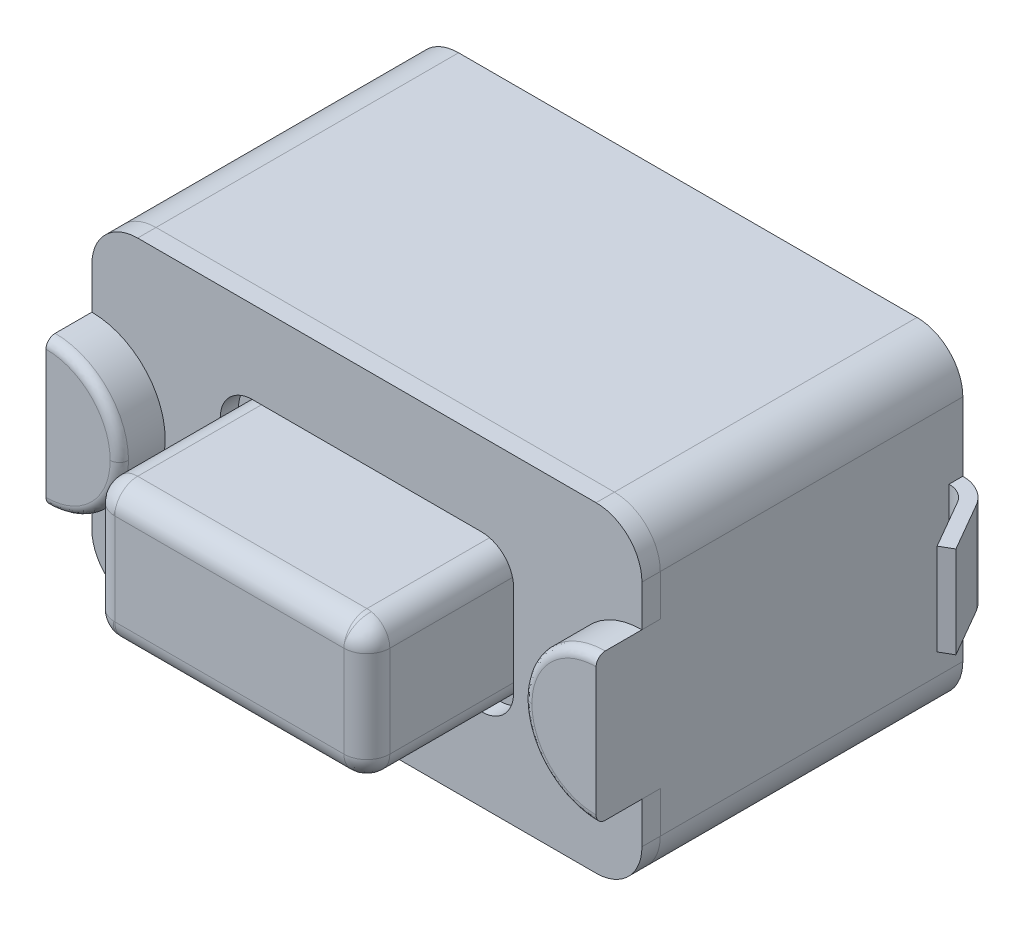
ISO-10303-21;
HEADER;
FILE_DESCRIPTION(('STEP AP214'),'2;1');
FILE_NAME('part.step','',(''),(''),'','','');
FILE_SCHEMA(('AUTOMOTIVE_DESIGN { 1 0 10303 214 1 1 1 1 }'));
ENDSEC;
DATA;
#1=APPLICATION_CONTEXT('core data for automotive mechanical design processes');
#2=APPLICATION_PROTOCOL_DEFINITION('international standard','automotive_design',2000,#1);
#3=PRODUCT_CONTEXT('',#1,'mechanical');
#4=PRODUCT('Part','Part','',(#3));
#5=PRODUCT_RELATED_PRODUCT_CATEGORY('part','',(#4));
#6=PRODUCT_DEFINITION_FORMATION('','',#4);
#7=PRODUCT_DEFINITION_CONTEXT('part definition',#1,'design');
#8=PRODUCT_DEFINITION('design','',#6,#7);
#9=PRODUCT_DEFINITION_SHAPE('','',#8);
#10=(LENGTH_UNIT() NAMED_UNIT(*) SI_UNIT(.MILLI.,.METRE.));
#11=(NAMED_UNIT(*) PLANE_ANGLE_UNIT() SI_UNIT($,.RADIAN.));
#12=(NAMED_UNIT(*) SI_UNIT($,.STERADIAN.) SOLID_ANGLE_UNIT());
#13=UNCERTAINTY_MEASURE_WITH_UNIT(LENGTH_MEASURE(1.E-05),#10,'distance_accuracy_value','');
#14=(GEOMETRIC_REPRESENTATION_CONTEXT(3) GLOBAL_UNCERTAINTY_ASSIGNED_CONTEXT((#13)) GLOBAL_UNIT_ASSIGNED_CONTEXT((#10,
#11,#12)) REPRESENTATION_CONTEXT('',''));
#15=CARTESIAN_POINT('',(0.,0.,0.));
#16=DIRECTION('',(0.,0.,1.));
#17=DIRECTION('',(1.,0.,0.));
#18=AXIS2_PLACEMENT_3D('',#15,#16,#17);
#19=CARTESIAN_POINT('',(-3.,0.,4.));
#20=DIRECTION('',(0.,0.,1.));
#21=DIRECTION('',(1.,0.,0.));
#22=AXIS2_PLACEMENT_3D('',#19,#20,#21);
#23=PLANE('',#22);
#24=DIRECTION('',(0.,-1.,0.));
#25=VECTOR('',#24,1.);
#26=CARTESIAN_POINT('',(-3.,0.,4.));
#27=LINE('',#26,#25);
#28=CARTESIAN_POINT('',(-3.,0.7,4.));
#29=VERTEX_POINT('',#28);
#30=CARTESIAN_POINT('',(-3.,-0.7,4.));
#31=VERTEX_POINT('',#30);
#32=EDGE_CURVE('P0_E1090',#29,#31,#27,.T.);
#33=ORIENTED_EDGE('',*,*,#32,.T.);
#34=CARTESIAN_POINT('',(-2.3,0.,4.));
#35=CARTESIAN_POINT('',(-2.3,-0.410050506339,4.));
#36=CARTESIAN_POINT('',(-2.589949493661,-0.7,4.));
#37=CARTESIAN_POINT('',(-3.,-0.7,4.));
#38=(BOUNDED_CURVE() B_SPLINE_CURVE(3,(#34,#35,#36,#37),.UNSPECIFIED.,.F.,
.F.) B_SPLINE_CURVE_WITH_KNOTS((4,4),(0.5,1.),
.UNSPECIFIED.) CURVE() GEOMETRIC_REPRESENTATION_ITEM() RATIONAL_B_SPLINE_CURVE((1.,
0.804737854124,0.804737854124,1.)) REPRESENTATION_ITEM(''));
#39=CARTESIAN_POINT('',(-2.3,0.,4.));
#40=VERTEX_POINT('',#39);
#41=EDGE_CURVE('P0_E11',#40,#31,#38,.T.);
#42=ORIENTED_EDGE('',*,*,#41,.F.);
#43=CARTESIAN_POINT('',(-3.,0.7,4.));
#44=CARTESIAN_POINT('',(-2.589949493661,0.7,4.));
#45=CARTESIAN_POINT('',(-2.3,0.410050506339,4.));
#46=CARTESIAN_POINT('',(-2.3,0.,4.));
#47=(BOUNDED_CURVE() B_SPLINE_CURVE(3,(#43,#44,#45,#46),.UNSPECIFIED.,.F.,
.F.) B_SPLINE_CURVE_WITH_KNOTS((4,4),(0.,0.5),
.UNSPECIFIED.) CURVE() GEOMETRIC_REPRESENTATION_ITEM() RATIONAL_B_SPLINE_CURVE((1.,
0.804737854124,0.804737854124,1.)) REPRESENTATION_ITEM(''));
#48=EDGE_CURVE('P0_E1100',#29,#40,#47,.T.);
#49=ORIENTED_EDGE('',*,*,#48,.F.);
#50=EDGE_LOOP('',(#33,#42,#49));
#51=FACE_BOUND('',#50,.T.);
#52=ADVANCED_FACE('P0_F18',(#51),#23,.T.);
#53=CARTESIAN_POINT('',(3.,0.,4.));
#54=DIRECTION('',(0.,0.,-1.));
#55=DIRECTION('',(0.,-1.,0.));
#56=AXIS2_PLACEMENT_3D('',#53,#54,#55);
#57=PLANE('',#56);
#58=CARTESIAN_POINT('',(3.,-0.7,4.));
#59=CARTESIAN_POINT('',(2.589949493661,-0.7,4.));
#60=CARTESIAN_POINT('',(2.3,-0.410050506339,4.));
#61=CARTESIAN_POINT('',(2.3,0.,4.));
#62=(BOUNDED_CURVE() B_SPLINE_CURVE(3,(#58,#59,#60,#61),.UNSPECIFIED.,.F.,
.F.) B_SPLINE_CURVE_WITH_KNOTS((4,4),(0.,0.5),
.UNSPECIFIED.) CURVE() GEOMETRIC_REPRESENTATION_ITEM() RATIONAL_B_SPLINE_CURVE((1.,
0.804737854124,0.804737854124,1.)) REPRESENTATION_ITEM(''));
#63=CARTESIAN_POINT('',(3.,-0.7,4.));
#64=VERTEX_POINT('',#63);
#65=CARTESIAN_POINT('',(2.3,0.,4.));
#66=VERTEX_POINT('',#65);
#67=EDGE_CURVE('P0_E29',#64,#66,#62,.T.);
#68=ORIENTED_EDGE('',*,*,#67,.F.);
#69=DIRECTION('',(0.,-1.,0.));
#70=VECTOR('',#69,1.);
#71=CARTESIAN_POINT('',(3.,0.,4.));
#72=LINE('',#71,#70);
#73=CARTESIAN_POINT('',(3.,0.7,4.));
#74=VERTEX_POINT('',#73);
#75=EDGE_CURVE('P0_E713',#74,#64,#72,.T.);
#76=ORIENTED_EDGE('',*,*,#75,.F.);
#77=CARTESIAN_POINT('',(2.3,0.,4.));
#78=CARTESIAN_POINT('',(2.3,0.410050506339,4.));
#79=CARTESIAN_POINT('',(2.589949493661,0.7,4.));
#80=CARTESIAN_POINT('',(3.,0.7,4.));
#81=(BOUNDED_CURVE() B_SPLINE_CURVE(3,(#77,#78,#79,#80),.UNSPECIFIED.,.F.,
.F.) B_SPLINE_CURVE_WITH_KNOTS((4,4),(0.5,1.),
.UNSPECIFIED.) CURVE() GEOMETRIC_REPRESENTATION_ITEM() RATIONAL_B_SPLINE_CURVE((1.,
0.804737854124,0.804737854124,1.)) REPRESENTATION_ITEM(''));
#82=EDGE_CURVE('P0_E420',#66,#74,#81,.T.);
#83=ORIENTED_EDGE('',*,*,#82,.F.);
#84=EDGE_LOOP('',(#68,#76,#83));
#85=FACE_BOUND('',#84,.T.);
#86=ADVANCED_FACE('P0_F581',(#85),#57,.F.);
#87=CARTESIAN_POINT('',(-1.248650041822,0.561760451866,4.992247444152));
#88=CARTESIAN_POINT('',(-1.255653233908,0.561882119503,4.992255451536));
#89=CARTESIAN_POINT('',(-1.256406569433,0.555107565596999,4.993867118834));
#90=CARTESIAN_POINT('',(-1.249540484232,0.553752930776,4.994152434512));
#91=CARTESIAN_POINT('',(-1.246230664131,0.703397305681,4.956123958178));
#92=CARTESIAN_POINT('',(-1.499498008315,0.707797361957,4.956413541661));
#93=CARTESIAN_POINT('',(-1.526742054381,0.462798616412,5.01469877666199));
#94=CARTESIAN_POINT('',(-1.278433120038,0.413808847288,5.025017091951));
#95=CARTESIAN_POINT('',(-1.245075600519,0.77815080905,4.830496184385));
#96=CARTESIAN_POINT('',(-1.669777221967,0.785529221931,4.83098178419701));
#97=CARTESIAN_POINT('',(-1.715462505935,0.374693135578,4.928719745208));
#98=CARTESIAN_POINT('',(-1.299075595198,0.29254265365,4.946022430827));
#99=CARTESIAN_POINT('',(-1.245859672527,0.742347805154,4.688759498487));
#100=CARTESIAN_POINT('',(-1.667008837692,0.749664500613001,4.689241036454));
#101=CARTESIAN_POINT('',(-1.712311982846,0.342264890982,4.786161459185));
#102=CARTESIAN_POINT('',(-1.299407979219,0.260801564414,4.803319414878));
#103=(BOUNDED_SURFACE() B_SPLINE_SURFACE(3,3,((#87,#88,#89,#90),(#91,#92,#93,#94),(#95,#96,#97,
#98),(#99,#100,#101,#102)),.UNSPECIFIED.,.F.,.F.,.F.) B_SPLINE_SURFACE_WITH_KNOTS((4,4),(4,4),
(0.,1.),(0.,1.),.UNSPECIFIED.) GEOMETRIC_REPRESENTATION_ITEM() RATIONAL_B_SPLINE_SURFACE(((1.,
0.393999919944,0.393999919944,1.),(0.805257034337,0.317271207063,0.317271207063,0.805257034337),
(0.805257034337,0.317271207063,0.317271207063,0.805257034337),(1.,0.393999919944,0.393999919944,1.))) REPRESENTATION_ITEM('') SURFACE());
#104=CARTESIAN_POINT('',(-1.25,0.5,4.75));
#105=DIRECTION('',(0.98027366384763,-0.193401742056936,0.0407346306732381));
#106=DIRECTION('',(0.00512391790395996,0.230898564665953,0.972964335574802));
#107=AXIS2_PLACEMENT_3D('',#104,#105,#106);
#108=CIRCLE('',#107,0.25);
#109=CARTESIAN_POINT('',(-1.25,0.551524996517,4.994632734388));
#110=VERTEX_POINT('',#109);
#111=CARTESIAN_POINT('',(-1.260379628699,0.5,4.999784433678));
#112=VERTEX_POINT('',#111);
#113=EDGE_CURVE('P0_E386',#110,#112,#108,.T.);
#114=CARTESIAN_POINT('',(-1.25,0.5,4.75));
#115=DIRECTION('',(1.,0.,0.));
#116=DIRECTION('',(0.,-1.,0.));
#117=AXIS2_PLACEMENT_3D('',#114,#115,#116);
#118=CIRCLE('',#117,0.25);
#119=CARTESIAN_POINT('',(-1.25,0.75,4.75));
#120=VERTEX_POINT('',#119);
#121=EDGE_CURVE('P0_E512',#120,#110,#118,.T.);
#122=CARTESIAN_POINT('',(-1.25,0.5,4.75));
#123=DIRECTION('',(0.,0.,-1.));
#124=DIRECTION('',(1.,0.,0.));
#125=AXIS2_PLACEMENT_3D('',#122,#123,#124);
#126=CIRCLE('',#125,0.25);
#127=CARTESIAN_POINT('',(-1.5,0.5,4.75));
#128=VERTEX_POINT('',#127);
#129=EDGE_CURVE('P0_E454',#128,#120,#126,.T.);
#130=CARTESIAN_POINT('',(-1.25,0.5,4.75));
#131=DIRECTION('',(0.,-1.,0.));
#132=DIRECTION('',(0.,0.,-1.));
#133=AXIS2_PLACEMENT_3D('',#130,#131,#132);
#134=CIRCLE('',#133,0.25);
#135=EDGE_CURVE('P0_E466',#112,#128,#134,.T.);
#136=ORIENTED_EDGE('',*,*,#113,.F.);
#137=ORIENTED_EDGE('',*,*,#121,.F.);
#138=ORIENTED_EDGE('',*,*,#129,.F.);
#139=ORIENTED_EDGE('',*,*,#135,.F.);
#140=EDGE_LOOP('',(#136,#137,#138,#139));
#141=FACE_BOUND('',#140,.T.);
#142=ADVANCED_FACE('P0_F575',(#141),#103,.T.);
#143=CARTESIAN_POINT('',(1.251280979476,0.557724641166,4.993241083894));
#144=CARTESIAN_POINT('',(1.251280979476,0.557724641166,4.993241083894));
#145=CARTESIAN_POINT('',(1.251280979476,0.557724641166,4.993241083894));
#146=CARTESIAN_POINT('',(1.251280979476,0.557724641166,4.993241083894));
#147=CARTESIAN_POINT('',(1.222248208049,0.417605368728,5.026646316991));
#148=CARTESIAN_POINT('',(1.510336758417,0.360767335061,5.038617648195));
#149=CARTESIAN_POINT('',(1.568402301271,0.641005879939,4.971807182));
#150=CARTESIAN_POINT('',(1.280313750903,0.697843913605,4.959835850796));
#151=CARTESIAN_POINT('',(1.201229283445,0.294695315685,4.94890607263));
#152=CARTESIAN_POINT('',(1.692591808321,0.197752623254,4.969324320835));
#153=CARTESIAN_POINT('',(1.791628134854,0.675726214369,4.855372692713));
#154=CARTESIAN_POINT('',(1.300265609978,0.7726689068,4.834954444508));
#155=CARTESIAN_POINT('',(1.200600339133,0.261365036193,4.805794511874));
#156=CARTESIAN_POINT('',(1.690732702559,0.164665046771,4.826161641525));
#157=CARTESIAN_POINT('',(1.78952108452,0.641441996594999,4.71249529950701));
#158=CARTESIAN_POINT('',(1.299388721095,0.738141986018,4.692128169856));
#159=(BOUNDED_SURFACE() B_SPLINE_SURFACE(3,3,((#143,#144,#145,#146),(#147,#148,#149,#150),(#151,
#152,#153,#154),(#155,#156,#157,#158)),.UNSPECIFIED.,.F.,.F.,
.F.) B_SPLINE_SURFACE_WITH_KNOTS((4,4),(4,4),(0.,1.),(0.,1.),
.UNSPECIFIED.) GEOMETRIC_REPRESENTATION_ITEM() RATIONAL_B_SPLINE_SURFACE(((1.,0.333333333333,
0.333333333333,1.),(0.803730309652,0.267910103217,0.267910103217,0.803730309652),
(0.803730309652,0.267910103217,0.267910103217,0.803730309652),(1.,0.333333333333,0.333333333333,1.))) REPRESENTATION_ITEM('') SURFACE());
#160=CARTESIAN_POINT('',(1.25,0.5,4.75));
#161=DIRECTION('',(-0.98027366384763,0.193401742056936,-0.0407346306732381));
#162=DIRECTION('',(0.00512391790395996,0.230898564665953,0.972964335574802));
#163=AXIS2_PLACEMENT_3D('',#160,#161,#162);
#164=CIRCLE('',#163,0.25);
#165=CARTESIAN_POINT('',(1.251280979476,0.557724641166,4.993241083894));
#166=VERTEX_POINT('',#165);
#167=CARTESIAN_POINT('',(1.298390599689,0.745271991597,4.75));
#168=VERTEX_POINT('',#167);
#169=EDGE_CURVE('P0_E371',#166,#168,#164,.T.);
#170=CARTESIAN_POINT('',(1.25,0.5,4.75));
#171=DIRECTION('',(0.98027366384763,-0.193401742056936,0.0407346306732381));
#172=DIRECTION('',(0.00512391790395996,0.230898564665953,0.972964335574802));
#173=AXIS2_PLACEMENT_3D('',#170,#171,#172);
#174=CIRCLE('',#173,0.25);
#175=CARTESIAN_POINT('',(1.25,0.551524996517,4.994632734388));
#176=VERTEX_POINT('',#175);
#177=EDGE_CURVE('P0_E367',#166,#176,#174,.T.);
#178=CARTESIAN_POINT('',(1.25,0.5,4.75));
#179=DIRECTION('',(-1.,0.,0.));
#180=DIRECTION('',(0.,-1.,0.));
#181=AXIS2_PLACEMENT_3D('',#178,#179,#180);
#182=CIRCLE('',#181,0.25);
#183=CARTESIAN_POINT('',(1.25,0.5,5.));
#184=VERTEX_POINT('',#183);
#185=EDGE_CURVE('P0_E516',#184,#176,#182,.T.);
#186=CARTESIAN_POINT('',(1.25,0.5,4.75));
#187=DIRECTION('',(0.,-1.,0.));
#188=DIRECTION('',(0.,0.,1.));
#189=AXIS2_PLACEMENT_3D('',#186,#187,#188);
#190=CIRCLE('',#189,0.25);
#191=CARTESIAN_POINT('',(1.5,0.5,4.75));
#192=VERTEX_POINT('',#191);
#193=EDGE_CURVE('P0_E858',#192,#184,#190,.T.);
#194=CARTESIAN_POINT('',(1.25,0.5,4.75));
#195=DIRECTION('',(0.,0.,-1.));
#196=DIRECTION('',(1.,0.,0.));
#197=AXIS2_PLACEMENT_3D('',#194,#195,#196);
#198=CIRCLE('',#197,0.25);
#199=EDGE_CURVE('P0_E401',#168,#192,#198,.T.);
#200=ORIENTED_EDGE('',*,*,#169,.F.);
#201=ORIENTED_EDGE('',*,*,#177,.T.);
#202=ORIENTED_EDGE('',*,*,#185,.F.);
#203=ORIENTED_EDGE('',*,*,#193,.F.);
#204=ORIENTED_EDGE('',*,*,#199,.F.);
#205=EDGE_LOOP('',(#200,#201,#202,#203,#204));
#206=FACE_BOUND('',#205,.T.);
#207=ADVANCED_FACE('P0_F580',(#206),#159,.T.);
#208=CARTESIAN_POINT('',(1.249546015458,-0.49689169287,4.999980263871));
#209=CARTESIAN_POINT('',(1.282629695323,-0.497933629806,5.000053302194));
#210=CARTESIAN_POINT('',(1.30628600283,-0.47543587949,4.994589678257));
#211=CARTESIAN_POINT('',(1.305969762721,-0.443231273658,4.986948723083));
#212=CARTESIAN_POINT('',(1.244852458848,-0.645792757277,5.001823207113));
#213=CARTESIAN_POINT('',(1.365823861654,-0.649602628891,5.002090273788));
#214=CARTESIAN_POINT('',(1.452323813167,-0.567338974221,4.98211237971));
#215=CARTESIAN_POINT('',(1.451167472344,-0.449581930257,4.954173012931));
#216=CARTESIAN_POINT('',(1.241763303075,-0.751253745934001,4.896631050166));
#217=CARTESIAN_POINT('',(1.410108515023,-0.756555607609,4.89700270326));
#218=CARTESIAN_POINT('',(1.53048285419,-0.642076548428,4.869201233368));
#219=CARTESIAN_POINT('',(1.528873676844,-0.478204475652,4.830320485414));
#220=CARTESIAN_POINT('',(1.242135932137,-0.74986524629,4.747651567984));
#221=CARTESIAN_POINT('',(1.388857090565,-0.754486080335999,4.747975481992));
#222=CARTESIAN_POINT('',(1.493769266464,-0.65471193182,4.723745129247));
#223=CARTESIAN_POINT('',(1.492366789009,-0.511889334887,4.689858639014));
#224=(BOUNDED_SURFACE() B_SPLINE_SURFACE(3,3,((#208,#209,#210,#211),(#212,#213,#214,#215),(#216,
#217,#218,#219),(#220,#221,#222,#223)),.UNSPECIFIED.,.F.,.F.,
.F.) B_SPLINE_SURFACE_WITH_KNOTS((4,4),(4,4),(0.,1.),(0.,1.),
.UNSPECIFIED.) GEOMETRIC_REPRESENTATION_ITEM() RATIONAL_B_SPLINE_SURFACE(((1.,0.795048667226,
0.795048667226,1.),(0.799580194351,0.635705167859,0.635705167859,0.799580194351),
(0.799580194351,0.635705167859,0.635705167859,0.799580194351),(1.,0.795048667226,0.795048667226,1.))) REPRESENTATION_ITEM('') SURFACE());
#225=CARTESIAN_POINT('',(1.25,-0.5,4.75));
#226=DIRECTION('',(0.,0.,-1.));
#227=DIRECTION('',(1.,0.,0.));
#228=AXIS2_PLACEMENT_3D('',#225,#226,#227);
#229=CIRCLE('',#228,0.25);
#230=CARTESIAN_POINT('',(1.5,-0.5,4.75));
#231=VERTEX_POINT('',#230);
#232=CARTESIAN_POINT('',(1.25,-0.75,4.75));
#233=VERTEX_POINT('',#232);
#234=EDGE_CURVE('P0_E864',#231,#233,#229,.T.);
#235=CARTESIAN_POINT('',(1.25,-0.5,4.75));
#236=DIRECTION('',(0.,1.,0.));
#237=DIRECTION('',(0.,0.,1.));
#238=AXIS2_PLACEMENT_3D('',#235,#236,#237);
#239=CIRCLE('',#238,0.25);
#240=CARTESIAN_POINT('',(1.25,-0.5,5.));
#241=VERTEX_POINT('',#240);
#242=EDGE_CURVE('P0_E398',#241,#231,#239,.T.);
#243=CARTESIAN_POINT('',(1.25,-0.5,4.75));
#244=DIRECTION('',(-1.,0.,0.));
#245=DIRECTION('',(0.,1.,0.));
#246=AXIS2_PLACEMENT_3D('',#243,#244,#245);
#247=CIRCLE('',#246,0.25);
#248=EDGE_CURVE('P0_E506',#233,#241,#247,.T.);
#249=ORIENTED_EDGE('',*,*,#234,.F.);
#250=ORIENTED_EDGE('',*,*,#242,.F.);
#251=ORIENTED_EDGE('',*,*,#248,.F.);
#252=EDGE_LOOP('',(#249,#250,#251));
#253=FACE_BOUND('',#252,.T.);
#254=ADVANCED_FACE('P0_F785',(#253),#224,.T.);
#255=CARTESIAN_POINT('',(-1.5,-0.75,5.));
#256=DIRECTION('',(0.,0.,1.));
#257=DIRECTION('',(1.,0.,0.));
#258=AXIS2_PLACEMENT_3D('',#255,#256,#257);
#259=PLANE('',#258);
#260=DIRECTION('',(0.,1.,0.));
#261=VECTOR('',#260,1.);
#262=CARTESIAN_POINT('',(-1.25,-0.75,5.));
#263=LINE('',#262,#261);
#264=CARTESIAN_POINT('',(-1.25,-0.5,5.));
#265=VERTEX_POINT('',#264);
#266=CARTESIAN_POINT('',(-1.25,0.5,5.));
#267=VERTEX_POINT('',#266);
#268=EDGE_CURVE('P0_E422',#265,#267,#263,.T.);
#269=ORIENTED_EDGE('',*,*,#268,.F.);
#270=DIRECTION('',(-1.,0.,0.));
#271=VECTOR('',#270,1.);
#272=CARTESIAN_POINT('',(-1.5,-0.5,5.));
#273=LINE('',#272,#271);
#274=EDGE_CURVE('P0_E510',#241,#265,#273,.T.);
#275=ORIENTED_EDGE('',*,*,#274,.F.);
#276=DIRECTION('',(0.,-1.,0.));
#277=VECTOR('',#276,1.);
#278=CARTESIAN_POINT('',(1.25,-0.75,5.));
#279=LINE('',#278,#277);
#280=EDGE_CURVE('P0_E402',#184,#241,#279,.T.);
#281=ORIENTED_EDGE('',*,*,#280,.F.);
#282=DIRECTION('',(1.,0.,0.));
#283=VECTOR('',#282,1.);
#284=CARTESIAN_POINT('',(-1.5,0.5,5.));
#285=LINE('',#284,#283);
#286=EDGE_CURVE('P0_E43',#267,#184,#285,.T.);
#287=ORIENTED_EDGE('',*,*,#286,.F.);
#288=EDGE_LOOP('',(#269,#275,#281,#287));
#289=FACE_BOUND('',#288,.T.);
#290=ADVANCED_FACE('P0_F756',(#289),#259,.T.);
#291=CARTESIAN_POINT('',(-1.305304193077,-0.443251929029,4.987109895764));
#292=CARTESIAN_POINT('',(-1.305537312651,-0.470806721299,4.993650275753));
#293=CARTESIAN_POINT('',(-1.28768885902,-0.492222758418,4.998638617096));
#294=CARTESIAN_POINT('',(-1.259926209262,-0.497700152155,4.99979227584));
#295=CARTESIAN_POINT('',(-1.449333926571,-0.449644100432,4.955045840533));
#296=CARTESIAN_POINT('',(-1.450160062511,-0.547293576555,4.978223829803));
#297=CARTESIAN_POINT('',(-1.386908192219,-0.623188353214,4.995901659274));
#298=CARTESIAN_POINT('',(-1.288522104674,-0.642599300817,4.999990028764));
#299=CARTESIAN_POINT('',(-1.527404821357,-0.477972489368,4.832914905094));
#300=CARTESIAN_POINT('',(-1.528550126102,-0.613347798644,4.865047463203));
#301=CARTESIAN_POINT('',(-1.440861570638,-0.718563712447,4.889554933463));
#302=CARTESIAN_POINT('',(-1.304465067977,-0.745473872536,4.895222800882));
#303=CARTESIAN_POINT('',(-1.493190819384,-0.511427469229,4.69318769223));
#304=CARTESIAN_POINT('',(-1.494192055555,-0.629773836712,4.721278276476));
#305=CARTESIAN_POINT('',(-1.417533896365,-0.721754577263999,4.742702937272));
#306=CARTESIAN_POINT('',(-1.29829479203,-0.745279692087,4.74765784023));
#307=(BOUNDED_SURFACE() B_SPLINE_SURFACE(3,3,((#291,#292,#293,#294),(#295,#296,#297,#298),(#299,
#300,#301,#302),(#303,#304,#305,#306)),.UNSPECIFIED.,.F.,.F.,
.F.) B_SPLINE_SURFACE_WITH_KNOTS((4,4),(4,4),(0.,1.),(0.,1.),
.UNSPECIFIED.) GEOMETRIC_REPRESENTATION_ITEM() RATIONAL_B_SPLINE_SURFACE(((1.,0.847468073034,
0.847468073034,1.),(0.802205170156,0.67984326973,0.67984326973,0.802205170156),(0.802205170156,
0.67984326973,0.67984326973,0.802205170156),(1.,0.847468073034,0.847468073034,1.))) REPRESENTATION_ITEM('') SURFACE());
#308=CARTESIAN_POINT('',(-1.25,-0.5,4.75));
#309=DIRECTION('',(0.98027366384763,-0.193401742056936,0.0407346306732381));
#310=DIRECTION('',(0.00512391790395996,0.230898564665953,0.972964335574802));
#311=AXIS2_PLACEMENT_3D('',#308,#309,#310);
#312=CIRCLE('',#311,0.25);
#313=CARTESIAN_POINT('',(-1.260379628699,-0.5,4.999784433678));
#314=VERTEX_POINT('',#313);
#315=CARTESIAN_POINT('',(-1.298390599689,-0.745271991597,4.75));
#316=VERTEX_POINT('',#315);
#317=EDGE_CURVE('P0_E918',#314,#316,#312,.T.);
#318=CARTESIAN_POINT('',(-1.25,-0.5,4.75));
#319=DIRECTION('',(0.,1.,0.));
#320=DIRECTION('',(0.,0.,-1.));
#321=AXIS2_PLACEMENT_3D('',#318,#319,#320);
#322=CIRCLE('',#321,0.25);
#323=CARTESIAN_POINT('',(-1.5,-0.5,4.75));
#324=VERTEX_POINT('',#323);
#325=EDGE_CURVE('P0_E425',#324,#314,#322,.T.);
#326=CARTESIAN_POINT('',(-1.25,-0.5,4.75));
#327=DIRECTION('',(0.,0.,-1.));
#328=DIRECTION('',(1.,0.,0.));
#329=AXIS2_PLACEMENT_3D('',#326,#327,#328);
#330=CIRCLE('',#329,0.25);
#331=EDGE_CURVE('P0_E511',#316,#324,#330,.T.);
#332=ORIENTED_EDGE('',*,*,#317,.F.);
#333=ORIENTED_EDGE('',*,*,#325,.F.);
#334=ORIENTED_EDGE('',*,*,#331,.F.);
#335=EDGE_LOOP('',(#332,#333,#334));
#336=FACE_BOUND('',#335,.T.);
#337=ADVANCED_FACE('P0_F744',(#336),#307,.T.);
#338=CARTESIAN_POINT('',(-3.,-0.7,4.));
#339=CARTESIAN_POINT('',(-2.589949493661,-0.7,4.));
#340=CARTESIAN_POINT('',(-2.3,-0.410050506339,4.));
#341=CARTESIAN_POINT('',(-2.3,0.,4.));
#342=CARTESIAN_POINT('',(-3.,-0.758578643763,4.));
#343=CARTESIAN_POINT('',(-2.55563491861,-0.758578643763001,4.));
#344=CARTESIAN_POINT('',(-2.241421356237,-0.44436508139,4.));
#345=CARTESIAN_POINT('',(-2.241421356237,0.,4.));
#346=CARTESIAN_POINT('',(-3.,-0.8,3.958578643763));
#347=CARTESIAN_POINT('',(-2.531370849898,-0.8,3.958578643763));
#348=CARTESIAN_POINT('',(-2.2,-0.468629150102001,3.958578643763));
#349=CARTESIAN_POINT('',(-2.2,0.,3.958578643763));
#350=CARTESIAN_POINT('',(-3.,-0.8,3.9));
#351=CARTESIAN_POINT('',(-2.531370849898,-0.8,3.9));
#352=CARTESIAN_POINT('',(-2.2,-0.468629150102,3.9));
#353=CARTESIAN_POINT('',(-2.2,0.,3.9));
#354=(BOUNDED_SURFACE() B_SPLINE_SURFACE(3,3,((#338,#339,#340,#341),(#342,#343,#344,#345),(#346,
#347,#348,#349),(#350,#351,#352,#353)),.UNSPECIFIED.,.F.,.F.,
.F.) B_SPLINE_SURFACE_WITH_KNOTS((4,4),(4,4),(0.,1.),(0.,1.),
.UNSPECIFIED.) GEOMETRIC_REPRESENTATION_ITEM() RATIONAL_B_SPLINE_SURFACE(((1.,0.804737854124,
0.804737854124,1.),(0.804737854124,0.647603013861,0.647603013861,0.804737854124),
(0.804737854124,0.647603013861,0.647603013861,0.804737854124),(1.,0.804737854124,0.804737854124,1.))) REPRESENTATION_ITEM('') SURFACE());
#355=CARTESIAN_POINT('',(-2.3,0.,3.9));
#356=DIRECTION('',(0.,1.,0.));
#357=DIRECTION('',(1.,0.,0.));
#358=AXIS2_PLACEMENT_3D('',#355,#356,#357);
#359=CIRCLE('',#358,0.1);
#360=CARTESIAN_POINT('',(-2.2,0.,3.9));
#361=VERTEX_POINT('',#360);
#362=EDGE_CURVE('P0_E1095',#40,#361,#359,.T.);
#363=CARTESIAN_POINT('',(-3.,-0.7,4.));
#364=CARTESIAN_POINT('',(-3.,-0.758578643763,4.));
#365=CARTESIAN_POINT('',(-3.,-0.8,3.958578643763));
#366=CARTESIAN_POINT('',(-3.,-0.8,3.9));
#367=(BOUNDED_CURVE() B_SPLINE_CURVE(3,(#363,#364,#365,#366),.UNSPECIFIED.,.F.,
.F.) B_SPLINE_CURVE_WITH_KNOTS((4,4),(0.,1.),
.UNSPECIFIED.) CURVE() GEOMETRIC_REPRESENTATION_ITEM() RATIONAL_B_SPLINE_CURVE((1.,
0.804737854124,0.804737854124,1.)) REPRESENTATION_ITEM(''));
#368=CARTESIAN_POINT('',(-3.,-0.8,3.9));
#369=VERTEX_POINT('',#368);
#370=EDGE_CURVE('P0_E726',#31,#369,#367,.T.);
#371=CARTESIAN_POINT('',(-3.,0.,3.9));
#372=DIRECTION('',(0.,0.,-1.));
#373=DIRECTION('',(-1.,0.,0.));
#374=AXIS2_PLACEMENT_3D('',#371,#372,#373);
#375=CIRCLE('',#374,0.8);
#376=EDGE_CURVE('P0_E719',#361,#369,#375,.T.);
#377=ORIENTED_EDGE('',*,*,#362,.F.);
#378=ORIENTED_EDGE('',*,*,#41,.T.);
#379=ORIENTED_EDGE('',*,*,#370,.T.);
#380=ORIENTED_EDGE('',*,*,#376,.F.);
#381=EDGE_LOOP('',(#377,#378,#379,#380));
#382=FACE_BOUND('',#381,.T.);
#383=ADVANCED_FACE('P0_F552',(#382),#354,.T.);
#384=CARTESIAN_POINT('',(3.,-0.8,3.9));
#385=CARTESIAN_POINT('',(2.531370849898,-0.8,3.9));
#386=CARTESIAN_POINT('',(2.2,-0.468629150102,3.9));
#387=CARTESIAN_POINT('',(2.2,0.,3.9));
#388=CARTESIAN_POINT('',(3.,-0.8,3.958578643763));
#389=CARTESIAN_POINT('',(2.531370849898,-0.8,3.958578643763));
#390=CARTESIAN_POINT('',(2.2,-0.468629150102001,3.958578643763));
#391=CARTESIAN_POINT('',(2.2,0.,3.958578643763));
#392=CARTESIAN_POINT('',(3.,-0.758578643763,4.));
#393=CARTESIAN_POINT('',(2.55563491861,-0.758578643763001,4.));
#394=CARTESIAN_POINT('',(2.241421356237,-0.44436508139,4.));
#395=CARTESIAN_POINT('',(2.241421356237,0.,4.));
#396=CARTESIAN_POINT('',(3.,-0.7,4.));
#397=CARTESIAN_POINT('',(2.589949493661,-0.7,4.));
#398=CARTESIAN_POINT('',(2.3,-0.410050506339,4.));
#399=CARTESIAN_POINT('',(2.3,0.,4.));
#400=(BOUNDED_SURFACE() B_SPLINE_SURFACE(3,3,((#384,#385,#386,#387),(#388,#389,#390,#391),(#392,
#393,#394,#395),(#396,#397,#398,#399)),.UNSPECIFIED.,.F.,.F.,
.F.) B_SPLINE_SURFACE_WITH_KNOTS((4,4),(4,4),(0.,1.),(0.,1.),
.UNSPECIFIED.) GEOMETRIC_REPRESENTATION_ITEM() RATIONAL_B_SPLINE_SURFACE(((1.,0.804737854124,
0.804737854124,1.),(0.804737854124,0.647603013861,0.647603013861,0.804737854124),
(0.804737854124,0.647603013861,0.647603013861,0.804737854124),(1.,0.804737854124,0.804737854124,1.))) REPRESENTATION_ITEM('') SURFACE());
#401=CARTESIAN_POINT('',(2.3,0.,3.9));
#402=DIRECTION('',(0.,1.,0.));
#403=DIRECTION('',(-1.,0.,0.));
#404=AXIS2_PLACEMENT_3D('',#401,#402,#403);
#405=CIRCLE('',#404,0.1);
#406=CARTESIAN_POINT('',(2.2,0.,3.9));
#407=VERTEX_POINT('',#406);
#408=EDGE_CURVE('P0_E416',#407,#66,#405,.T.);
#409=CARTESIAN_POINT('',(3.,0.,3.9));
#410=DIRECTION('',(0.,0.,-1.));
#411=DIRECTION('',(-1.,0.,0.));
#412=AXIS2_PLACEMENT_3D('',#409,#410,#411);
#413=CIRCLE('',#412,0.8);
#414=CARTESIAN_POINT('',(3.,-0.8,3.9));
#415=VERTEX_POINT('',#414);
#416=EDGE_CURVE('P0_E700',#415,#407,#413,.T.);
#417=CARTESIAN_POINT('',(3.,-0.8,3.9));
#418=CARTESIAN_POINT('',(3.,-0.8,3.958578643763));
#419=CARTESIAN_POINT('',(3.,-0.758578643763,4.));
#420=CARTESIAN_POINT('',(3.,-0.7,4.));
#421=(BOUNDED_CURVE() B_SPLINE_CURVE(3,(#417,#418,#419,#420),.UNSPECIFIED.,.F.,
.F.) B_SPLINE_CURVE_WITH_KNOTS((4,4),(0.,1.),
.UNSPECIFIED.) CURVE() GEOMETRIC_REPRESENTATION_ITEM() RATIONAL_B_SPLINE_CURVE((1.,
0.804737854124,0.804737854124,1.)) REPRESENTATION_ITEM(''));
#422=EDGE_CURVE('P0_E532',#415,#64,#421,.T.);
#423=ORIENTED_EDGE('',*,*,#408,.F.);
#424=ORIENTED_EDGE('',*,*,#416,.F.);
#425=ORIENTED_EDGE('',*,*,#422,.T.);
#426=ORIENTED_EDGE('',*,*,#67,.T.);
#427=EDGE_LOOP('',(#423,#424,#425,#426));
#428=FACE_BOUND('',#427,.T.);
#429=ADVANCED_FACE('P0_F539',(#428),#400,.T.);
#430=CARTESIAN_POINT('',(-1.25,-0.75,4.75));
#431=DIRECTION('',(0.,-1.,0.));
#432=DIRECTION('',(0.,0.,-1.));
#433=AXIS2_PLACEMENT_3D('',#430,#431,#432);
#434=CYLINDRICAL_SURFACE('',#433,0.25);
#435=CARTESIAN_POINT('',(-1.25,0.5,4.75));
#436=DIRECTION('',(0.,-1.,0.));
#437=DIRECTION('',(0.,0.,-1.));
#438=AXIS2_PLACEMENT_3D('',#435,#436,#437);
#439=CIRCLE('',#438,0.25);
#440=EDGE_CURVE('P0_E390',#267,#112,#439,.T.);
#441=ORIENTED_EDGE('',*,*,#440,.T.);
#442=ORIENTED_EDGE('',*,*,#135,.T.);
#443=DIRECTION('',(0.,1.,0.));
#444=VECTOR('',#443,1.);
#445=CARTESIAN_POINT('',(-1.5,0.75,4.75));
#446=LINE('',#445,#444);
#447=EDGE_CURVE('P0_E361',#324,#128,#446,.T.);
#448=ORIENTED_EDGE('',*,*,#447,.F.);
#449=ORIENTED_EDGE('',*,*,#325,.T.);
#450=CARTESIAN_POINT('',(-1.25,-0.5,4.75));
#451=DIRECTION('',(0.,1.,0.));
#452=DIRECTION('',(0.,0.,-1.));
#453=AXIS2_PLACEMENT_3D('',#450,#451,#452);
#454=CIRCLE('',#453,0.25);
#455=EDGE_CURVE('P0_E1022',#314,#265,#454,.T.);
#456=ORIENTED_EDGE('',*,*,#455,.T.);
#457=ORIENTED_EDGE('',*,*,#268,.T.);
#458=EDGE_LOOP('',(#441,#442,#448,#449,#456,#457));
#459=FACE_BOUND('',#458,.T.);
#460=ADVANCED_FACE('P0_F551',(#459),#434,.T.);
#461=CARTESIAN_POINT('',(-1.5,0.5,4.75));
#462=DIRECTION('',(-1.,0.,0.));
#463=DIRECTION('',(0.,-1.,0.));
#464=AXIS2_PLACEMENT_3D('',#461,#462,#463);
#465=CYLINDRICAL_SURFACE('',#464,0.25);
#466=ORIENTED_EDGE('',*,*,#185,.T.);
#467=CARTESIAN_POINT('',(1.25,0.5,4.75));
#468=DIRECTION('',(-1.,0.,0.));
#469=DIRECTION('',(0.,-1.,0.));
#470=AXIS2_PLACEMENT_3D('',#467,#468,#469);
#471=CIRCLE('',#470,0.25);
#472=CARTESIAN_POINT('',(1.25,0.75,4.75));
#473=VERTEX_POINT('',#472);
#474=EDGE_CURVE('P0_E359',#176,#473,#471,.T.);
#475=ORIENTED_EDGE('',*,*,#474,.T.);
#476=DIRECTION('',(1.,0.,0.));
#477=VECTOR('',#476,1.);
#478=CARTESIAN_POINT('',(1.5,0.75,4.75));
#479=LINE('',#478,#477);
#480=EDGE_CURVE('P0_E403',#120,#473,#479,.T.);
#481=ORIENTED_EDGE('',*,*,#480,.F.);
#482=ORIENTED_EDGE('',*,*,#121,.T.);
#483=CARTESIAN_POINT('',(-1.25,0.5,4.75));
#484=DIRECTION('',(1.,0.,0.));
#485=DIRECTION('',(0.,-1.,0.));
#486=AXIS2_PLACEMENT_3D('',#483,#484,#485);
#487=CIRCLE('',#486,0.25);
#488=EDGE_CURVE('P0_E391',#110,#267,#487,.T.);
#489=ORIENTED_EDGE('',*,*,#488,.T.);
#490=ORIENTED_EDGE('',*,*,#286,.T.);
#491=EDGE_LOOP('',(#466,#475,#481,#482,#489,#490));
#492=FACE_BOUND('',#491,.T.);
#493=ADVANCED_FACE('P0_F798',(#492),#465,.T.);
#494=CARTESIAN_POINT('',(-1.25,0.5,-3.55865643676));
#495=DIRECTION('',(0.,0.,1.));
#496=DIRECTION('',(1.,0.,0.));
#497=AXIS2_PLACEMENT_3D('',#494,#495,#496);
#498=CYLINDRICAL_SURFACE('',#497,0.25);
#499=ORIENTED_EDGE('',*,*,#129,.T.);
#500=DIRECTION('',(0.,0.,1.));
#501=VECTOR('',#500,1.);
#502=CARTESIAN_POINT('',(-1.25,0.75,-3.55865643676));
#503=LINE('',#502,#501);
#504=CARTESIAN_POINT('',(-1.25,0.75,3.3));
#505=VERTEX_POINT('',#504);
#506=EDGE_CURVE('P0_E408',#505,#120,#503,.T.);
#507=ORIENTED_EDGE('',*,*,#506,.F.);
#508=CARTESIAN_POINT('',(-1.25,0.5,3.3));
#509=DIRECTION('',(0.,0.,1.));
#510=DIRECTION('',(1.,0.,0.));
#511=AXIS2_PLACEMENT_3D('',#508,#509,#510);
#512=CIRCLE('',#511,0.25);
#513=CARTESIAN_POINT('',(-1.5,0.5,3.3));
#514=VERTEX_POINT('',#513);
#515=EDGE_CURVE('P0_E490',#505,#514,#512,.T.);
#516=ORIENTED_EDGE('',*,*,#515,.T.);
#517=DIRECTION('',(0.,0.,-1.));
#518=VECTOR('',#517,1.);
#519=CARTESIAN_POINT('',(-1.5,0.5,-3.55865643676));
#520=LINE('',#519,#518);
#521=EDGE_CURVE('P0_E365',#128,#514,#520,.T.);
#522=ORIENTED_EDGE('',*,*,#521,.F.);
#523=EDGE_LOOP('',(#499,#507,#516,#522));
#524=FACE_BOUND('',#523,.T.);
#525=ADVANCED_FACE('P0_F620',(#524),#498,.T.);
#526=CARTESIAN_POINT('',(1.25,0.5,-3.55865643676));
#527=DIRECTION('',(0.,0.,1.));
#528=DIRECTION('',(1.,0.,0.));
#529=AXIS2_PLACEMENT_3D('',#526,#527,#528);
#530=CYLINDRICAL_SURFACE('',#529,0.25);
#531=CARTESIAN_POINT('',(1.25,0.5,4.75));
#532=DIRECTION('',(0.,0.,-1.));
#533=DIRECTION('',(1.,0.,0.));
#534=AXIS2_PLACEMENT_3D('',#531,#532,#533);
#535=CIRCLE('',#534,0.25);
#536=EDGE_CURVE('P0_E381',#473,#168,#535,.T.);
#537=ORIENTED_EDGE('',*,*,#536,.T.);
#538=ORIENTED_EDGE('',*,*,#199,.T.);
#539=DIRECTION('',(0.,0.,1.));
#540=VECTOR('',#539,1.);
#541=CARTESIAN_POINT('',(1.5,0.5,-3.55865643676));
#542=LINE('',#541,#540);
#543=CARTESIAN_POINT('',(1.5,0.5,3.3));
#544=VERTEX_POINT('',#543);
#545=EDGE_CURVE('P0_E376',#544,#192,#542,.T.);
#546=ORIENTED_EDGE('',*,*,#545,.F.);
#547=CARTESIAN_POINT('',(1.25,0.5,3.3));
#548=DIRECTION('',(0.,0.,1.));
#549=DIRECTION('',(1.,0.,0.));
#550=AXIS2_PLACEMENT_3D('',#547,#548,#549);
#551=CIRCLE('',#550,0.25);
#552=CARTESIAN_POINT('',(1.25,0.75,3.3));
#553=VERTEX_POINT('',#552);
#554=EDGE_CURVE('P0_E890',#544,#553,#551,.T.);
#555=ORIENTED_EDGE('',*,*,#554,.T.);
#556=DIRECTION('',(0.,0.,-1.));
#557=VECTOR('',#556,1.);
#558=CARTESIAN_POINT('',(1.25,0.75,-3.55865643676));
#559=LINE('',#558,#557);
#560=EDGE_CURVE('P0_E407',#473,#553,#559,.T.);
#561=ORIENTED_EDGE('',*,*,#560,.F.);
#562=EDGE_LOOP('',(#537,#538,#546,#555,#561));
#563=FACE_BOUND('',#562,.T.);
#564=ADVANCED_FACE('P0_F839',(#563),#530,.T.);
#565=CARTESIAN_POINT('',(1.25,-0.75,4.75));
#566=DIRECTION('',(0.,1.,0.));
#567=DIRECTION('',(0.,0.,1.));
#568=AXIS2_PLACEMENT_3D('',#565,#566,#567);
#569=CYLINDRICAL_SURFACE('',#568,0.25);
#570=ORIENTED_EDGE('',*,*,#193,.T.);
#571=ORIENTED_EDGE('',*,*,#280,.T.);
#572=ORIENTED_EDGE('',*,*,#242,.T.);
#573=DIRECTION('',(0.,-1.,0.));
#574=VECTOR('',#573,1.);
#575=CARTESIAN_POINT('',(1.5,-0.75,4.75));
#576=LINE('',#575,#574);
#577=EDGE_CURVE('P0_E377',#192,#231,#576,.T.);
#578=ORIENTED_EDGE('',*,*,#577,.F.);
#579=EDGE_LOOP('',(#570,#571,#572,#578));
#580=FACE_BOUND('',#579,.T.);
#581=ADVANCED_FACE('P0_F745',(#580),#569,.T.);
#582=CARTESIAN_POINT('',(1.25,-0.5,-3.55865643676));
#583=DIRECTION('',(0.,0.,1.));
#584=DIRECTION('',(1.,0.,0.));
#585=AXIS2_PLACEMENT_3D('',#582,#583,#584);
#586=CYLINDRICAL_SURFACE('',#585,0.25);
#587=ORIENTED_EDGE('',*,*,#234,.T.);
#588=DIRECTION('',(0.,0.,1.));
#589=VECTOR('',#588,1.);
#590=CARTESIAN_POINT('',(1.25,-0.75,-3.55865643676));
#591=LINE('',#590,#589);
#592=CARTESIAN_POINT('',(1.25,-0.75,3.3));
#593=VERTEX_POINT('',#592);
#594=EDGE_CURVE('P0_E385',#593,#233,#591,.T.);
#595=ORIENTED_EDGE('',*,*,#594,.F.);
#596=CARTESIAN_POINT('',(1.25,-0.5,3.3));
#597=DIRECTION('',(0.,0.,1.));
#598=DIRECTION('',(1.,0.,0.));
#599=AXIS2_PLACEMENT_3D('',#596,#597,#598);
#600=CIRCLE('',#599,0.25);
#601=CARTESIAN_POINT('',(1.5,-0.5,3.3));
#602=VERTEX_POINT('',#601);
#603=EDGE_CURVE('P0_E882',#593,#602,#600,.T.);
#604=ORIENTED_EDGE('',*,*,#603,.T.);
#605=DIRECTION('',(0.,0.,-1.));
#606=VECTOR('',#605,1.);
#607=CARTESIAN_POINT('',(1.5,-0.5,-3.55865643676));
#608=LINE('',#607,#606);
#609=EDGE_CURVE('P0_E373',#231,#602,#608,.T.);
#610=ORIENTED_EDGE('',*,*,#609,.F.);
#611=EDGE_LOOP('',(#587,#595,#604,#610));
#612=FACE_BOUND('',#611,.T.);
#613=ADVANCED_FACE('P0_F20',(#612),#586,.T.);
#614=CARTESIAN_POINT('',(-1.5,-0.5,4.75));
#615=DIRECTION('',(1.,0.,0.));
#616=DIRECTION('',(0.,1.,0.));
#617=AXIS2_PLACEMENT_3D('',#614,#615,#616);
#618=CYLINDRICAL_SURFACE('',#617,0.25);
#619=ORIENTED_EDGE('',*,*,#248,.T.);
#620=ORIENTED_EDGE('',*,*,#274,.T.);
#621=CARTESIAN_POINT('',(-1.25,-0.5,4.75));
#622=DIRECTION('',(1.,0.,0.));
#623=DIRECTION('',(0.,1.,0.));
#624=AXIS2_PLACEMENT_3D('',#621,#622,#623);
#625=CIRCLE('',#624,0.25);
#626=CARTESIAN_POINT('',(-1.25,-0.75,4.75));
#627=VERTEX_POINT('',#626);
#628=EDGE_CURVE('P0_E372',#265,#627,#625,.T.);
#629=ORIENTED_EDGE('',*,*,#628,.T.);
#630=DIRECTION('',(-1.,0.,0.));
#631=VECTOR('',#630,1.);
#632=CARTESIAN_POINT('',(-1.5,-0.75,4.75));
#633=LINE('',#632,#631);
#634=EDGE_CURVE('P0_E1062',#233,#627,#633,.T.);
#635=ORIENTED_EDGE('',*,*,#634,.F.);
#636=EDGE_LOOP('',(#619,#620,#629,#635));
#637=FACE_BOUND('',#636,.T.);
#638=ADVANCED_FACE('P0_F564',(#637),#618,.T.);
#639=CARTESIAN_POINT('',(-1.25,-0.5,-3.55865643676));
#640=DIRECTION('',(0.,0.,1.));
#641=DIRECTION('',(1.,0.,0.));
#642=AXIS2_PLACEMENT_3D('',#639,#640,#641);
#643=CYLINDRICAL_SURFACE('',#642,0.25);
#644=CARTESIAN_POINT('',(-1.25,-0.5,3.3));
#645=DIRECTION('',(0.,0.,1.));
#646=DIRECTION('',(1.,0.,0.));
#647=AXIS2_PLACEMENT_3D('',#644,#645,#646);
#648=CIRCLE('',#647,0.25);
#649=CARTESIAN_POINT('',(-1.5,-0.5,3.3));
#650=VERTEX_POINT('',#649);
#651=CARTESIAN_POINT('',(-1.25,-0.75,3.3));
#652=VERTEX_POINT('',#651);
#653=EDGE_CURVE('P0_E944',#650,#652,#648,.T.);
#654=ORIENTED_EDGE('',*,*,#653,.T.);
#655=DIRECTION('',(0.,0.,-1.));
#656=VECTOR('',#655,1.);
#657=CARTESIAN_POINT('',(-1.25,-0.75,-3.55865643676));
#658=LINE('',#657,#656);
#659=EDGE_CURVE('P0_E973',#627,#652,#658,.T.);
#660=ORIENTED_EDGE('',*,*,#659,.F.);
#661=CARTESIAN_POINT('',(-1.25,-0.5,4.75));
#662=DIRECTION('',(0.,0.,-1.));
#663=DIRECTION('',(1.,0.,0.));
#664=AXIS2_PLACEMENT_3D('',#661,#662,#663);
#665=CIRCLE('',#664,0.25);
#666=EDGE_CURVE('P0_E914',#627,#316,#665,.T.);
#667=ORIENTED_EDGE('',*,*,#666,.T.);
#668=ORIENTED_EDGE('',*,*,#331,.T.);
#669=DIRECTION('',(0.,0.,1.));
#670=VECTOR('',#669,1.);
#671=CARTESIAN_POINT('',(-1.5,-0.5,-3.55865643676));
#672=LINE('',#671,#670);
#673=EDGE_CURVE('P0_E366',#650,#324,#672,.T.);
#674=ORIENTED_EDGE('',*,*,#673,.F.);
#675=EDGE_LOOP('',(#654,#660,#667,#668,#674));
#676=FACE_BOUND('',#675,.T.);
#677=ADVANCED_FACE('P0_F555',(#676),#643,.T.);
#678=CARTESIAN_POINT('',(-2.5,-1.25,3.3));
#679=DIRECTION('',(0.,0.,-1.));
#680=DIRECTION('',(-1.,0.,0.));
#681=AXIS2_PLACEMENT_3D('',#678,#679,#680);
#682=CYLINDRICAL_SURFACE('',#681,0.5);
#683=CARTESIAN_POINT('',(-2.5,-1.25,0.));
#684=DIRECTION('',(0.,0.,1.));
#685=DIRECTION('',(-1.,0.,0.));
#686=AXIS2_PLACEMENT_3D('',#683,#684,#685);
#687=CIRCLE('',#686,0.5);
#688=CARTESIAN_POINT('',(-3.,-1.25,0.));
#689=VERTEX_POINT('',#688);
#690=CARTESIAN_POINT('',(-2.5,-1.75,0.));
#691=VERTEX_POINT('',#690);
#692=EDGE_CURVE('P0_E459',#689,#691,#687,.T.);
#693=ORIENTED_EDGE('',*,*,#692,.T.);
#694=DIRECTION('',(0.,0.,1.));
#695=VECTOR('',#694,1.);
#696=CARTESIAN_POINT('',(-2.5,-1.75,3.3));
#697=LINE('',#696,#695);
#698=CARTESIAN_POINT('',(-2.5,-1.75,3.3));
#699=VERTEX_POINT('',#698);
#700=EDGE_CURVE('P0_E1001',#691,#699,#697,.T.);
#701=ORIENTED_EDGE('',*,*,#700,.T.);
#702=CARTESIAN_POINT('',(-2.5,-1.25,3.3));
#703=DIRECTION('',(0.,0.,-1.));
#704=DIRECTION('',(-1.,0.,0.));
#705=AXIS2_PLACEMENT_3D('',#702,#703,#704);
#706=CIRCLE('',#705,0.5);
#707=CARTESIAN_POINT('',(-3.,-1.25,3.3));
#708=VERTEX_POINT('',#707);
#709=EDGE_CURVE('P0_E397',#699,#708,#706,.T.);
#710=ORIENTED_EDGE('',*,*,#709,.T.);
#711=DIRECTION('',(0.,0.,-1.));
#712=VECTOR('',#711,1.);
#713=CARTESIAN_POINT('',(-3.,-1.25,3.3));
#714=LINE('',#713,#712);
#715=EDGE_CURVE('P0_E504',#708,#689,#714,.T.);
#716=ORIENTED_EDGE('',*,*,#715,.T.);
#717=EDGE_LOOP('',(#693,#701,#710,#716));
#718=FACE_BOUND('',#717,.T.);
#719=ADVANCED_FACE('P0_F563',(#718),#682,.T.);
#720=CARTESIAN_POINT('',(2.5,-1.25,3.3));
#721=DIRECTION('',(0.,0.,-1.));
#722=DIRECTION('',(-1.,0.,0.));
#723=AXIS2_PLACEMENT_3D('',#720,#721,#722);
#724=CYLINDRICAL_SURFACE('',#723,0.5);
#725=CARTESIAN_POINT('',(2.5,-1.25,0.));
#726=DIRECTION('',(0.,0.,1.));
#727=DIRECTION('',(-1.,0.,0.));
#728=AXIS2_PLACEMENT_3D('',#725,#726,#727);
#729=CIRCLE('',#728,0.5);
#730=CARTESIAN_POINT('',(2.5,-1.75,0.));
#731=VERTEX_POINT('',#730);
#732=CARTESIAN_POINT('',(3.,-1.25,0.));
#733=VERTEX_POINT('',#732);
#734=EDGE_CURVE('P0_E460',#731,#733,#729,.T.);
#735=ORIENTED_EDGE('',*,*,#734,.T.);
#736=DIRECTION('',(0.,0.,1.));
#737=VECTOR('',#736,1.);
#738=CARTESIAN_POINT('',(3.,-1.25,3.3));
#739=LINE('',#738,#737);
#740=CARTESIAN_POINT('',(3.,-1.25,3.3));
#741=VERTEX_POINT('',#740);
#742=EDGE_CURVE('P0_E1005',#733,#741,#739,.T.);
#743=ORIENTED_EDGE('',*,*,#742,.T.);
#744=CARTESIAN_POINT('',(2.5,-1.25,3.3));
#745=DIRECTION('',(0.,0.,-1.));
#746=DIRECTION('',(-1.,0.,0.));
#747=AXIS2_PLACEMENT_3D('',#744,#745,#746);
#748=CIRCLE('',#747,0.5);
#749=CARTESIAN_POINT('',(2.5,-1.75,3.3));
#750=VERTEX_POINT('',#749);
#751=EDGE_CURVE('P0_E396',#741,#750,#748,.T.);
#752=ORIENTED_EDGE('',*,*,#751,.T.);
#753=DIRECTION('',(0.,0.,-1.));
#754=VECTOR('',#753,1.);
#755=CARTESIAN_POINT('',(2.5,-1.75,3.3));
#756=LINE('',#755,#754);
#757=EDGE_CURVE('P0_E922',#750,#731,#756,.T.);
#758=ORIENTED_EDGE('',*,*,#757,.T.);
#759=EDGE_LOOP('',(#735,#743,#752,#758));
#760=FACE_BOUND('',#759,.T.);
#761=ADVANCED_FACE('P0_F1291',(#760),#724,.T.);
#762=CARTESIAN_POINT('',(4.,0.5,0.15));
#763=DIRECTION('',(0.,0.,1.));
#764=DIRECTION('',(1.,0.,0.));
#765=AXIS2_PLACEMENT_3D('',#762,#763,#764);
#766=PLANE('',#765);
#767=DIRECTION('',(0.,-1.,0.));
#768=VECTOR('',#767,1.);
#769=CARTESIAN_POINT('',(2.,0.5,0.15));
#770=LINE('',#769,#768);
#771=CARTESIAN_POINT('',(2.,0.5,0.15));
#772=VERTEX_POINT('',#771);
#773=CARTESIAN_POINT('',(2.,-0.5,0.15));
#774=VERTEX_POINT('',#773);
#775=EDGE_CURVE('P0_E951',#772,#774,#770,.T.);
#776=ORIENTED_EDGE('',*,*,#775,.F.);
#777=DIRECTION('',(-1.,0.,0.));
#778=VECTOR('',#777,1.);
#779=CARTESIAN_POINT('',(4.,0.5,0.15));
#780=LINE('',#779,#778);
#781=CARTESIAN_POINT('',(3.,0.5,0.15));
#782=VERTEX_POINT('',#781);
#783=EDGE_CURVE('P0_E436',#782,#772,#780,.T.);
#784=ORIENTED_EDGE('',*,*,#783,.F.);
#785=DIRECTION('',(0.,-1.,0.));
#786=VECTOR('',#785,1.);
#787=CARTESIAN_POINT('',(3.,-1.75,0.15));
#788=LINE('',#787,#786);
#789=CARTESIAN_POINT('',(3.,-0.5,0.15));
#790=VERTEX_POINT('',#789);
#791=EDGE_CURVE('P0_E1002',#782,#790,#788,.T.);
#792=ORIENTED_EDGE('',*,*,#791,.T.);
#793=DIRECTION('',(1.,0.,0.));
#794=VECTOR('',#793,1.);
#795=CARTESIAN_POINT('',(2.,-0.5,0.15));
#796=LINE('',#795,#794);
#797=EDGE_CURVE('P0_E923',#774,#790,#796,.T.);
#798=ORIENTED_EDGE('',*,*,#797,.F.);
#799=EDGE_LOOP('',(#776,#784,#792,#798));
#800=FACE_BOUND('',#799,.T.);
#801=ADVANCED_FACE('P0_F1120',(#800),#766,.F.);
#802=CARTESIAN_POINT('',(-4.,0.5,0.15));
#803=DIRECTION('',(0.,0.,-1.));
#804=DIRECTION('',(0.,-1.,0.));
#805=AXIS2_PLACEMENT_3D('',#802,#803,#804);
#806=PLANE('',#805);
#807=DIRECTION('',(0.,-1.,0.));
#808=VECTOR('',#807,1.);
#809=CARTESIAN_POINT('',(-2.,0.5,0.15));
#810=LINE('',#809,#808);
#811=CARTESIAN_POINT('',(-2.,0.5,0.15));
#812=VERTEX_POINT('',#811);
#813=CARTESIAN_POINT('',(-2.,-0.5,0.15));
#814=VERTEX_POINT('',#813);
#815=EDGE_CURVE('P0_E451',#812,#814,#810,.T.);
#816=ORIENTED_EDGE('',*,*,#815,.T.);
#817=DIRECTION('',(-1.,0.,0.));
#818=VECTOR('',#817,1.);
#819=CARTESIAN_POINT('',(-2.,-0.5,0.15));
#820=LINE('',#819,#818);
#821=CARTESIAN_POINT('',(-3.,-0.5,0.15));
#822=VERTEX_POINT('',#821);
#823=EDGE_CURVE('P0_E1026',#814,#822,#820,.T.);
#824=ORIENTED_EDGE('',*,*,#823,.T.);
#825=DIRECTION('',(0.,1.,0.));
#826=VECTOR('',#825,1.);
#827=CARTESIAN_POINT('',(-3.,1.75,0.15));
#828=LINE('',#827,#826);
#829=CARTESIAN_POINT('',(-3.,0.5,0.15));
#830=VERTEX_POINT('',#829);
#831=EDGE_CURVE('P0_E501',#822,#830,#828,.T.);
#832=ORIENTED_EDGE('',*,*,#831,.T.);
#833=DIRECTION('',(1.,0.,0.));
#834=VECTOR('',#833,1.);
#835=CARTESIAN_POINT('',(-4.,0.5,0.15));
#836=LINE('',#835,#834);
#837=EDGE_CURVE('P0_E450',#830,#812,#836,.T.);
#838=ORIENTED_EDGE('',*,*,#837,.T.);
#839=EDGE_LOOP('',(#816,#824,#832,#838));
#840=FACE_BOUND('',#839,.T.);
#841=ADVANCED_FACE('P0_F836',(#840),#806,.T.);
#842=CARTESIAN_POINT('',(-1.8,1.55002,0.15));
#843=DIRECTION('',(0.,0.,-1.));
#844=DIRECTION('',(0.,-1.,0.));
#845=AXIS2_PLACEMENT_3D('',#842,#843,#844);
#846=PLANE('',#845);
#847=DIRECTION('',(0.,1.,0.));
#848=VECTOR('',#847,1.);
#849=CARTESIAN_POINT('',(-1.8,-1.55002,0.15));
#850=LINE('',#849,#848);
#851=CARTESIAN_POINT('',(-1.8,-1.55002,0.15));
#852=VERTEX_POINT('',#851);
#853=CARTESIAN_POINT('',(-1.8,1.55002,0.15));
#854=VERTEX_POINT('',#853);
#855=EDGE_CURVE('P0_E465',#852,#854,#850,.T.);
#856=ORIENTED_EDGE('',*,*,#855,.T.);
#857=DIRECTION('',(1.,0.,0.));
#858=VECTOR('',#857,1.);
#859=CARTESIAN_POINT('',(-1.8,1.55002,0.15));
#860=LINE('',#859,#858);
#861=CARTESIAN_POINT('',(1.,1.55002,0.15));
#862=VERTEX_POINT('',#861);
#863=EDGE_CURVE('P0_E330',#854,#862,#860,.T.);
#864=ORIENTED_EDGE('',*,*,#863,.T.);
#865=DIRECTION('',(0.,-1.,0.));
#866=VECTOR('',#865,1.);
#867=CARTESIAN_POINT('',(1.,1.55002,0.15));
#868=LINE('',#867,#866);
#869=CARTESIAN_POINT('',(1.,-1.55002,0.15));
#870=VERTEX_POINT('',#869);
#871=EDGE_CURVE('P0_E323',#862,#870,#868,.T.);
#872=ORIENTED_EDGE('',*,*,#871,.T.);
#873=DIRECTION('',(-1.,0.,0.));
#874=VECTOR('',#873,1.);
#875=CARTESIAN_POINT('',(1.,-1.55002,0.15));
#876=LINE('',#875,#874);
#877=EDGE_CURVE('P0_E327',#870,#852,#876,.T.);
#878=ORIENTED_EDGE('',*,*,#877,.T.);
#879=EDGE_LOOP('',(#856,#864,#872,#878));
#880=FACE_BOUND('',#879,.T.);
#881=ADVANCED_FACE('P0_F325',(#880),#846,.T.);
#882=CARTESIAN_POINT('',(3.,-1.75,3.3));
#883=DIRECTION('',(-1.,0.,0.));
#884=DIRECTION('',(0.,0.,1.));
#885=AXIS2_PLACEMENT_3D('',#882,#883,#884);
#886=PLANE('',#885);
#887=CARTESIAN_POINT('',(3.,0.7,4.));
#888=CARTESIAN_POINT('',(3.,0.758578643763,4.));
#889=CARTESIAN_POINT('',(3.,0.8,3.958578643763));
#890=CARTESIAN_POINT('',(3.,0.8,3.9));
#891=(BOUNDED_CURVE() B_SPLINE_CURVE(3,(#887,#888,#889,#890),.UNSPECIFIED.,.F.,
.F.) B_SPLINE_CURVE_WITH_KNOTS((4,4),(0.,1.),
.UNSPECIFIED.) CURVE() GEOMETRIC_REPRESENTATION_ITEM() RATIONAL_B_SPLINE_CURVE((1.,
0.804737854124,0.804737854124,1.)) REPRESENTATION_ITEM(''));
#892=CARTESIAN_POINT('',(3.,0.8,3.9));
#893=VERTEX_POINT('',#892);
#894=EDGE_CURVE('P0_E665',#74,#893,#891,.T.);
#895=ORIENTED_EDGE('',*,*,#894,.F.);
#896=ORIENTED_EDGE('',*,*,#75,.T.);
#897=ORIENTED_EDGE('',*,*,#422,.F.);
#898=DIRECTION('',(0.,0.,1.));
#899=VECTOR('',#898,1.);
#900=CARTESIAN_POINT('',(3.,-0.8,4.));
#901=LINE('',#900,#899);
#902=CARTESIAN_POINT('',(3.,-0.8,3.3));
#903=VERTEX_POINT('',#902);
#904=EDGE_CURVE('P0_E431',#903,#415,#901,.T.);
#905=ORIENTED_EDGE('',*,*,#904,.F.);
#906=DIRECTION('',(0.,1.,0.));
#907=VECTOR('',#906,1.);
#908=CARTESIAN_POINT('',(3.,-1.75,3.3));
#909=LINE('',#908,#907);
#910=EDGE_CURVE('P0_E438',#741,#903,#909,.T.);
#911=ORIENTED_EDGE('',*,*,#910,.F.);
#912=ORIENTED_EDGE('',*,*,#742,.F.);
#913=DIRECTION('',(0.,-1.,0.));
#914=VECTOR('',#913,1.);
#915=CARTESIAN_POINT('',(3.,-1.75,0.));
#916=LINE('',#915,#914);
#917=CARTESIAN_POINT('',(3.,-0.5,0.));
#918=VERTEX_POINT('',#917);
#919=EDGE_CURVE('P0_E485',#918,#733,#916,.T.);
#920=ORIENTED_EDGE('',*,*,#919,.F.);
#921=DIRECTION('',(0.,0.,-1.));
#922=VECTOR('',#921,1.);
#923=CARTESIAN_POINT('',(3.,-0.5,0.15));
#924=LINE('',#923,#922);
#925=EDGE_CURVE('P0_E919',#790,#918,#924,.T.);
#926=ORIENTED_EDGE('',*,*,#925,.F.);
#927=ORIENTED_EDGE('',*,*,#791,.F.);
#928=DIRECTION('',(0.,0.,1.));
#929=VECTOR('',#928,1.);
#930=CARTESIAN_POINT('',(3.,0.5,0.15));
#931=LINE('',#930,#929);
#932=CARTESIAN_POINT('',(3.,0.5,0.));
#933=VERTEX_POINT('',#932);
#934=EDGE_CURVE('P0_E432',#933,#782,#931,.T.);
#935=ORIENTED_EDGE('',*,*,#934,.F.);
#936=DIRECTION('',(0.,-1.,0.));
#937=VECTOR('',#936,1.);
#938=CARTESIAN_POINT('',(3.,-1.75,0.));
#939=LINE('',#938,#937);
#940=CARTESIAN_POINT('',(3.,1.25,0.));
#941=VERTEX_POINT('',#940);
#942=EDGE_CURVE('P0_E481',#941,#933,#939,.T.);
#943=ORIENTED_EDGE('',*,*,#942,.F.);
#944=DIRECTION('',(0.,0.,-1.));
#945=VECTOR('',#944,1.);
#946=CARTESIAN_POINT('',(3.,1.25,3.3));
#947=LINE('',#946,#945);
#948=CARTESIAN_POINT('',(3.,1.25,3.3));
#949=VERTEX_POINT('',#948);
#950=EDGE_CURVE('P0_E355',#949,#941,#947,.T.);
#951=ORIENTED_EDGE('',*,*,#950,.F.);
#952=DIRECTION('',(0.,1.,0.));
#953=VECTOR('',#952,1.);
#954=CARTESIAN_POINT('',(3.,-1.75,3.3));
#955=LINE('',#954,#953);
#956=CARTESIAN_POINT('',(3.,0.8,3.3));
#957=VERTEX_POINT('',#956);
#958=EDGE_CURVE('P0_E907',#957,#949,#955,.T.);
#959=ORIENTED_EDGE('',*,*,#958,.F.);
#960=DIRECTION('',(0.,0.,-1.));
#961=VECTOR('',#960,1.);
#962=CARTESIAN_POINT('',(3.,0.8,4.));
#963=LINE('',#962,#961);
#964=EDGE_CURVE('P0_E948',#893,#957,#963,.T.);
#965=ORIENTED_EDGE('',*,*,#964,.F.);
#966=EDGE_LOOP('',(#895,#896,#897,#905,#911,#912,#920,#926,#927,#935,#943,#951,#959,#965));
#967=FACE_BOUND('',#966,.T.);
#968=ADVANCED_FACE('P0_F672',(#967),#886,.F.);
#969=CARTESIAN_POINT('',(-3.,0.,4.));
#970=DIRECTION('',(0.,0.,-1.));
#971=DIRECTION('',(-1.,0.,0.));
#972=AXIS2_PLACEMENT_3D('',#969,#970,#971);
#973=CYLINDRICAL_SURFACE('',#972,0.8);
#974=DIRECTION('',(0.,0.,-1.));
#975=VECTOR('',#974,1.);
#976=CARTESIAN_POINT('',(-3.,-0.8,3.3));
#977=LINE('',#976,#975);
#978=CARTESIAN_POINT('',(-3.,-0.8,3.3));
#979=VERTEX_POINT('',#978);
#980=EDGE_CURVE('P0_E903',#369,#979,#977,.T.);
#981=ORIENTED_EDGE('',*,*,#980,.T.);
#982=CARTESIAN_POINT('',(-3.,0.,3.3));
#983=DIRECTION('',(0.,0.,-1.));
#984=DIRECTION('',(-1.,0.,0.));
#985=AXIS2_PLACEMENT_3D('',#982,#983,#984);
#986=CIRCLE('',#985,0.8);
#987=CARTESIAN_POINT('',(-3.,0.8,3.3));
#988=VERTEX_POINT('',#987);
#989=EDGE_CURVE('P0_E1015',#988,#979,#986,.T.);
#990=ORIENTED_EDGE('',*,*,#989,.F.);
#991=DIRECTION('',(0.,0.,1.));
#992=VECTOR('',#991,1.);
#993=CARTESIAN_POINT('',(-3.,0.8,3.3));
#994=LINE('',#993,#992);
#995=CARTESIAN_POINT('',(-3.,0.8,3.9));
#996=VERTEX_POINT('',#995);
#997=EDGE_CURVE('P0_E505',#988,#996,#994,.T.);
#998=ORIENTED_EDGE('',*,*,#997,.T.);
#999=CARTESIAN_POINT('',(-3.,0.,3.9));
#1000=DIRECTION('',(0.,0.,-1.));
#1001=DIRECTION('',(-1.,0.,0.));
#1002=AXIS2_PLACEMENT_3D('',#999,#1000,#1001);
#1003=CIRCLE('',#1002,0.8);
#1004=EDGE_CURVE('P0_E1099',#996,#361,#1003,.T.);
#1005=ORIENTED_EDGE('',*,*,#1004,.T.);
#1006=ORIENTED_EDGE('',*,*,#376,.T.);
#1007=EDGE_LOOP('',(#981,#990,#998,#1005,#1006));
#1008=FACE_BOUND('',#1007,.T.);
#1009=ADVANCED_FACE('P0_F681',(#1008),#973,.T.);
#1010=CARTESIAN_POINT('',(3.,0.,4.));
#1011=DIRECTION('',(0.,0.,-1.));
#1012=DIRECTION('',(-1.,0.,0.));
#1013=AXIS2_PLACEMENT_3D('',#1010,#1011,#1012);
#1014=CYLINDRICAL_SURFACE('',#1013,0.8);
#1015=DIRECTION('',(0.,0.,-1.));
#1016=VECTOR('',#1015,1.);
#1017=CARTESIAN_POINT('',(2.2,0.,4.));
#1018=LINE('',#1017,#1016);
#1019=CARTESIAN_POINT('',(2.2,0.,3.3));
#1020=VERTEX_POINT('',#1019);
#1021=EDGE_CURVE('P0_E704',#407,#1020,#1018,.T.);
#1022=ORIENTED_EDGE('',*,*,#1021,.F.);
#1023=CARTESIAN_POINT('',(3.,0.,3.9));
#1024=DIRECTION('',(0.,0.,-1.));
#1025=DIRECTION('',(-1.,0.,0.));
#1026=AXIS2_PLACEMENT_3D('',#1023,#1024,#1025);
#1027=CIRCLE('',#1026,0.8);
#1028=EDGE_CURVE('P0_E421',#407,#893,#1027,.T.);
#1029=ORIENTED_EDGE('',*,*,#1028,.T.);
#1030=ORIENTED_EDGE('',*,*,#964,.T.);
#1031=CARTESIAN_POINT('',(3.,0.,3.3));
#1032=DIRECTION('',(0.,0.,-1.));
#1033=DIRECTION('',(-1.,0.,0.));
#1034=AXIS2_PLACEMENT_3D('',#1031,#1032,#1033);
#1035=CIRCLE('',#1034,0.8);
#1036=EDGE_CURVE('P0_E441',#1020,#957,#1035,.T.);
#1037=ORIENTED_EDGE('',*,*,#1036,.F.);
#1038=EDGE_LOOP('',(#1022,#1029,#1030,#1037));
#1039=FACE_BOUND('',#1038,.T.);
#1040=ADVANCED_FACE('P0_F790',(#1039),#1014,.T.);
#1041=CARTESIAN_POINT('',(-1.5,0.75,-3.55865643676));
#1042=DIRECTION('',(-1.,0.,0.));
#1043=DIRECTION('',(0.,0.,1.));
#1044=AXIS2_PLACEMENT_3D('',#1041,#1042,#1043);
#1045=PLANE('',#1044);
#1046=DIRECTION('',(0.,1.,0.));
#1047=VECTOR('',#1046,1.);
#1048=CARTESIAN_POINT('',(-1.5,-1.75,3.3));
#1049=LINE('',#1048,#1047);
#1050=EDGE_CURVE('P0_E495',#650,#514,#1049,.T.);
#1051=ORIENTED_EDGE('',*,*,#1050,.F.);
#1052=ORIENTED_EDGE('',*,*,#673,.T.);
#1053=ORIENTED_EDGE('',*,*,#447,.T.);
#1054=ORIENTED_EDGE('',*,*,#521,.T.);
#1055=EDGE_LOOP('',(#1051,#1052,#1053,#1054));
#1056=FACE_BOUND('',#1055,.T.);
#1057=ADVANCED_FACE('P0_F793',(#1056),#1045,.T.);
#1058=CARTESIAN_POINT('',(1.5,0.75,-3.55865643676));
#1059=DIRECTION('',(0.,1.,0.));
#1060=DIRECTION('',(0.,0.,-1.));
#1061=AXIS2_PLACEMENT_3D('',#1058,#1059,#1060);
#1062=PLANE('',#1061);
#1063=DIRECTION('',(1.,0.,0.));
#1064=VECTOR('',#1063,1.);
#1065=CARTESIAN_POINT('',(-3.,0.75,3.3));
#1066=LINE('',#1065,#1064);
#1067=EDGE_CURVE('P0_E494',#505,#553,#1066,.T.);
#1068=ORIENTED_EDGE('',*,*,#1067,.F.);
#1069=ORIENTED_EDGE('',*,*,#506,.T.);
#1070=ORIENTED_EDGE('',*,*,#480,.T.);
#1071=ORIENTED_EDGE('',*,*,#560,.T.);
#1072=EDGE_LOOP('',(#1068,#1069,#1070,#1071));
#1073=FACE_BOUND('',#1072,.T.);
#1074=ADVANCED_FACE('P0_F605',(#1073),#1062,.T.);
#1075=CARTESIAN_POINT('',(1.5,-0.75,-3.55865643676));
#1076=DIRECTION('',(1.,0.,0.));
#1077=DIRECTION('',(0.,1.,0.));
#1078=AXIS2_PLACEMENT_3D('',#1075,#1076,#1077);
#1079=PLANE('',#1078);
#1080=ORIENTED_EDGE('',*,*,#577,.T.);
#1081=ORIENTED_EDGE('',*,*,#609,.T.);
#1082=DIRECTION('',(0.,-1.,0.));
#1083=VECTOR('',#1082,1.);
#1084=CARTESIAN_POINT('',(1.5,-1.75,3.3));
#1085=LINE('',#1084,#1083);
#1086=EDGE_CURVE('P0_E868',#544,#602,#1085,.T.);
#1087=ORIENTED_EDGE('',*,*,#1086,.F.);
#1088=ORIENTED_EDGE('',*,*,#545,.T.);
#1089=EDGE_LOOP('',(#1080,#1081,#1087,#1088));
#1090=FACE_BOUND('',#1089,.T.);
#1091=ADVANCED_FACE('P0_F595',(#1090),#1079,.T.);
#1092=CARTESIAN_POINT('',(-1.5,-0.75,-3.55865643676));
#1093=DIRECTION('',(0.,-1.,0.));
#1094=DIRECTION('',(0.,0.,-1.));
#1095=AXIS2_PLACEMENT_3D('',#1092,#1093,#1094);
#1096=PLANE('',#1095);
#1097=ORIENTED_EDGE('',*,*,#634,.T.);
#1098=ORIENTED_EDGE('',*,*,#659,.T.);
#1099=DIRECTION('',(-1.,0.,0.));
#1100=VECTOR('',#1099,1.);
#1101=CARTESIAN_POINT('',(-3.,-0.75,3.3));
#1102=LINE('',#1101,#1100);
#1103=EDGE_CURVE('P0_E941',#593,#652,#1102,.T.);
#1104=ORIENTED_EDGE('',*,*,#1103,.F.);
#1105=ORIENTED_EDGE('',*,*,#594,.T.);
#1106=EDGE_LOOP('',(#1097,#1098,#1104,#1105));
#1107=FACE_BOUND('',#1106,.T.);
#1108=ADVANCED_FACE('P0_F592',(#1107),#1096,.T.);
#1109=CARTESIAN_POINT('',(-3.,1.75,3.3));
#1110=DIRECTION('',(1.,0.,0.));
#1111=DIRECTION('',(0.,1.,0.));
#1112=AXIS2_PLACEMENT_3D('',#1109,#1110,#1111);
#1113=PLANE('',#1112);
#1114=CARTESIAN_POINT('',(-3.,0.8,3.9));
#1115=CARTESIAN_POINT('',(-3.,0.8,3.958578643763));
#1116=CARTESIAN_POINT('',(-3.,0.758578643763,4.));
#1117=CARTESIAN_POINT('',(-3.,0.7,4.));
#1118=(BOUNDED_CURVE() B_SPLINE_CURVE(3,(#1114,#1115,#1116,#1117),.UNSPECIFIED.,.F.,
.F.) B_SPLINE_CURVE_WITH_KNOTS((4,4),(0.,1.),
.UNSPECIFIED.) CURVE() GEOMETRIC_REPRESENTATION_ITEM() RATIONAL_B_SPLINE_CURVE((1.,
0.804737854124,0.804737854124,1.)) REPRESENTATION_ITEM(''));
#1119=EDGE_CURVE('P0_E1110',#996,#29,#1118,.T.);
#1120=ORIENTED_EDGE('',*,*,#1119,.F.);
#1121=ORIENTED_EDGE('',*,*,#997,.F.);
#1122=DIRECTION('',(0.,-1.,0.));
#1123=VECTOR('',#1122,1.);
#1124=CARTESIAN_POINT('',(-3.,-1.75,3.3));
#1125=LINE('',#1124,#1123);
#1126=CARTESIAN_POINT('',(-3.,1.25,3.3));
#1127=VERTEX_POINT('',#1126);
#1128=EDGE_CURVE('P0_E887',#1127,#988,#1125,.T.);
#1129=ORIENTED_EDGE('',*,*,#1128,.F.);
#1130=DIRECTION('',(0.,0.,1.));
#1131=VECTOR('',#1130,1.);
#1132=CARTESIAN_POINT('',(-3.,1.25,3.3));
#1133=LINE('',#1132,#1131);
#1134=CARTESIAN_POINT('',(-3.,1.25,0.));
#1135=VERTEX_POINT('',#1134);
#1136=EDGE_CURVE('P0_E976',#1135,#1127,#1133,.T.);
#1137=ORIENTED_EDGE('',*,*,#1136,.F.);
#1138=DIRECTION('',(0.,1.,0.));
#1139=VECTOR('',#1138,1.);
#1140=CARTESIAN_POINT('',(-3.,1.75,0.));
#1141=LINE('',#1140,#1139);
#1142=CARTESIAN_POINT('',(-3.,0.5,0.));
#1143=VERTEX_POINT('',#1142);
#1144=EDGE_CURVE('P0_E913',#1143,#1135,#1141,.T.);
#1145=ORIENTED_EDGE('',*,*,#1144,.F.);
#1146=DIRECTION('',(0.,0.,1.));
#1147=VECTOR('',#1146,1.);
#1148=CARTESIAN_POINT('',(-3.,0.5,0.15));
#1149=LINE('',#1148,#1147);
#1150=EDGE_CURVE('P0_E993',#1143,#830,#1149,.T.);
#1151=ORIENTED_EDGE('',*,*,#1150,.T.);
#1152=ORIENTED_EDGE('',*,*,#831,.F.);
#1153=DIRECTION('',(0.,0.,-1.));
#1154=VECTOR('',#1153,1.);
#1155=CARTESIAN_POINT('',(-3.,-0.5,0.15));
#1156=LINE('',#1155,#1154);
#1157=CARTESIAN_POINT('',(-3.,-0.5,0.));
#1158=VERTEX_POINT('',#1157);
#1159=EDGE_CURVE('P0_E1023',#822,#1158,#1156,.T.);
#1160=ORIENTED_EDGE('',*,*,#1159,.T.);
#1161=DIRECTION('',(0.,1.,0.));
#1162=VECTOR('',#1161,1.);
#1163=CARTESIAN_POINT('',(-3.,1.75,0.));
#1164=LINE('',#1163,#1162);
#1165=EDGE_CURVE('P0_E496',#689,#1158,#1164,.T.);
#1166=ORIENTED_EDGE('',*,*,#1165,.F.);
#1167=ORIENTED_EDGE('',*,*,#715,.F.);
#1168=DIRECTION('',(0.,-1.,0.));
#1169=VECTOR('',#1168,1.);
#1170=CARTESIAN_POINT('',(-3.,-1.75,3.3));
#1171=LINE('',#1170,#1169);
#1172=EDGE_CURVE('P0_E523',#979,#708,#1171,.T.);
#1173=ORIENTED_EDGE('',*,*,#1172,.F.);
#1174=ORIENTED_EDGE('',*,*,#980,.F.);
#1175=ORIENTED_EDGE('',*,*,#370,.F.);
#1176=ORIENTED_EDGE('',*,*,#32,.F.);
#1177=EDGE_LOOP('',(#1120,#1121,#1129,#1137,#1145,#1151,#1152,#1160,#1166,#1167,#1173,#1174,
#1175,#1176));
#1178=FACE_BOUND('',#1177,.T.);
#1179=ADVANCED_FACE('P0_F594',(#1178),#1113,.F.);
#1180=CARTESIAN_POINT('',(-2.,-0.5,0.15));
#1181=DIRECTION('',(0.,-1.,0.));
#1182=DIRECTION('',(0.,0.,-1.));
#1183=AXIS2_PLACEMENT_3D('',#1180,#1181,#1182);
#1184=PLANE('',#1183);
#1185=DIRECTION('',(0.,0.,-1.));
#1186=VECTOR('',#1185,1.);
#1187=CARTESIAN_POINT('',(-2.,-0.5,0.15));
#1188=LINE('',#1187,#1186);
#1189=CARTESIAN_POINT('',(-2.,-0.5,0.));
#1190=VERTEX_POINT('',#1189);
#1191=EDGE_CURVE('P0_E489',#814,#1190,#1188,.T.);
#1192=ORIENTED_EDGE('',*,*,#1191,.T.);
#1193=DIRECTION('',(-1.,0.,0.));
#1194=VECTOR('',#1193,1.);
#1195=CARTESIAN_POINT('',(-3.,-0.5,0.));
#1196=LINE('',#1195,#1194);
#1197=EDGE_CURVE('P0_E500',#1190,#1158,#1196,.T.);
#1198=ORIENTED_EDGE('',*,*,#1197,.T.);
#1199=ORIENTED_EDGE('',*,*,#1159,.F.);
#1200=ORIENTED_EDGE('',*,*,#823,.F.);
#1201=EDGE_LOOP('',(#1192,#1198,#1199,#1200));
#1202=FACE_BOUND('',#1201,.T.);
#1203=ADVANCED_FACE('P0_F602',(#1202),#1184,.F.);
#1204=CARTESIAN_POINT('',(-3.,-1.75,3.3));
#1205=DIRECTION('',(0.,1.,0.));
#1206=DIRECTION('',(0.,0.,-1.));
#1207=AXIS2_PLACEMENT_3D('',#1204,#1205,#1206);
#1208=PLANE('',#1207);
#1209=ORIENTED_EDGE('',*,*,#757,.F.);
#1210=DIRECTION('',(1.,0.,0.));
#1211=VECTOR('',#1210,1.);
#1212=CARTESIAN_POINT('',(-3.,-1.75,3.3));
#1213=LINE('',#1212,#1211);
#1214=EDGE_CURVE('P0_E392',#699,#750,#1213,.T.);
#1215=ORIENTED_EDGE('',*,*,#1214,.F.);
#1216=ORIENTED_EDGE('',*,*,#700,.F.);
#1217=DIRECTION('',(1.,0.,0.));
#1218=VECTOR('',#1217,1.);
#1219=CARTESIAN_POINT('',(-3.,-1.75,0.));
#1220=LINE('',#1219,#1218);
#1221=EDGE_CURVE('P0_E455',#691,#731,#1220,.T.);
#1222=ORIENTED_EDGE('',*,*,#1221,.T.);
#1223=EDGE_LOOP('',(#1209,#1215,#1216,#1222));
#1224=FACE_BOUND('',#1223,.T.);
#1225=ADVANCED_FACE('P0_F682',(#1224),#1208,.F.);
#1226=CARTESIAN_POINT('',(2.,-0.5,0.15));
#1227=DIRECTION('',(0.,1.,0.));
#1228=DIRECTION('',(1.,0.,0.));
#1229=AXIS2_PLACEMENT_3D('',#1226,#1227,#1228);
#1230=PLANE('',#1229);
#1231=DIRECTION('',(0.,0.,-1.));
#1232=VECTOR('',#1231,1.);
#1233=CARTESIAN_POINT('',(2.,-0.5,0.15));
#1234=LINE('',#1233,#1232);
#1235=CARTESIAN_POINT('',(2.,-0.5,0.));
#1236=VERTEX_POINT('',#1235);
#1237=EDGE_CURVE('P0_E899',#774,#1236,#1234,.T.);
#1238=ORIENTED_EDGE('',*,*,#1237,.F.);
#1239=ORIENTED_EDGE('',*,*,#797,.T.);
#1240=ORIENTED_EDGE('',*,*,#925,.T.);
#1241=DIRECTION('',(-1.,0.,0.));
#1242=VECTOR('',#1241,1.);
#1243=CARTESIAN_POINT('',(-3.,-0.5,0.));
#1244=LINE('',#1243,#1242);
#1245=EDGE_CURVE('P0_E935',#918,#1236,#1244,.T.);
#1246=ORIENTED_EDGE('',*,*,#1245,.T.);
#1247=EDGE_LOOP('',(#1238,#1239,#1240,#1246));
#1248=FACE_BOUND('',#1247,.T.);
#1249=ADVANCED_FACE('P0_F643',(#1248),#1230,.T.);
#1250=CARTESIAN_POINT('',(2.,0.5,0.15));
#1251=DIRECTION('',(1.,0.,0.));
#1252=DIRECTION('',(0.,1.,0.));
#1253=AXIS2_PLACEMENT_3D('',#1250,#1251,#1252);
#1254=PLANE('',#1253);
#1255=ORIENTED_EDGE('',*,*,#775,.T.);
#1256=ORIENTED_EDGE('',*,*,#1237,.T.);
#1257=DIRECTION('',(0.,1.,0.));
#1258=VECTOR('',#1257,1.);
#1259=CARTESIAN_POINT('',(2.,-1.75,0.));
#1260=LINE('',#1259,#1258);
#1261=CARTESIAN_POINT('',(2.,0.5,0.));
#1262=VERTEX_POINT('',#1261);
#1263=EDGE_CURVE('P0_E480',#1236,#1262,#1260,.T.);
#1264=ORIENTED_EDGE('',*,*,#1263,.T.);
#1265=DIRECTION('',(0.,0.,-1.));
#1266=VECTOR('',#1265,1.);
#1267=CARTESIAN_POINT('',(2.,0.5,0.15));
#1268=LINE('',#1267,#1266);
#1269=EDGE_CURVE('P0_E437',#772,#1262,#1268,.T.);
#1270=ORIENTED_EDGE('',*,*,#1269,.F.);
#1271=EDGE_LOOP('',(#1255,#1256,#1264,#1270));
#1272=FACE_BOUND('',#1271,.T.);
#1273=ADVANCED_FACE('P0_F590',(#1272),#1254,.T.);
#1274=CARTESIAN_POINT('',(4.,0.5,0.15));
#1275=DIRECTION('',(0.,-1.,0.));
#1276=DIRECTION('',(0.,0.,-1.));
#1277=AXIS2_PLACEMENT_3D('',#1274,#1275,#1276);
#1278=PLANE('',#1277);
#1279=ORIENTED_EDGE('',*,*,#1269,.T.);
#1280=DIRECTION('',(1.,0.,0.));
#1281=VECTOR('',#1280,1.);
#1282=CARTESIAN_POINT('',(-3.,0.5,0.));
#1283=LINE('',#1282,#1281);
#1284=EDGE_CURVE('P0_E476',#1262,#933,#1283,.T.);
#1285=ORIENTED_EDGE('',*,*,#1284,.T.);
#1286=ORIENTED_EDGE('',*,*,#934,.T.);
#1287=ORIENTED_EDGE('',*,*,#783,.T.);
#1288=EDGE_LOOP('',(#1279,#1285,#1286,#1287));
#1289=FACE_BOUND('',#1288,.T.);
#1290=ADVANCED_FACE('P0_F583',(#1289),#1278,.T.);
#1291=CARTESIAN_POINT('',(-4.,0.5,0.15));
#1292=DIRECTION('',(0.,1.,0.));
#1293=DIRECTION('',(1.,0.,0.));
#1294=AXIS2_PLACEMENT_3D('',#1291,#1292,#1293);
#1295=PLANE('',#1294);
#1296=DIRECTION('',(0.,0.,1.));
#1297=VECTOR('',#1296,1.);
#1298=CARTESIAN_POINT('',(-2.,0.5,0.15));
#1299=LINE('',#1298,#1297);
#1300=CARTESIAN_POINT('',(-2.,0.5,0.));
#1301=VERTEX_POINT('',#1300);
#1302=EDGE_CURVE('P0_E446',#1301,#812,#1299,.T.);
#1303=ORIENTED_EDGE('',*,*,#1302,.T.);
#1304=ORIENTED_EDGE('',*,*,#837,.F.);
#1305=ORIENTED_EDGE('',*,*,#1150,.F.);
#1306=DIRECTION('',(1.,0.,0.));
#1307=VECTOR('',#1306,1.);
#1308=CARTESIAN_POINT('',(-3.,0.5,0.));
#1309=LINE('',#1308,#1307);
#1310=EDGE_CURVE('P0_E931',#1143,#1301,#1309,.T.);
#1311=ORIENTED_EDGE('',*,*,#1310,.T.);
#1312=EDGE_LOOP('',(#1303,#1304,#1305,#1311));
#1313=FACE_BOUND('',#1312,.T.);
#1314=ADVANCED_FACE('P0_F553',(#1313),#1295,.F.);
#1315=CARTESIAN_POINT('',(-2.,0.5,0.15));
#1316=DIRECTION('',(1.,0.,0.));
#1317=DIRECTION('',(0.,1.,0.));
#1318=AXIS2_PLACEMENT_3D('',#1315,#1316,#1317);
#1319=PLANE('',#1318);
#1320=ORIENTED_EDGE('',*,*,#1191,.F.);
#1321=ORIENTED_EDGE('',*,*,#815,.F.);
#1322=ORIENTED_EDGE('',*,*,#1302,.F.);
#1323=DIRECTION('',(0.,-1.,0.));
#1324=VECTOR('',#1323,1.);
#1325=CARTESIAN_POINT('',(-2.,-1.75,0.));
#1326=LINE('',#1325,#1324);
#1327=EDGE_CURVE('P0_E983',#1301,#1190,#1326,.T.);
#1328=ORIENTED_EDGE('',*,*,#1327,.T.);
#1329=EDGE_LOOP('',(#1320,#1321,#1322,#1328));
#1330=FACE_BOUND('',#1329,.T.);
#1331=ADVANCED_FACE('P0_F778',(#1330),#1319,.F.);
#1332=CARTESIAN_POINT('',(-1.8,-1.55002,0.15));
#1333=DIRECTION('',(-1.,0.,0.));
#1334=DIRECTION('',(0.,0.,1.));
#1335=AXIS2_PLACEMENT_3D('',#1332,#1333,#1334);
#1336=PLANE('',#1335);
#1337=DIRECTION('',(0.,0.,1.));
#1338=VECTOR('',#1337,1.);
#1339=CARTESIAN_POINT('',(-1.8,1.55002,0.15));
#1340=LINE('',#1339,#1338);
#1341=CARTESIAN_POINT('',(-1.8,1.55002,0.));
#1342=VERTEX_POINT('',#1341);
#1343=EDGE_CURVE('P0_E461',#1342,#854,#1340,.T.);
#1344=ORIENTED_EDGE('',*,*,#1343,.T.);
#1345=ORIENTED_EDGE('',*,*,#855,.F.);
#1346=DIRECTION('',(0.,0.,-1.));
#1347=VECTOR('',#1346,1.);
#1348=CARTESIAN_POINT('',(-1.8,-1.55002,0.15));
#1349=LINE('',#1348,#1347);
#1350=CARTESIAN_POINT('',(-1.8,-1.55002,0.));
#1351=VERTEX_POINT('',#1350);
#1352=EDGE_CURVE('P0_E348',#852,#1351,#1349,.T.);
#1353=ORIENTED_EDGE('',*,*,#1352,.T.);
#1354=DIRECTION('',(0.,1.,0.));
#1355=VECTOR('',#1354,1.);
#1356=CARTESIAN_POINT('',(-1.8,-1.75,0.));
#1357=LINE('',#1356,#1355);
#1358=EDGE_CURVE('P0_E527',#1351,#1342,#1357,.T.);
#1359=ORIENTED_EDGE('',*,*,#1358,.T.);
#1360=EDGE_LOOP('',(#1344,#1345,#1353,#1359));
#1361=FACE_BOUND('',#1360,.T.);
#1362=ADVANCED_FACE('P0_F781',(#1361),#1336,.F.);
#1363=CARTESIAN_POINT('',(-1.8,1.55002,0.15));
#1364=DIRECTION('',(0.,1.,0.));
#1365=DIRECTION('',(0.,0.,-1.));
#1366=AXIS2_PLACEMENT_3D('',#1363,#1364,#1365);
#1367=PLANE('',#1366);
#1368=DIRECTION('',(0.,0.,1.));
#1369=VECTOR('',#1368,1.);
#1370=CARTESIAN_POINT('',(1.,1.55002,0.15));
#1371=LINE('',#1370,#1369);
#1372=CARTESIAN_POINT('',(1.,1.55002,0.));
#1373=VERTEX_POINT('',#1372);
#1374=EDGE_CURVE('P0_E334',#1373,#862,#1371,.T.);
#1375=ORIENTED_EDGE('',*,*,#1374,.T.);
#1376=ORIENTED_EDGE('',*,*,#863,.F.);
#1377=ORIENTED_EDGE('',*,*,#1343,.F.);
#1378=DIRECTION('',(1.,0.,0.));
#1379=VECTOR('',#1378,1.);
#1380=CARTESIAN_POINT('',(-3.,1.55002,0.));
#1381=LINE('',#1380,#1379);
#1382=EDGE_CURVE('P0_E444',#1342,#1373,#1381,.T.);
#1383=ORIENTED_EDGE('',*,*,#1382,.T.);
#1384=EDGE_LOOP('',(#1375,#1376,#1377,#1383));
#1385=FACE_BOUND('',#1384,.T.);
#1386=ADVANCED_FACE('P0_F568',(#1385),#1367,.F.);
#1387=CARTESIAN_POINT('',(1.,1.55002,0.15));
#1388=DIRECTION('',(1.,0.,0.));
#1389=DIRECTION('',(0.,1.,0.));
#1390=AXIS2_PLACEMENT_3D('',#1387,#1388,#1389);
#1391=PLANE('',#1390);
#1392=DIRECTION('',(0.,0.,1.));
#1393=VECTOR('',#1392,1.);
#1394=CARTESIAN_POINT('',(1.,-1.55002,0.15));
#1395=LINE('',#1394,#1393);
#1396=CARTESIAN_POINT('',(1.,-1.55002,0.));
#1397=VERTEX_POINT('',#1396);
#1398=EDGE_CURVE('P0_E335',#1397,#870,#1395,.T.);
#1399=ORIENTED_EDGE('',*,*,#1398,.T.);
#1400=ORIENTED_EDGE('',*,*,#871,.F.);
#1401=ORIENTED_EDGE('',*,*,#1374,.F.);
#1402=DIRECTION('',(0.,-1.,0.));
#1403=VECTOR('',#1402,1.);
#1404=CARTESIAN_POINT('',(1.,-1.75,0.));
#1405=LINE('',#1404,#1403);
#1406=EDGE_CURVE('P0_E341',#1373,#1397,#1405,.T.);
#1407=ORIENTED_EDGE('',*,*,#1406,.T.);
#1408=EDGE_LOOP('',(#1399,#1400,#1401,#1407));
#1409=FACE_BOUND('',#1408,.T.);
#1410=ADVANCED_FACE('P0_F339',(#1409),#1391,.F.);
#1411=CARTESIAN_POINT('',(1.,-1.55002,0.15));
#1412=DIRECTION('',(0.,-1.,0.));
#1413=DIRECTION('',(-1.,0.,0.));
#1414=AXIS2_PLACEMENT_3D('',#1411,#1412,#1413);
#1415=PLANE('',#1414);
#1416=ORIENTED_EDGE('',*,*,#1352,.F.);
#1417=ORIENTED_EDGE('',*,*,#877,.F.);
#1418=ORIENTED_EDGE('',*,*,#1398,.F.);
#1419=DIRECTION('',(-1.,0.,0.));
#1420=VECTOR('',#1419,1.);
#1421=CARTESIAN_POINT('',(-3.,-1.55002,0.));
#1422=LINE('',#1421,#1420);
#1423=EDGE_CURVE('P0_E958',#1397,#1351,#1422,.T.);
#1424=ORIENTED_EDGE('',*,*,#1423,.T.);
#1425=EDGE_LOOP('',(#1416,#1417,#1418,#1424));
#1426=FACE_BOUND('',#1425,.T.);
#1427=ADVANCED_FACE('P0_F347',(#1426),#1415,.F.);
#1428=CARTESIAN_POINT('',(2.5,1.25,3.3));
#1429=DIRECTION('',(0.,0.,-1.));
#1430=DIRECTION('',(-1.,0.,0.));
#1431=AXIS2_PLACEMENT_3D('',#1428,#1429,#1430);
#1432=CYLINDRICAL_SURFACE('',#1431,0.5);
#1433=CARTESIAN_POINT('',(2.5,1.25,0.));
#1434=DIRECTION('',(0.,0.,1.));
#1435=DIRECTION('',(-1.,0.,0.));
#1436=AXIS2_PLACEMENT_3D('',#1433,#1434,#1435);
#1437=CIRCLE('',#1436,0.5);
#1438=CARTESIAN_POINT('',(2.5,1.75,0.));
#1439=VERTEX_POINT('',#1438);
#1440=EDGE_CURVE('P0_E912',#941,#1439,#1437,.T.);
#1441=ORIENTED_EDGE('',*,*,#1440,.T.);
#1442=DIRECTION('',(0.,0.,1.));
#1443=VECTOR('',#1442,1.);
#1444=CARTESIAN_POINT('',(2.5,1.75,3.3));
#1445=LINE('',#1444,#1443);
#1446=CARTESIAN_POINT('',(2.5,1.75,3.3));
#1447=VERTEX_POINT('',#1446);
#1448=EDGE_CURVE('P0_E924',#1439,#1447,#1445,.T.);
#1449=ORIENTED_EDGE('',*,*,#1448,.T.);
#1450=CARTESIAN_POINT('',(2.5,1.25,3.3));
#1451=DIRECTION('',(0.,0.,1.));
#1452=DIRECTION('',(-1.,0.,0.));
#1453=AXIS2_PLACEMENT_3D('',#1450,#1451,#1452);
#1454=CIRCLE('',#1453,0.5);
#1455=EDGE_CURVE('P0_E475',#949,#1447,#1454,.T.);
#1456=ORIENTED_EDGE('',*,*,#1455,.F.);
#1457=ORIENTED_EDGE('',*,*,#950,.T.);
#1458=EDGE_LOOP('',(#1441,#1449,#1456,#1457));
#1459=FACE_BOUND('',#1458,.T.);
#1460=ADVANCED_FACE('P0_F573',(#1459),#1432,.T.);
#1461=CARTESIAN_POINT('',(-3.,-1.75,3.3));
#1462=DIRECTION('',(0.,0.,1.));
#1463=DIRECTION('',(1.,0.,0.));
#1464=AXIS2_PLACEMENT_3D('',#1461,#1462,#1463);
#1465=PLANE('',#1464);
#1466=DIRECTION('',(-1.,0.,0.));
#1467=VECTOR('',#1466,1.);
#1468=CARTESIAN_POINT('',(3.,1.75,3.3));
#1469=LINE('',#1468,#1467);
#1470=CARTESIAN_POINT('',(-2.5,1.75,3.3));
#1471=VERTEX_POINT('',#1470);
#1472=EDGE_CURVE('P0_E430',#1447,#1471,#1469,.T.);
#1473=ORIENTED_EDGE('',*,*,#1472,.T.);
#1474=CARTESIAN_POINT('',(-2.5,1.25,3.3));
#1475=DIRECTION('',(0.,0.,-1.));
#1476=DIRECTION('',(-1.,0.,0.));
#1477=AXIS2_PLACEMENT_3D('',#1474,#1475,#1476);
#1478=CIRCLE('',#1477,0.5);
#1479=EDGE_CURVE('P0_E945',#1127,#1471,#1478,.T.);
#1480=ORIENTED_EDGE('',*,*,#1479,.F.);
#1481=ORIENTED_EDGE('',*,*,#1128,.T.);
#1482=ORIENTED_EDGE('',*,*,#989,.T.);
#1483=ORIENTED_EDGE('',*,*,#1172,.T.);
#1484=ORIENTED_EDGE('',*,*,#709,.F.);
#1485=ORIENTED_EDGE('',*,*,#1214,.T.);
#1486=ORIENTED_EDGE('',*,*,#751,.F.);
#1487=ORIENTED_EDGE('',*,*,#910,.T.);
#1488=CARTESIAN_POINT('',(3.,0.,3.3));
#1489=DIRECTION('',(0.,0.,-1.));
#1490=DIRECTION('',(-1.,0.,0.));
#1491=AXIS2_PLACEMENT_3D('',#1488,#1489,#1490);
#1492=CIRCLE('',#1491,0.8);
#1493=EDGE_CURVE('P0_E697',#903,#1020,#1492,.T.);
#1494=ORIENTED_EDGE('',*,*,#1493,.T.);
#1495=ORIENTED_EDGE('',*,*,#1036,.T.);
#1496=ORIENTED_EDGE('',*,*,#958,.T.);
#1497=ORIENTED_EDGE('',*,*,#1455,.T.);
#1498=EDGE_LOOP('',(#1473,#1480,#1481,#1482,#1483,#1484,#1485,#1486,#1487,#1494,#1495,#1496,#1497));
#1499=FACE_BOUND('',#1498,.T.);
#1500=ORIENTED_EDGE('',*,*,#1103,.T.);
#1501=ORIENTED_EDGE('',*,*,#653,.F.);
#1502=ORIENTED_EDGE('',*,*,#1050,.T.);
#1503=ORIENTED_EDGE('',*,*,#515,.F.);
#1504=ORIENTED_EDGE('',*,*,#1067,.T.);
#1505=ORIENTED_EDGE('',*,*,#554,.F.);
#1506=ORIENTED_EDGE('',*,*,#1086,.T.);
#1507=ORIENTED_EDGE('',*,*,#603,.F.);
#1508=EDGE_LOOP('',(#1500,#1501,#1502,#1503,#1504,#1505,#1506,#1507));
#1509=FACE_BOUND('',#1508,.T.);
#1510=ADVANCED_FACE('P0_F569',(#1499,#1509),#1465,.T.);
#1511=CARTESIAN_POINT('',(-2.5,1.25,3.3));
#1512=DIRECTION('',(0.,0.,-1.));
#1513=DIRECTION('',(-1.,0.,0.));
#1514=AXIS2_PLACEMENT_3D('',#1511,#1512,#1513);
#1515=CYLINDRICAL_SURFACE('',#1514,0.5);
#1516=CARTESIAN_POINT('',(-2.5,1.25,0.));
#1517=DIRECTION('',(0.,0.,1.));
#1518=DIRECTION('',(-1.,0.,0.));
#1519=AXIS2_PLACEMENT_3D('',#1516,#1517,#1518);
#1520=CIRCLE('',#1519,0.5);
#1521=CARTESIAN_POINT('',(-2.5,1.75,0.));
#1522=VERTEX_POINT('',#1521);
#1523=EDGE_CURVE('P0_E908',#1522,#1135,#1520,.T.);
#1524=ORIENTED_EDGE('',*,*,#1523,.T.);
#1525=ORIENTED_EDGE('',*,*,#1136,.T.);
#1526=ORIENTED_EDGE('',*,*,#1479,.T.);
#1527=DIRECTION('',(0.,0.,-1.));
#1528=VECTOR('',#1527,1.);
#1529=CARTESIAN_POINT('',(-2.5,1.75,3.3));
#1530=LINE('',#1529,#1528);
#1531=EDGE_CURVE('P0_E426',#1471,#1522,#1530,.T.);
#1532=ORIENTED_EDGE('',*,*,#1531,.T.);
#1533=EDGE_LOOP('',(#1524,#1525,#1526,#1532));
#1534=FACE_BOUND('',#1533,.T.);
#1535=ADVANCED_FACE('P0_F572',(#1534),#1515,.T.);
#1536=CARTESIAN_POINT('',(-3.,-1.75,0.));
#1537=DIRECTION('',(0.,0.,1.));
#1538=DIRECTION('',(1.,0.,0.));
#1539=AXIS2_PLACEMENT_3D('',#1536,#1537,#1538);
#1540=PLANE('',#1539);
#1541=ORIENTED_EDGE('',*,*,#1310,.F.);
#1542=ORIENTED_EDGE('',*,*,#1144,.T.);
#1543=ORIENTED_EDGE('',*,*,#1523,.F.);
#1544=DIRECTION('',(1.,0.,0.));
#1545=VECTOR('',#1544,1.);
#1546=CARTESIAN_POINT('',(3.,1.75,0.));
#1547=LINE('',#1546,#1545);
#1548=EDGE_CURVE('P0_E445',#1522,#1439,#1547,.T.);
#1549=ORIENTED_EDGE('',*,*,#1548,.T.);
#1550=ORIENTED_EDGE('',*,*,#1440,.F.);
#1551=ORIENTED_EDGE('',*,*,#942,.T.);
#1552=ORIENTED_EDGE('',*,*,#1284,.F.);
#1553=ORIENTED_EDGE('',*,*,#1263,.F.);
#1554=ORIENTED_EDGE('',*,*,#1245,.F.);
#1555=ORIENTED_EDGE('',*,*,#919,.T.);
#1556=ORIENTED_EDGE('',*,*,#734,.F.);
#1557=ORIENTED_EDGE('',*,*,#1221,.F.);
#1558=ORIENTED_EDGE('',*,*,#692,.F.);
#1559=ORIENTED_EDGE('',*,*,#1165,.T.);
#1560=ORIENTED_EDGE('',*,*,#1197,.F.);
#1561=ORIENTED_EDGE('',*,*,#1327,.F.);
#1562=EDGE_LOOP('',(#1541,#1542,#1543,#1549,#1550,#1551,#1552,#1553,#1554,#1555,#1556,#1557,
#1558,#1559,#1560,#1561));
#1563=FACE_BOUND('',#1562,.T.);
#1564=ORIENTED_EDGE('',*,*,#1406,.F.);
#1565=ORIENTED_EDGE('',*,*,#1382,.F.);
#1566=ORIENTED_EDGE('',*,*,#1358,.F.);
#1567=ORIENTED_EDGE('',*,*,#1423,.F.);
#1568=EDGE_LOOP('',(#1564,#1565,#1566,#1567));
#1569=FACE_BOUND('',#1568,.T.);
#1570=ADVANCED_FACE('P0_F776',(#1563,#1569),#1540,.F.);
#1571=CARTESIAN_POINT('',(3.,1.75,3.3));
#1572=DIRECTION('',(0.,-1.,0.));
#1573=DIRECTION('',(0.,0.,-1.));
#1574=AXIS2_PLACEMENT_3D('',#1571,#1572,#1573);
#1575=PLANE('',#1574);
#1576=ORIENTED_EDGE('',*,*,#1531,.F.);
#1577=ORIENTED_EDGE('',*,*,#1472,.F.);
#1578=ORIENTED_EDGE('',*,*,#1448,.F.);
#1579=ORIENTED_EDGE('',*,*,#1548,.F.);
#1580=EDGE_LOOP('',(#1576,#1577,#1578,#1579));
#1581=FACE_BOUND('',#1580,.T.);
#1582=ADVANCED_FACE('P0_F1283',(#1581),#1575,.F.);
#1583=CARTESIAN_POINT('',(3.,0.,4.));
#1584=DIRECTION('',(0.,0.,-1.));
#1585=DIRECTION('',(-1.,0.,0.));
#1586=AXIS2_PLACEMENT_3D('',#1583,#1584,#1585);
#1587=CYLINDRICAL_SURFACE('',#1586,0.8);
#1588=ORIENTED_EDGE('',*,*,#416,.T.);
#1589=ORIENTED_EDGE('',*,*,#1021,.T.);
#1590=ORIENTED_EDGE('',*,*,#1493,.F.);
#1591=ORIENTED_EDGE('',*,*,#904,.T.);
#1592=EDGE_LOOP('',(#1588,#1589,#1590,#1591));
#1593=FACE_BOUND('',#1592,.T.);
#1594=ADVANCED_FACE('P0_F628',(#1593),#1587,.T.);
#1595=CARTESIAN_POINT('',(-1.249937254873,0.551829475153,4.994568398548));
#1596=CARTESIAN_POINT('',(-1.249577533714,0.551758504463,4.994583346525));
#1597=CARTESIAN_POINT('',(-1.249212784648,0.551718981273,4.994590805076));
#1598=CARTESIAN_POINT('',(-1.248845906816,0.551711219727,4.994590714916));
#1599=CARTESIAN_POINT('',(-1.253471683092,0.534680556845,4.998203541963));
#1600=CARTESIAN_POINT('',(-1.252068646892,0.534403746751,4.998261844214));
#1601=CARTESIAN_POINT('',(-1.250646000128,0.534249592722,4.998290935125));
#1602=CARTESIAN_POINT('',(-1.249215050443,0.534219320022,4.998290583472));
#1603=CARTESIAN_POINT('',(-1.256986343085,0.517233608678,4.999947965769));
#1604=CARTESIAN_POINT('',(-1.254548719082,0.516752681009,5.000049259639));
#1605=CARTESIAN_POINT('',(-1.25207702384,0.516484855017,5.000099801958));
#1606=CARTESIAN_POINT('',(-1.24959090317,0.516432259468,5.000099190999));
#1607=CARTESIAN_POINT('',(-1.260440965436,0.499688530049,4.99978168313));
#1608=CARTESIAN_POINT('',(-1.256989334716,0.499007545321,4.999925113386));
#1609=CARTESIAN_POINT('',(-1.25348945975,0.498628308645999,4.999996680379));
#1610=CARTESIAN_POINT('',(-1.249969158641,0.498553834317,4.999995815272));
#1611=(BOUNDED_SURFACE() B_SPLINE_SURFACE(3,3,((#1595,#1596,#1597,#1598),(#1599,#1600,#1601,
#1602),(#1603,#1604,#1605,#1606),(#1607,#1608,#1609,#1610)),.UNSPECIFIED.,.F.,.F.,
.F.) B_SPLINE_SURFACE_WITH_KNOTS((4,4),(4,4),(0.,1.),(0.,1.),
.UNSPECIFIED.) GEOMETRIC_REPRESENTATION_ITEM() RATIONAL_B_SPLINE_SURFACE(((1.,0.997350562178,
0.997350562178,1.),(0.996180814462,0.993541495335,0.993541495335,0.996180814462),
(0.996180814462,0.993541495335,0.993541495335,0.996180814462),(1.,0.997350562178,0.997350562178,1.))) REPRESENTATION_ITEM('') SURFACE());
#1612=ORIENTED_EDGE('',*,*,#488,.F.);
#1613=ORIENTED_EDGE('',*,*,#113,.T.);
#1614=ORIENTED_EDGE('',*,*,#440,.F.);
#1615=EDGE_LOOP('',(#1612,#1613,#1614));
#1616=FACE_BOUND('',#1615,.T.);
#1617=ADVANCED_FACE('P0_F622',(#1616),#1611,.T.);
#1618=CARTESIAN_POINT('',(1.251280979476,0.557724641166,4.993241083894));
#1619=CARTESIAN_POINT('',(1.251280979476,0.557724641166,4.993241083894));
#1620=CARTESIAN_POINT('',(1.251280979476,0.557724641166,4.993241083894));
#1621=CARTESIAN_POINT('',(1.251280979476,0.557724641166,4.993241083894));
#1622=CARTESIAN_POINT('',(1.27536774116,0.673973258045,4.965526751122));
#1623=CARTESIAN_POINT('',(1.036357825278,0.721128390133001,4.95559485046));
#1624=CARTESIAN_POINT('',(0.988184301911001,0.488631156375,5.011023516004));
#1625=CARTESIAN_POINT('',(1.227194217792,0.441476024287,5.020955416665));
#1626=CARTESIAN_POINT('',(1.293787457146,0.747171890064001,4.869794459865));
#1627=CARTESIAN_POINT('',(0.868129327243,0.831151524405,4.8521065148));
#1628=CARTESIAN_POINT('',(0.782336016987,0.417091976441,4.950820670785));
#1629=CARTESIAN_POINT('',(1.20799414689,0.3331123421,4.96850861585));
#1630=CARTESIAN_POINT('',(1.298469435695,0.745248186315,4.747989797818));
#1631=CARTESIAN_POINT('',(0.820305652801,0.839586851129,4.7281200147));
#1632=CARTESIAN_POINT('',(0.723929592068,0.374452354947,4.83901072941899));
#1633=CARTESIAN_POINT('',(1.202093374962,0.280113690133,4.858880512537));
#1634=(BOUNDED_SURFACE() B_SPLINE_SURFACE(3,3,((#1618,#1619,#1620,#1621),(#1622,#1623,#1624,
#1625),(#1626,#1627,#1628,#1629),(#1630,#1631,#1632,#1633)),.UNSPECIFIED.,.F.,.F.,
.F.) B_SPLINE_SURFACE_WITH_KNOTS((4,4),(4,4),(0.,1.),(0.,1.),
.UNSPECIFIED.) GEOMETRIC_REPRESENTATION_ITEM() RATIONAL_B_SPLINE_SURFACE(((1.,0.333333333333,
0.333333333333,1.),(0.853948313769,0.284649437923,0.284649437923,0.853948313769),
(0.853948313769,0.284649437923,0.284649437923,0.853948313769),(1.,0.333333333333,0.333333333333,1.))) REPRESENTATION_ITEM('') SURFACE());
#1635=ORIENTED_EDGE('',*,*,#177,.F.);
#1636=ORIENTED_EDGE('',*,*,#169,.T.);
#1637=ORIENTED_EDGE('',*,*,#536,.F.);
#1638=ORIENTED_EDGE('',*,*,#474,.F.);
#1639=EDGE_LOOP('',(#1635,#1636,#1637,#1638));
#1640=FACE_BOUND('',#1639,.T.);
#1641=ADVANCED_FACE('P0_F627',(#1640),#1634,.T.);
#1642=CARTESIAN_POINT('',(-1.259705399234,-0.49658182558,4.99978815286));
#1643=CARTESIAN_POINT('',(-1.256052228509,-0.497302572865,4.999939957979));
#1644=CARTESIAN_POINT('',(-1.252343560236,-0.497662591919,5.000005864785));
#1645=CARTESIAN_POINT('',(-1.248616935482,-0.49765823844,4.999985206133));
#1646=CARTESIAN_POINT('',(-1.288514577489,-0.642419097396,5.00066446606));
#1647=CARTESIAN_POINT('',(-1.275310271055,-0.645024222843,5.001213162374));
#1648=CARTESIAN_POINT('',(-1.261905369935,-0.646325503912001,5.001451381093));
#1649=CARTESIAN_POINT('',(-1.248435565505,-0.646309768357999,5.001376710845));
#1650=CARTESIAN_POINT('',(-1.30457235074,-0.746010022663,4.895258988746));
#1651=CARTESIAN_POINT('',(-1.286229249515,-0.749628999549,4.896021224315));
#1652=CARTESIAN_POINT('',(-1.26760748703,-0.751436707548,4.896352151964));
#1653=CARTESIAN_POINT('',(-1.248895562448,-0.7514148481,4.896248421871));
#1654=CARTESIAN_POINT('',(-1.298255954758,-0.745276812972,4.746736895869));
#1655=CARTESIAN_POINT('',(-1.282265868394,-0.748431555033,4.747401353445));
#1656=CARTESIAN_POINT('',(-1.266032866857,-0.750007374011,4.747689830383));
#1657=CARTESIAN_POINT('',(-1.249721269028,-0.749988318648,4.747599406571));
#1658=(BOUNDED_SURFACE() B_SPLINE_SURFACE(3,3,((#1642,#1643,#1644,#1645),(#1646,#1647,#1648,
#1649),(#1650,#1651,#1652,#1653),(#1654,#1655,#1656,#1657)),.UNSPECIFIED.,.F.,.F.,
.F.) B_SPLINE_SURFACE_WITH_KNOTS((4,4),(4,4),(0.,1.),(0.,1.),
.UNSPECIFIED.) GEOMETRIC_REPRESENTATION_ITEM() RATIONAL_B_SPLINE_SURFACE(((1.,0.996625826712,
0.996625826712,1.),(0.800247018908,0.797546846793,0.797546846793,0.800247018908),
(0.800247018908,0.797546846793,0.797546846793,0.800247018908),(1.,0.996625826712,0.996625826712,1.))) REPRESENTATION_ITEM('') SURFACE());
#1659=ORIENTED_EDGE('',*,*,#455,.F.);
#1660=ORIENTED_EDGE('',*,*,#317,.T.);
#1661=ORIENTED_EDGE('',*,*,#666,.F.);
#1662=ORIENTED_EDGE('',*,*,#628,.F.);
#1663=EDGE_LOOP('',(#1659,#1660,#1661,#1662));
#1664=FACE_BOUND('',#1663,.T.);
#1665=ADVANCED_FACE('P0_F767',(#1664),#1658,.T.);
#1666=CARTESIAN_POINT('',(-2.3,0.,4.));
#1667=CARTESIAN_POINT('',(-2.3,0.410050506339,4.));
#1668=CARTESIAN_POINT('',(-2.589949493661,0.7,4.));
#1669=CARTESIAN_POINT('',(-3.,0.7,4.));
#1670=CARTESIAN_POINT('',(-2.241421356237,0.,4.));
#1671=CARTESIAN_POINT('',(-2.241421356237,0.44436508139,4.));
#1672=CARTESIAN_POINT('',(-2.55563491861,0.758578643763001,4.));
#1673=CARTESIAN_POINT('',(-3.,0.758578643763,4.));
#1674=CARTESIAN_POINT('',(-2.2,0.,3.958578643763));
#1675=CARTESIAN_POINT('',(-2.2,0.468629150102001,3.958578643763));
#1676=CARTESIAN_POINT('',(-2.531370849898,0.8,3.958578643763));
#1677=CARTESIAN_POINT('',(-3.,0.8,3.958578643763));
#1678=CARTESIAN_POINT('',(-2.2,0.,3.9));
#1679=CARTESIAN_POINT('',(-2.2,0.468629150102,3.9));
#1680=CARTESIAN_POINT('',(-2.531370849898,0.8,3.9));
#1681=CARTESIAN_POINT('',(-3.,0.8,3.9));
#1682=(BOUNDED_SURFACE() B_SPLINE_SURFACE(3,3,((#1666,#1667,#1668,#1669),(#1670,#1671,#1672,
#1673),(#1674,#1675,#1676,#1677),(#1678,#1679,#1680,#1681)),.UNSPECIFIED.,.F.,.F.,
.F.) B_SPLINE_SURFACE_WITH_KNOTS((4,4),(4,4),(0.,1.),(0.,1.),
.UNSPECIFIED.) GEOMETRIC_REPRESENTATION_ITEM() RATIONAL_B_SPLINE_SURFACE(((1.,0.804737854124,
0.804737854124,1.),(0.804737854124,0.647603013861,0.647603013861,0.804737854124),
(0.804737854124,0.647603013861,0.647603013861,0.804737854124),(1.,0.804737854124,0.804737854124,1.))) REPRESENTATION_ITEM('') SURFACE());
#1683=ORIENTED_EDGE('',*,*,#48,.T.);
#1684=ORIENTED_EDGE('',*,*,#362,.T.);
#1685=ORIENTED_EDGE('',*,*,#1004,.F.);
#1686=ORIENTED_EDGE('',*,*,#1119,.T.);
#1687=EDGE_LOOP('',(#1683,#1684,#1685,#1686));
#1688=FACE_BOUND('',#1687,.T.);
#1689=ADVANCED_FACE('P0_F641',(#1688),#1682,.T.);
#1690=CARTESIAN_POINT('',(2.2,0.,3.9));
#1691=CARTESIAN_POINT('',(2.2,0.468629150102,3.9));
#1692=CARTESIAN_POINT('',(2.531370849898,0.8,3.9));
#1693=CARTESIAN_POINT('',(3.,0.8,3.9));
#1694=CARTESIAN_POINT('',(2.2,0.,3.958578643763));
#1695=CARTESIAN_POINT('',(2.2,0.468629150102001,3.958578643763));
#1696=CARTESIAN_POINT('',(2.531370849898,0.8,3.958578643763));
#1697=CARTESIAN_POINT('',(3.,0.8,3.958578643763));
#1698=CARTESIAN_POINT('',(2.241421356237,0.,4.));
#1699=CARTESIAN_POINT('',(2.241421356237,0.44436508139,4.));
#1700=CARTESIAN_POINT('',(2.55563491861,0.758578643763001,4.));
#1701=CARTESIAN_POINT('',(3.,0.758578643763,4.));
#1702=CARTESIAN_POINT('',(2.3,0.,4.));
#1703=CARTESIAN_POINT('',(2.3,0.410050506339,4.));
#1704=CARTESIAN_POINT('',(2.589949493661,0.7,4.));
#1705=CARTESIAN_POINT('',(3.,0.7,4.));
#1706=(BOUNDED_SURFACE() B_SPLINE_SURFACE(3,3,((#1690,#1691,#1692,#1693),(#1694,#1695,#1696,
#1697),(#1698,#1699,#1700,#1701),(#1702,#1703,#1704,#1705)),.UNSPECIFIED.,.F.,.F.,
.F.) B_SPLINE_SURFACE_WITH_KNOTS((4,4),(4,4),(0.,1.),(0.,1.),
.UNSPECIFIED.) GEOMETRIC_REPRESENTATION_ITEM() RATIONAL_B_SPLINE_SURFACE(((1.,0.804737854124,
0.804737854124,1.),(0.804737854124,0.647603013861,0.647603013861,0.804737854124),
(0.804737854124,0.647603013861,0.647603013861,0.804737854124),(1.,0.804737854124,0.804737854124,1.))) REPRESENTATION_ITEM('') SURFACE());
#1707=ORIENTED_EDGE('',*,*,#1028,.F.);
#1708=ORIENTED_EDGE('',*,*,#408,.T.);
#1709=ORIENTED_EDGE('',*,*,#82,.T.);
#1710=ORIENTED_EDGE('',*,*,#894,.T.);
#1711=EDGE_LOOP('',(#1707,#1708,#1709,#1710));
#1712=FACE_BOUND('',#1711,.T.);
#1713=ADVANCED_FACE('P0_F630',(#1712),#1706,.T.);
#1714=CLOSED_SHELL('',(#52,#86,#142,#207,#254,#290,#337,#383,#429,#460,#493,#525,#564,#581,#613,
#638,#677,#719,#761,#801,#841,#881,#968,#1009,#1040,#1057,#1074,#1091,#1108,#1179,#1203,#1225,
#1249,#1273,#1290,#1314,#1331,#1362,#1386,#1410,#1427,#1460,#1510,#1535,#1570,#1582,#1594,#1617,
#1641,#1665,#1689,#1713));
#1715=MANIFOLD_SOLID_BREP('P0_B1',#1714);
#1716=CARTESIAN_POINT('',(-3.,-1.75,3.3));
#1717=DIRECTION('',(0.,0.,1.));
#1718=DIRECTION('',(1.,0.,0.));
#1719=AXIS2_PLACEMENT_3D('',#1716,#1717,#1718);
#1720=PLANE('',#1719);
#1721=DIRECTION('',(0.,1.,0.));
#1722=VECTOR('',#1721,1.);
#1723=CARTESIAN_POINT('',(-3.,1.75,3.3));
#1724=LINE('',#1723,#1722);
#1725=CARTESIAN_POINT('',(-3.,0.8,3.3));
#1726=VERTEX_POINT('',#1725);
#1727=CARTESIAN_POINT('',(-3.,1.25,3.3));
#1728=VERTEX_POINT('',#1727);
#1729=EDGE_CURVE('P1_E11',#1726,#1728,#1724,.T.);
#1730=ORIENTED_EDGE('',*,*,#1729,.T.);
#1731=CARTESIAN_POINT('',(-2.5,1.25,3.3));
#1732=DIRECTION('',(0.,0.,1.));
#1733=DIRECTION('',(-1.,0.,0.));
#1734=AXIS2_PLACEMENT_3D('',#1731,#1732,#1733);
#1735=CIRCLE('',#1734,0.5);
#1736=CARTESIAN_POINT('',(-2.5,1.75,3.3));
#1737=VERTEX_POINT('',#1736);
#1738=EDGE_CURVE('P1_E326',#1737,#1728,#1735,.T.);
#1739=ORIENTED_EDGE('',*,*,#1738,.F.);
#1740=DIRECTION('',(1.,0.,0.));
#1741=VECTOR('',#1740,1.);
#1742=CARTESIAN_POINT('',(3.,1.75,3.3));
#1743=LINE('',#1742,#1741);
#1744=CARTESIAN_POINT('',(2.5,1.75,3.3));
#1745=VERTEX_POINT('',#1744);
#1746=EDGE_CURVE('P1_E197',#1737,#1745,#1743,.T.);
#1747=ORIENTED_EDGE('',*,*,#1746,.T.);
#1748=CARTESIAN_POINT('',(2.5,1.25,3.3));
#1749=DIRECTION('',(0.,0.,1.));
#1750=DIRECTION('',(-1.,0.,0.));
#1751=AXIS2_PLACEMENT_3D('',#1748,#1749,#1750);
#1752=CIRCLE('',#1751,0.5);
#1753=CARTESIAN_POINT('',(3.,1.25,3.3));
#1754=VERTEX_POINT('',#1753);
#1755=EDGE_CURVE('P1_E187',#1754,#1745,#1752,.T.);
#1756=ORIENTED_EDGE('',*,*,#1755,.F.);
#1757=DIRECTION('',(0.,-1.,0.));
#1758=VECTOR('',#1757,1.);
#1759=CARTESIAN_POINT('',(3.,-1.75,3.3));
#1760=LINE('',#1759,#1758);
#1761=CARTESIAN_POINT('',(3.,0.8,3.3));
#1762=VERTEX_POINT('',#1761);
#1763=EDGE_CURVE('P1_E170',#1754,#1762,#1760,.T.);
#1764=ORIENTED_EDGE('',*,*,#1763,.T.);
#1765=CARTESIAN_POINT('',(3.,0.,3.3));
#1766=DIRECTION('',(0.,0.,1.));
#1767=DIRECTION('',(-1.,0.,0.));
#1768=AXIS2_PLACEMENT_3D('',#1765,#1766,#1767);
#1769=CIRCLE('',#1768,0.8);
#1770=CARTESIAN_POINT('',(2.2,0.,3.3));
#1771=VERTEX_POINT('',#1770);
#1772=EDGE_CURVE('P1_E343',#1762,#1771,#1769,.T.);
#1773=ORIENTED_EDGE('',*,*,#1772,.T.);
#1774=CARTESIAN_POINT('',(3.,0.,3.3));
#1775=DIRECTION('',(0.,0.,1.));
#1776=DIRECTION('',(-1.,0.,0.));
#1777=AXIS2_PLACEMENT_3D('',#1774,#1775,#1776);
#1778=CIRCLE('',#1777,0.8);
#1779=CARTESIAN_POINT('',(3.,-0.8,3.3));
#1780=VERTEX_POINT('',#1779);
#1781=EDGE_CURVE('P1_E217',#1771,#1780,#1778,.T.);
#1782=ORIENTED_EDGE('',*,*,#1781,.T.);
#1783=DIRECTION('',(0.,-1.,0.));
#1784=VECTOR('',#1783,1.);
#1785=CARTESIAN_POINT('',(3.,-1.75,3.3));
#1786=LINE('',#1785,#1784);
#1787=CARTESIAN_POINT('',(3.,-1.25,3.3));
#1788=VERTEX_POINT('',#1787);
#1789=EDGE_CURVE('P1_E272',#1780,#1788,#1786,.T.);
#1790=ORIENTED_EDGE('',*,*,#1789,.T.);
#1791=CARTESIAN_POINT('',(2.5,-1.25,3.3));
#1792=DIRECTION('',(0.,0.,1.));
#1793=DIRECTION('',(-1.,0.,0.));
#1794=AXIS2_PLACEMENT_3D('',#1791,#1792,#1793);
#1795=CIRCLE('',#1794,0.5);
#1796=CARTESIAN_POINT('',(2.5,-1.75,3.3));
#1797=VERTEX_POINT('',#1796);
#1798=EDGE_CURVE('P1_E378',#1797,#1788,#1795,.T.);
#1799=ORIENTED_EDGE('',*,*,#1798,.F.);
#1800=DIRECTION('',(-1.,0.,0.));
#1801=VECTOR('',#1800,1.);
#1802=CARTESIAN_POINT('',(-3.,-1.75,3.3));
#1803=LINE('',#1802,#1801);
#1804=CARTESIAN_POINT('',(-2.5,-1.75,3.3));
#1805=VERTEX_POINT('',#1804);
#1806=EDGE_CURVE('P1_E320',#1797,#1805,#1803,.T.);
#1807=ORIENTED_EDGE('',*,*,#1806,.T.);
#1808=CARTESIAN_POINT('',(-2.5,-1.25,3.3));
#1809=DIRECTION('',(0.,0.,1.));
#1810=DIRECTION('',(-1.,0.,0.));
#1811=AXIS2_PLACEMENT_3D('',#1808,#1809,#1810);
#1812=CIRCLE('',#1811,0.5);
#1813=CARTESIAN_POINT('',(-3.,-1.25,3.3));
#1814=VERTEX_POINT('',#1813);
#1815=EDGE_CURVE('P1_E324',#1814,#1805,#1812,.T.);
#1816=ORIENTED_EDGE('',*,*,#1815,.F.);
#1817=DIRECTION('',(0.,1.,0.));
#1818=VECTOR('',#1817,1.);
#1819=CARTESIAN_POINT('',(-3.,1.75,3.3));
#1820=LINE('',#1819,#1818);
#1821=CARTESIAN_POINT('',(-3.,-0.8,3.3));
#1822=VERTEX_POINT('',#1821);
#1823=EDGE_CURVE('P1_E282',#1814,#1822,#1820,.T.);
#1824=ORIENTED_EDGE('',*,*,#1823,.T.);
#1825=CARTESIAN_POINT('',(-3.,0.,3.3));
#1826=DIRECTION('',(0.,0.,1.));
#1827=DIRECTION('',(-1.,0.,0.));
#1828=AXIS2_PLACEMENT_3D('',#1825,#1826,#1827);
#1829=CIRCLE('',#1828,0.8);
#1830=EDGE_CURVE('P1_E281',#1822,#1726,#1829,.T.);
#1831=ORIENTED_EDGE('',*,*,#1830,.T.);
#1832=EDGE_LOOP('',(#1730,#1739,#1747,#1756,#1764,#1773,#1782,#1790,#1799,#1807,#1816,#1824,#1831));
#1833=FACE_BOUND('',#1832,.T.);
#1834=CARTESIAN_POINT('',(-1.25,0.5,3.3));
#1835=DIRECTION('',(0.,0.,1.));
#1836=DIRECTION('',(-1.,0.,0.));
#1837=AXIS2_PLACEMENT_3D('',#1834,#1835,#1836);
#1838=CIRCLE('',#1837,0.35);
#1839=CARTESIAN_POINT('',(-1.25,0.85,3.3));
#1840=VERTEX_POINT('',#1839);
#1841=CARTESIAN_POINT('',(-1.6,0.5,3.3));
#1842=VERTEX_POINT('',#1841);
#1843=EDGE_CURVE('P1_E330',#1840,#1842,#1838,.T.);
#1844=ORIENTED_EDGE('',*,*,#1843,.T.);
#1845=DIRECTION('',(0.,1.,0.));
#1846=VECTOR('',#1845,1.);
#1847=CARTESIAN_POINT('',(-1.6,-1.75,3.3));
#1848=LINE('',#1847,#1846);
#1849=CARTESIAN_POINT('',(-1.6,-0.5,3.3));
#1850=VERTEX_POINT('',#1849);
#1851=EDGE_CURVE('P1_E249',#1850,#1842,#1848,.T.);
#1852=ORIENTED_EDGE('',*,*,#1851,.F.);
#1853=CARTESIAN_POINT('',(-1.25,-0.5,3.3));
#1854=DIRECTION('',(0.,0.,-1.));
#1855=DIRECTION('',(-1.,0.,0.));
#1856=AXIS2_PLACEMENT_3D('',#1853,#1854,#1855);
#1857=CIRCLE('',#1856,0.35);
#1858=CARTESIAN_POINT('',(-1.25,-0.85,3.3));
#1859=VERTEX_POINT('',#1858);
#1860=EDGE_CURVE('P1_E226',#1859,#1850,#1857,.T.);
#1861=ORIENTED_EDGE('',*,*,#1860,.F.);
#1862=DIRECTION('',(1.,0.,0.));
#1863=VECTOR('',#1862,1.);
#1864=CARTESIAN_POINT('',(1.25,-0.85,3.3));
#1865=LINE('',#1864,#1863);
#1866=CARTESIAN_POINT('',(1.25,-0.85,3.3));
#1867=VERTEX_POINT('',#1866);
#1868=EDGE_CURVE('P1_E238',#1859,#1867,#1865,.T.);
#1869=ORIENTED_EDGE('',*,*,#1868,.T.);
#1870=CARTESIAN_POINT('',(1.25,-0.5,3.3));
#1871=DIRECTION('',(0.,0.,1.));
#1872=DIRECTION('',(-1.,0.,0.));
#1873=AXIS2_PLACEMENT_3D('',#1870,#1871,#1872);
#1874=CIRCLE('',#1873,0.35);
#1875=CARTESIAN_POINT('',(1.6,-0.5,3.3));
#1876=VERTEX_POINT('',#1875);
#1877=EDGE_CURVE('P1_E309',#1867,#1876,#1874,.T.);
#1878=ORIENTED_EDGE('',*,*,#1877,.T.);
#1879=DIRECTION('',(0.,1.,0.));
#1880=VECTOR('',#1879,1.);
#1881=CARTESIAN_POINT('',(1.6,0.5,3.3));
#1882=LINE('',#1881,#1880);
#1883=CARTESIAN_POINT('',(1.6,0.5,3.3));
#1884=VERTEX_POINT('',#1883);
#1885=EDGE_CURVE('P1_E367',#1876,#1884,#1882,.T.);
#1886=ORIENTED_EDGE('',*,*,#1885,.T.);
#1887=CARTESIAN_POINT('',(1.25,0.5,3.3));
#1888=DIRECTION('',(0.,0.,1.));
#1889=DIRECTION('',(-1.,0.,0.));
#1890=AXIS2_PLACEMENT_3D('',#1887,#1888,#1889);
#1891=CIRCLE('',#1890,0.35);
#1892=CARTESIAN_POINT('',(1.25,0.85,3.3));
#1893=VERTEX_POINT('',#1892);
#1894=EDGE_CURVE('P1_E397',#1884,#1893,#1891,.T.);
#1895=ORIENTED_EDGE('',*,*,#1894,.T.);
#1896=DIRECTION('',(-1.,0.,0.));
#1897=VECTOR('',#1896,1.);
#1898=CARTESIAN_POINT('',(-1.25,0.85,3.3));
#1899=LINE('',#1898,#1897);
#1900=EDGE_CURVE('P1_E385',#1893,#1840,#1899,.T.);
#1901=ORIENTED_EDGE('',*,*,#1900,.T.);
#1902=EDGE_LOOP('',(#1844,#1852,#1861,#1869,#1878,#1886,#1895,#1901));
#1903=FACE_BOUND('',#1902,.T.);
#1904=ADVANCED_FACE('P1_F16',(#1833,#1903),#1720,.F.);
#1905=CARTESIAN_POINT('',(-3.,1.75,3.5));
#1906=DIRECTION('',(1.,0.,0.));
#1907=DIRECTION('',(0.,1.,0.));
#1908=AXIS2_PLACEMENT_3D('',#1905,#1906,#1907);
#1909=PLANE('',#1908);
#1910=DIRECTION('',(0.,-1.,0.));
#1911=VECTOR('',#1910,1.);
#1912=CARTESIAN_POINT('',(-3.,-1.75,3.5));
#1913=LINE('',#1912,#1911);
#1914=CARTESIAN_POINT('',(-3.,1.25,3.5));
#1915=VERTEX_POINT('',#1914);
#1916=CARTESIAN_POINT('',(-3.,0.8,3.5));
#1917=VERTEX_POINT('',#1916);
#1918=EDGE_CURVE('P1_E305',#1915,#1917,#1913,.T.);
#1919=ORIENTED_EDGE('',*,*,#1918,.F.);
#1920=DIRECTION('',(0.,0.,1.));
#1921=VECTOR('',#1920,1.);
#1922=CARTESIAN_POINT('',(-3.,1.25,3.5));
#1923=LINE('',#1922,#1921);
#1924=EDGE_CURVE('P1_E297',#1728,#1915,#1923,.T.);
#1925=ORIENTED_EDGE('',*,*,#1924,.F.);
#1926=ORIENTED_EDGE('',*,*,#1729,.F.);
#1927=DIRECTION('',(0.,0.,1.));
#1928=VECTOR('',#1927,1.);
#1929=CARTESIAN_POINT('',(-3.,0.8,10.249100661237));
#1930=LINE('',#1929,#1928);
#1931=EDGE_CURVE('P1_E27',#1726,#1917,#1930,.T.);
#1932=ORIENTED_EDGE('',*,*,#1931,.T.);
#1933=EDGE_LOOP('',(#1919,#1925,#1926,#1932));
#1934=FACE_BOUND('',#1933,.T.);
#1935=ADVANCED_FACE('P1_F18',(#1934),#1909,.F.);
#1936=CARTESIAN_POINT('',(-3.,0.,10.249100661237));
#1937=DIRECTION('',(0.,0.,-1.));
#1938=DIRECTION('',(-1.,0.,0.));
#1939=AXIS2_PLACEMENT_3D('',#1936,#1937,#1938);
#1940=CYLINDRICAL_SURFACE('',#1939,0.8);
#1941=ORIENTED_EDGE('',*,*,#1830,.F.);
#1942=DIRECTION('',(0.,0.,1.));
#1943=VECTOR('',#1942,1.);
#1944=CARTESIAN_POINT('',(-3.,-0.8,3.5));
#1945=LINE('',#1944,#1943);
#1946=CARTESIAN_POINT('',(-3.,-0.8,3.5));
#1947=VERTEX_POINT('',#1946);
#1948=EDGE_CURVE('P1_E277',#1822,#1947,#1945,.T.);
#1949=ORIENTED_EDGE('',*,*,#1948,.T.);
#1950=CARTESIAN_POINT('',(-3.,0.,3.5));
#1951=DIRECTION('',(0.,0.,-1.));
#1952=DIRECTION('',(-1.,0.,0.));
#1953=AXIS2_PLACEMENT_3D('',#1950,#1951,#1952);
#1954=CIRCLE('',#1953,0.8);
#1955=EDGE_CURVE('P1_E269',#1917,#1947,#1954,.T.);
#1956=ORIENTED_EDGE('',*,*,#1955,.F.);
#1957=ORIENTED_EDGE('',*,*,#1931,.F.);
#1958=EDGE_LOOP('',(#1941,#1949,#1956,#1957));
#1959=FACE_BOUND('',#1958,.T.);
#1960=ADVANCED_FACE('P1_F443',(#1959),#1940,.F.);
#1961=CARTESIAN_POINT('',(-3.,1.75,3.5));
#1962=DIRECTION('',(1.,0.,0.));
#1963=DIRECTION('',(0.,1.,0.));
#1964=AXIS2_PLACEMENT_3D('',#1961,#1962,#1963);
#1965=PLANE('',#1964);
#1966=ORIENTED_EDGE('',*,*,#1823,.F.);
#1967=DIRECTION('',(0.,0.,-1.));
#1968=VECTOR('',#1967,1.);
#1969=CARTESIAN_POINT('',(-3.,-1.25,3.5));
#1970=LINE('',#1969,#1968);
#1971=CARTESIAN_POINT('',(-3.,-1.25,3.5));
#1972=VERTEX_POINT('',#1971);
#1973=EDGE_CURVE('P1_E20',#1972,#1814,#1970,.T.);
#1974=ORIENTED_EDGE('',*,*,#1973,.F.);
#1975=DIRECTION('',(0.,-1.,0.));
#1976=VECTOR('',#1975,1.);
#1977=CARTESIAN_POINT('',(-3.,-1.75,3.5));
#1978=LINE('',#1977,#1976);
#1979=EDGE_CURVE('P1_E264',#1947,#1972,#1978,.T.);
#1980=ORIENTED_EDGE('',*,*,#1979,.F.);
#1981=ORIENTED_EDGE('',*,*,#1948,.F.);
#1982=EDGE_LOOP('',(#1966,#1974,#1980,#1981));
#1983=FACE_BOUND('',#1982,.T.);
#1984=ADVANCED_FACE('P1_F625',(#1983),#1965,.F.);
#1985=CARTESIAN_POINT('',(-2.5,-1.25,3.5));
#1986=DIRECTION('',(0.,0.,-1.));
#1987=DIRECTION('',(-1.,0.,0.));
#1988=AXIS2_PLACEMENT_3D('',#1985,#1986,#1987);
#1989=CYLINDRICAL_SURFACE('',#1988,0.5);
#1990=ORIENTED_EDGE('',*,*,#1815,.T.);
#1991=DIRECTION('',(0.,0.,1.));
#1992=VECTOR('',#1991,1.);
#1993=CARTESIAN_POINT('',(-2.5,-1.75,3.5));
#1994=LINE('',#1993,#1992);
#1995=CARTESIAN_POINT('',(-2.5,-1.75,3.5));
#1996=VERTEX_POINT('',#1995);
#1997=EDGE_CURVE('P1_E325',#1805,#1996,#1994,.T.);
#1998=ORIENTED_EDGE('',*,*,#1997,.T.);
#1999=CARTESIAN_POINT('',(-2.5,-1.25,3.5));
#2000=DIRECTION('',(0.,0.,1.));
#2001=DIRECTION('',(-1.,0.,0.));
#2002=AXIS2_PLACEMENT_3D('',#1999,#2000,#2001);
#2003=CIRCLE('',#2002,0.5);
#2004=EDGE_CURVE('P1_E268',#1972,#1996,#2003,.T.);
#2005=ORIENTED_EDGE('',*,*,#2004,.F.);
#2006=ORIENTED_EDGE('',*,*,#1973,.T.);
#2007=EDGE_LOOP('',(#1990,#1998,#2005,#2006));
#2008=FACE_BOUND('',#2007,.T.);
#2009=ADVANCED_FACE('P1_F675',(#2008),#1989,.T.);
#2010=CARTESIAN_POINT('',(-3.,-1.75,3.5));
#2011=DIRECTION('',(0.,1.,0.));
#2012=DIRECTION('',(0.,0.,-1.));
#2013=AXIS2_PLACEMENT_3D('',#2010,#2011,#2012);
#2014=PLANE('',#2013);
#2015=ORIENTED_EDGE('',*,*,#1997,.F.);
#2016=ORIENTED_EDGE('',*,*,#1806,.F.);
#2017=DIRECTION('',(0.,0.,-1.));
#2018=VECTOR('',#2017,1.);
#2019=CARTESIAN_POINT('',(2.5,-1.75,3.5));
#2020=LINE('',#2019,#2018);
#2021=CARTESIAN_POINT('',(2.5,-1.75,3.5));
#2022=VERTEX_POINT('',#2021);
#2023=EDGE_CURVE('P1_E364',#2022,#1797,#2020,.T.);
#2024=ORIENTED_EDGE('',*,*,#2023,.F.);
#2025=DIRECTION('',(1.,0.,0.));
#2026=VECTOR('',#2025,1.);
#2027=CARTESIAN_POINT('',(-3.,-1.75,3.5));
#2028=LINE('',#2027,#2026);
#2029=EDGE_CURVE('P1_E276',#1996,#2022,#2028,.T.);
#2030=ORIENTED_EDGE('',*,*,#2029,.F.);
#2031=EDGE_LOOP('',(#2015,#2016,#2024,#2030));
#2032=FACE_BOUND('',#2031,.T.);
#2033=ADVANCED_FACE('P1_F602',(#2032),#2014,.F.);
#2034=CARTESIAN_POINT('',(2.5,-1.25,3.5));
#2035=DIRECTION('',(0.,0.,-1.));
#2036=DIRECTION('',(-1.,0.,0.));
#2037=AXIS2_PLACEMENT_3D('',#2034,#2035,#2036);
#2038=CYLINDRICAL_SURFACE('',#2037,0.5);
#2039=ORIENTED_EDGE('',*,*,#1798,.T.);
#2040=DIRECTION('',(0.,0.,1.));
#2041=VECTOR('',#2040,1.);
#2042=CARTESIAN_POINT('',(3.,-1.25,3.5));
#2043=LINE('',#2042,#2041);
#2044=CARTESIAN_POINT('',(3.,-1.25,3.5));
#2045=VERTEX_POINT('',#2044);
#2046=EDGE_CURVE('P1_E221',#1788,#2045,#2043,.T.);
#2047=ORIENTED_EDGE('',*,*,#2046,.T.);
#2048=CARTESIAN_POINT('',(2.5,-1.25,3.5));
#2049=DIRECTION('',(0.,0.,1.));
#2050=DIRECTION('',(-1.,0.,0.));
#2051=AXIS2_PLACEMENT_3D('',#2048,#2049,#2050);
#2052=CIRCLE('',#2051,0.5);
#2053=EDGE_CURVE('P1_E360',#2022,#2045,#2052,.T.);
#2054=ORIENTED_EDGE('',*,*,#2053,.F.);
#2055=ORIENTED_EDGE('',*,*,#2023,.T.);
#2056=EDGE_LOOP('',(#2039,#2047,#2054,#2055));
#2057=FACE_BOUND('',#2056,.T.);
#2058=ADVANCED_FACE('P1_F596',(#2057),#2038,.T.);
#2059=CARTESIAN_POINT('',(3.,-1.75,3.5));
#2060=DIRECTION('',(-1.,0.,0.));
#2061=DIRECTION('',(0.,0.,1.));
#2062=AXIS2_PLACEMENT_3D('',#2059,#2060,#2061);
#2063=PLANE('',#2062);
#2064=DIRECTION('',(0.,0.,1.));
#2065=VECTOR('',#2064,1.);
#2066=CARTESIAN_POINT('',(3.,-0.8,10.249100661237));
#2067=LINE('',#2066,#2065);
#2068=CARTESIAN_POINT('',(3.,-0.8,3.5));
#2069=VERTEX_POINT('',#2068);
#2070=EDGE_CURVE('P1_E183',#1780,#2069,#2067,.T.);
#2071=ORIENTED_EDGE('',*,*,#2070,.T.);
#2072=DIRECTION('',(0.,1.,0.));
#2073=VECTOR('',#2072,1.);
#2074=CARTESIAN_POINT('',(3.,-1.75,3.5));
#2075=LINE('',#2074,#2073);
#2076=EDGE_CURVE('P1_E289',#2045,#2069,#2075,.T.);
#2077=ORIENTED_EDGE('',*,*,#2076,.F.);
#2078=ORIENTED_EDGE('',*,*,#2046,.F.);
#2079=ORIENTED_EDGE('',*,*,#1789,.F.);
#2080=EDGE_LOOP('',(#2071,#2077,#2078,#2079));
#2081=FACE_BOUND('',#2080,.T.);
#2082=ADVANCED_FACE('P1_F601',(#2081),#2063,.F.);
#2083=CARTESIAN_POINT('',(3.,0.,10.249100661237));
#2084=DIRECTION('',(0.,0.,-1.));
#2085=DIRECTION('',(-1.,0.,0.));
#2086=AXIS2_PLACEMENT_3D('',#2083,#2084,#2085);
#2087=CYLINDRICAL_SURFACE('',#2086,0.8);
#2088=DIRECTION('',(0.,0.,-1.));
#2089=VECTOR('',#2088,1.);
#2090=CARTESIAN_POINT('',(2.2,0.,10.249100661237));
#2091=LINE('',#2090,#2089);
#2092=CARTESIAN_POINT('',(2.2,0.,3.5));
#2093=VERTEX_POINT('',#2092);
#2094=EDGE_CURVE('P1_E225',#2093,#1771,#2091,.T.);
#2095=ORIENTED_EDGE('',*,*,#2094,.F.);
#2096=CARTESIAN_POINT('',(3.,0.,3.5));
#2097=DIRECTION('',(0.,0.,-1.));
#2098=DIRECTION('',(-1.,0.,0.));
#2099=AXIS2_PLACEMENT_3D('',#2096,#2097,#2098);
#2100=CIRCLE('',#2099,0.8);
#2101=EDGE_CURVE('P1_E285',#2069,#2093,#2100,.T.);
#2102=ORIENTED_EDGE('',*,*,#2101,.F.);
#2103=ORIENTED_EDGE('',*,*,#2070,.F.);
#2104=ORIENTED_EDGE('',*,*,#1781,.F.);
#2105=EDGE_LOOP('',(#2095,#2102,#2103,#2104));
#2106=FACE_BOUND('',#2105,.T.);
#2107=ADVANCED_FACE('P1_F611',(#2106),#2087,.F.);
#2108=CARTESIAN_POINT('',(3.,-1.75,3.5));
#2109=DIRECTION('',(-1.,0.,0.));
#2110=DIRECTION('',(0.,0.,1.));
#2111=AXIS2_PLACEMENT_3D('',#2108,#2109,#2110);
#2112=PLANE('',#2111);
#2113=DIRECTION('',(0.,0.,1.));
#2114=VECTOR('',#2113,1.);
#2115=CARTESIAN_POINT('',(3.,0.8,3.5));
#2116=LINE('',#2115,#2114);
#2117=CARTESIAN_POINT('',(3.,0.8,3.5));
#2118=VERTEX_POINT('',#2117);
#2119=EDGE_CURVE('P1_E177',#1762,#2118,#2116,.T.);
#2120=ORIENTED_EDGE('',*,*,#2119,.F.);
#2121=ORIENTED_EDGE('',*,*,#1763,.F.);
#2122=DIRECTION('',(0.,0.,-1.));
#2123=VECTOR('',#2122,1.);
#2124=CARTESIAN_POINT('',(3.,1.25,3.5));
#2125=LINE('',#2124,#2123);
#2126=CARTESIAN_POINT('',(3.,1.25,3.5));
#2127=VERTEX_POINT('',#2126);
#2128=EDGE_CURVE('P1_E174',#2127,#1754,#2125,.T.);
#2129=ORIENTED_EDGE('',*,*,#2128,.F.);
#2130=DIRECTION('',(0.,1.,0.));
#2131=VECTOR('',#2130,1.);
#2132=CARTESIAN_POINT('',(3.,-1.75,3.5));
#2133=LINE('',#2132,#2131);
#2134=EDGE_CURVE('P1_E288',#2118,#2127,#2133,.T.);
#2135=ORIENTED_EDGE('',*,*,#2134,.F.);
#2136=EDGE_LOOP('',(#2120,#2121,#2129,#2135));
#2137=FACE_BOUND('',#2136,.T.);
#2138=ADVANCED_FACE('P1_F172',(#2137),#2112,.F.);
#2139=CARTESIAN_POINT('',(2.5,1.25,3.5));
#2140=DIRECTION('',(0.,0.,-1.));
#2141=DIRECTION('',(-1.,0.,0.));
#2142=AXIS2_PLACEMENT_3D('',#2139,#2140,#2141);
#2143=CYLINDRICAL_SURFACE('',#2142,0.5);
#2144=ORIENTED_EDGE('',*,*,#1755,.T.);
#2145=DIRECTION('',(0.,0.,1.));
#2146=VECTOR('',#2145,1.);
#2147=CARTESIAN_POINT('',(2.5,1.75,3.5));
#2148=LINE('',#2147,#2146);
#2149=CARTESIAN_POINT('',(2.5,1.75,3.5));
#2150=VERTEX_POINT('',#2149);
#2151=EDGE_CURVE('P1_E205',#1745,#2150,#2148,.T.);
#2152=ORIENTED_EDGE('',*,*,#2151,.T.);
#2153=CARTESIAN_POINT('',(2.5,1.25,3.5));
#2154=DIRECTION('',(0.,0.,1.));
#2155=DIRECTION('',(-1.,0.,0.));
#2156=AXIS2_PLACEMENT_3D('',#2153,#2154,#2155);
#2157=CIRCLE('',#2156,0.5);
#2158=EDGE_CURVE('P1_E190',#2127,#2150,#2157,.T.);
#2159=ORIENTED_EDGE('',*,*,#2158,.F.);
#2160=ORIENTED_EDGE('',*,*,#2128,.T.);
#2161=EDGE_LOOP('',(#2144,#2152,#2159,#2160));
#2162=FACE_BOUND('',#2161,.T.);
#2163=ADVANCED_FACE('P1_F186',(#2162),#2143,.T.);
#2164=CARTESIAN_POINT('',(3.,1.75,3.5));
#2165=DIRECTION('',(0.,-1.,0.));
#2166=DIRECTION('',(-1.,0.,0.));
#2167=AXIS2_PLACEMENT_3D('',#2164,#2165,#2166);
#2168=PLANE('',#2167);
#2169=ORIENTED_EDGE('',*,*,#2151,.F.);
#2170=ORIENTED_EDGE('',*,*,#1746,.F.);
#2171=DIRECTION('',(0.,0.,-1.));
#2172=VECTOR('',#2171,1.);
#2173=CARTESIAN_POINT('',(-2.5,1.75,3.5));
#2174=LINE('',#2173,#2172);
#2175=CARTESIAN_POINT('',(-2.5,1.75,3.5));
#2176=VERTEX_POINT('',#2175);
#2177=EDGE_CURVE('P1_E293',#2176,#1737,#2174,.T.);
#2178=ORIENTED_EDGE('',*,*,#2177,.F.);
#2179=DIRECTION('',(-1.,0.,0.));
#2180=VECTOR('',#2179,1.);
#2181=CARTESIAN_POINT('',(-3.,1.75,3.5));
#2182=LINE('',#2181,#2180);
#2183=EDGE_CURVE('P1_E256',#2150,#2176,#2182,.T.);
#2184=ORIENTED_EDGE('',*,*,#2183,.F.);
#2185=EDGE_LOOP('',(#2169,#2170,#2178,#2184));
#2186=FACE_BOUND('',#2185,.T.);
#2187=ADVANCED_FACE('P1_F434',(#2186),#2168,.F.);
#2188=CARTESIAN_POINT('',(-2.5,1.25,3.5));
#2189=DIRECTION('',(0.,0.,-1.));
#2190=DIRECTION('',(-1.,0.,0.));
#2191=AXIS2_PLACEMENT_3D('',#2188,#2189,#2190);
#2192=CYLINDRICAL_SURFACE('',#2191,0.5);
#2193=ORIENTED_EDGE('',*,*,#1738,.T.);
#2194=ORIENTED_EDGE('',*,*,#1924,.T.);
#2195=CARTESIAN_POINT('',(-2.5,1.25,3.5));
#2196=DIRECTION('',(0.,0.,1.));
#2197=DIRECTION('',(-1.,0.,0.));
#2198=AXIS2_PLACEMENT_3D('',#2195,#2196,#2197);
#2199=CIRCLE('',#2198,0.5);
#2200=EDGE_CURVE('P1_E301',#2176,#1915,#2199,.T.);
#2201=ORIENTED_EDGE('',*,*,#2200,.F.);
#2202=ORIENTED_EDGE('',*,*,#2177,.T.);
#2203=EDGE_LOOP('',(#2193,#2194,#2201,#2202));
#2204=FACE_BOUND('',#2203,.T.);
#2205=ADVANCED_FACE('P1_F440',(#2204),#2192,.T.);
#2206=CARTESIAN_POINT('',(-1.25,0.5,10.249100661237));
#2207=DIRECTION('',(0.,0.,-1.));
#2208=DIRECTION('',(-1.,0.,0.));
#2209=AXIS2_PLACEMENT_3D('',#2206,#2207,#2208);
#2210=CYLINDRICAL_SURFACE('',#2209,0.35);
#2211=DIRECTION('',(0.,0.,-1.));
#2212=VECTOR('',#2211,1.);
#2213=CARTESIAN_POINT('',(-1.6,0.5,10.249100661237));
#2214=LINE('',#2213,#2212);
#2215=CARTESIAN_POINT('',(-1.6,0.5,3.5));
#2216=VERTEX_POINT('',#2215);
#2217=EDGE_CURVE('P1_E240',#2216,#1842,#2214,.T.);
#2218=ORIENTED_EDGE('',*,*,#2217,.T.);
#2219=ORIENTED_EDGE('',*,*,#1843,.F.);
#2220=DIRECTION('',(0.,0.,1.));
#2221=VECTOR('',#2220,1.);
#2222=CARTESIAN_POINT('',(-1.25,0.85,10.249100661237));
#2223=LINE('',#2222,#2221);
#2224=CARTESIAN_POINT('',(-1.25,0.85,3.5));
#2225=VERTEX_POINT('',#2224);
#2226=EDGE_CURVE('P1_E389',#1840,#2225,#2223,.T.);
#2227=ORIENTED_EDGE('',*,*,#2226,.T.);
#2228=CARTESIAN_POINT('',(-1.25,0.5,3.5));
#2229=DIRECTION('',(0.,0.,-1.));
#2230=DIRECTION('',(-1.,0.,0.));
#2231=AXIS2_PLACEMENT_3D('',#2228,#2229,#2230);
#2232=CIRCLE('',#2231,0.35);
#2233=EDGE_CURVE('P1_E381',#2216,#2225,#2232,.T.);
#2234=ORIENTED_EDGE('',*,*,#2233,.F.);
#2235=EDGE_LOOP('',(#2218,#2219,#2227,#2234));
#2236=FACE_BOUND('',#2235,.T.);
#2237=ADVANCED_FACE('P1_F471',(#2236),#2210,.F.);
#2238=CARTESIAN_POINT('',(-1.25,0.85,10.249100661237));
#2239=DIRECTION('',(0.,1.,0.));
#2240=DIRECTION('',(0.,0.,-1.));
#2241=AXIS2_PLACEMENT_3D('',#2238,#2239,#2240);
#2242=PLANE('',#2241);
#2243=ORIENTED_EDGE('',*,*,#2226,.F.);
#2244=ORIENTED_EDGE('',*,*,#1900,.F.);
#2245=DIRECTION('',(0.,0.,1.));
#2246=VECTOR('',#2245,1.);
#2247=CARTESIAN_POINT('',(1.25,0.85,10.249100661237));
#2248=LINE('',#2247,#2246);
#2249=CARTESIAN_POINT('',(1.25,0.85,3.5));
#2250=VERTEX_POINT('',#2249);
#2251=EDGE_CURVE('P1_E374',#1893,#2250,#2248,.T.);
#2252=ORIENTED_EDGE('',*,*,#2251,.T.);
#2253=DIRECTION('',(1.,0.,0.));
#2254=VECTOR('',#2253,1.);
#2255=CARTESIAN_POINT('',(-3.,0.85,3.5));
#2256=LINE('',#2255,#2254);
#2257=EDGE_CURVE('P1_E216',#2225,#2250,#2256,.T.);
#2258=ORIENTED_EDGE('',*,*,#2257,.F.);
#2259=EDGE_LOOP('',(#2243,#2244,#2252,#2258));
#2260=FACE_BOUND('',#2259,.T.);
#2261=ADVANCED_FACE('P1_F493',(#2260),#2242,.F.);
#2262=CARTESIAN_POINT('',(1.25,0.5,10.249100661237));
#2263=DIRECTION('',(0.,0.,-1.));
#2264=DIRECTION('',(-1.,0.,0.));
#2265=AXIS2_PLACEMENT_3D('',#2262,#2263,#2264);
#2266=CYLINDRICAL_SURFACE('',#2265,0.35);
#2267=ORIENTED_EDGE('',*,*,#2251,.F.);
#2268=ORIENTED_EDGE('',*,*,#1894,.F.);
#2269=DIRECTION('',(0.,0.,1.));
#2270=VECTOR('',#2269,1.);
#2271=CARTESIAN_POINT('',(1.6,0.5,10.249100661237));
#2272=LINE('',#2271,#2270);
#2273=CARTESIAN_POINT('',(1.6,0.5,3.5));
#2274=VERTEX_POINT('',#2273);
#2275=EDGE_CURVE('P1_E313',#1884,#2274,#2272,.T.);
#2276=ORIENTED_EDGE('',*,*,#2275,.T.);
#2277=CARTESIAN_POINT('',(1.25,0.5,3.5));
#2278=DIRECTION('',(0.,0.,-1.));
#2279=DIRECTION('',(-1.,0.,0.));
#2280=AXIS2_PLACEMENT_3D('',#2277,#2278,#2279);
#2281=CIRCLE('',#2280,0.35);
#2282=EDGE_CURVE('P1_E211',#2250,#2274,#2281,.T.);
#2283=ORIENTED_EDGE('',*,*,#2282,.F.);
#2284=EDGE_LOOP('',(#2267,#2268,#2276,#2283));
#2285=FACE_BOUND('',#2284,.T.);
#2286=ADVANCED_FACE('P1_F490',(#2285),#2266,.F.);
#2287=CARTESIAN_POINT('',(1.6,0.5,10.249100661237));
#2288=DIRECTION('',(1.,0.,0.));
#2289=DIRECTION('',(0.,1.,0.));
#2290=AXIS2_PLACEMENT_3D('',#2287,#2288,#2289);
#2291=PLANE('',#2290);
#2292=ORIENTED_EDGE('',*,*,#2275,.F.);
#2293=ORIENTED_EDGE('',*,*,#1885,.F.);
#2294=DIRECTION('',(0.,0.,1.));
#2295=VECTOR('',#2294,1.);
#2296=CARTESIAN_POINT('',(1.6,-0.5,10.249100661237));
#2297=LINE('',#2296,#2295);
#2298=CARTESIAN_POINT('',(1.6,-0.5,3.5));
#2299=VERTEX_POINT('',#2298);
#2300=EDGE_CURVE('P1_E209',#1876,#2299,#2297,.T.);
#2301=ORIENTED_EDGE('',*,*,#2300,.T.);
#2302=DIRECTION('',(0.,-1.,0.));
#2303=VECTOR('',#2302,1.);
#2304=CARTESIAN_POINT('',(1.6,-1.75,3.5));
#2305=LINE('',#2304,#2303);
#2306=EDGE_CURVE('P1_E215',#2274,#2299,#2305,.T.);
#2307=ORIENTED_EDGE('',*,*,#2306,.F.);
#2308=EDGE_LOOP('',(#2292,#2293,#2301,#2307));
#2309=FACE_BOUND('',#2308,.T.);
#2310=ADVANCED_FACE('P1_F487',(#2309),#2291,.F.);
#2311=CARTESIAN_POINT('',(1.25,-0.5,10.249100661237));
#2312=DIRECTION('',(0.,0.,-1.));
#2313=DIRECTION('',(-1.,0.,0.));
#2314=AXIS2_PLACEMENT_3D('',#2311,#2312,#2313);
#2315=CYLINDRICAL_SURFACE('',#2314,0.35);
#2316=ORIENTED_EDGE('',*,*,#2300,.F.);
#2317=ORIENTED_EDGE('',*,*,#1877,.F.);
#2318=DIRECTION('',(0.,0.,1.));
#2319=VECTOR('',#2318,1.);
#2320=CARTESIAN_POINT('',(1.25,-0.85,10.249100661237));
#2321=LINE('',#2320,#2319);
#2322=CARTESIAN_POINT('',(1.25,-0.85,3.5));
#2323=VERTEX_POINT('',#2322);
#2324=EDGE_CURVE('P1_E228',#1867,#2323,#2321,.T.);
#2325=ORIENTED_EDGE('',*,*,#2324,.T.);
#2326=CARTESIAN_POINT('',(1.25,-0.5,3.5));
#2327=DIRECTION('',(0.,0.,-1.));
#2328=DIRECTION('',(-1.,0.,0.));
#2329=AXIS2_PLACEMENT_3D('',#2326,#2327,#2328);
#2330=CIRCLE('',#2329,0.35);
#2331=EDGE_CURVE('P1_E257',#2299,#2323,#2330,.T.);
#2332=ORIENTED_EDGE('',*,*,#2331,.F.);
#2333=EDGE_LOOP('',(#2316,#2317,#2325,#2332));
#2334=FACE_BOUND('',#2333,.T.);
#2335=ADVANCED_FACE('P1_F482',(#2334),#2315,.F.);
#2336=CARTESIAN_POINT('',(1.25,-0.85,10.249100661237));
#2337=DIRECTION('',(0.,-1.,0.));
#2338=DIRECTION('',(0.,0.,-1.));
#2339=AXIS2_PLACEMENT_3D('',#2336,#2337,#2338);
#2340=PLANE('',#2339);
#2341=ORIENTED_EDGE('',*,*,#2324,.F.);
#2342=ORIENTED_EDGE('',*,*,#1868,.F.);
#2343=DIRECTION('',(0.,0.,1.));
#2344=VECTOR('',#2343,1.);
#2345=CARTESIAN_POINT('',(-1.25,-0.85,10.249100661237));
#2346=LINE('',#2345,#2344);
#2347=CARTESIAN_POINT('',(-1.25,-0.85,3.5));
#2348=VERTEX_POINT('',#2347);
#2349=EDGE_CURVE('P1_E229',#1859,#2348,#2346,.T.);
#2350=ORIENTED_EDGE('',*,*,#2349,.T.);
#2351=DIRECTION('',(-1.,0.,0.));
#2352=VECTOR('',#2351,1.);
#2353=CARTESIAN_POINT('',(-3.,-0.85,3.5));
#2354=LINE('',#2353,#2352);
#2355=EDGE_CURVE('P1_E253',#2323,#2348,#2354,.T.);
#2356=ORIENTED_EDGE('',*,*,#2355,.F.);
#2357=EDGE_LOOP('',(#2341,#2342,#2350,#2356));
#2358=FACE_BOUND('',#2357,.T.);
#2359=ADVANCED_FACE('P1_F479',(#2358),#2340,.F.);
#2360=CARTESIAN_POINT('',(-1.25,-0.5,10.249100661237));
#2361=DIRECTION('',(0.,0.,-1.));
#2362=DIRECTION('',(-1.,0.,0.));
#2363=AXIS2_PLACEMENT_3D('',#2360,#2361,#2362);
#2364=CYLINDRICAL_SURFACE('',#2363,0.35);
#2365=ORIENTED_EDGE('',*,*,#2349,.F.);
#2366=ORIENTED_EDGE('',*,*,#1860,.T.);
#2367=DIRECTION('',(0.,0.,1.));
#2368=VECTOR('',#2367,1.);
#2369=CARTESIAN_POINT('',(-1.6,-0.5,10.249100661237));
#2370=LINE('',#2369,#2368);
#2371=CARTESIAN_POINT('',(-1.6,-0.5,3.5));
#2372=VERTEX_POINT('',#2371);
#2373=EDGE_CURVE('P1_E258',#1850,#2372,#2370,.T.);
#2374=ORIENTED_EDGE('',*,*,#2373,.T.);
#2375=CARTESIAN_POINT('',(-1.25,-0.5,3.5));
#2376=DIRECTION('',(0.,0.,-1.));
#2377=DIRECTION('',(-1.,0.,0.));
#2378=AXIS2_PLACEMENT_3D('',#2375,#2376,#2377);
#2379=CIRCLE('',#2378,0.35);
#2380=EDGE_CURVE('P1_E331',#2348,#2372,#2379,.T.);
#2381=ORIENTED_EDGE('',*,*,#2380,.F.);
#2382=EDGE_LOOP('',(#2365,#2366,#2374,#2381));
#2383=FACE_BOUND('',#2382,.T.);
#2384=ADVANCED_FACE('P1_F476',(#2383),#2364,.F.);
#2385=CARTESIAN_POINT('',(-1.6,-0.5,10.249100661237));
#2386=DIRECTION('',(-1.,0.,0.));
#2387=DIRECTION('',(0.,0.,1.));
#2388=AXIS2_PLACEMENT_3D('',#2385,#2386,#2387);
#2389=PLANE('',#2388);
#2390=ORIENTED_EDGE('',*,*,#2373,.F.);
#2391=ORIENTED_EDGE('',*,*,#1851,.T.);
#2392=ORIENTED_EDGE('',*,*,#2217,.F.);
#2393=DIRECTION('',(0.,1.,0.));
#2394=VECTOR('',#2393,1.);
#2395=CARTESIAN_POINT('',(-1.6,-1.75,3.5));
#2396=LINE('',#2395,#2394);
#2397=EDGE_CURVE('P1_E335',#2372,#2216,#2396,.T.);
#2398=ORIENTED_EDGE('',*,*,#2397,.F.);
#2399=EDGE_LOOP('',(#2390,#2391,#2392,#2398));
#2400=FACE_BOUND('',#2399,.T.);
#2401=ADVANCED_FACE('P1_F474',(#2400),#2389,.F.);
#2402=CARTESIAN_POINT('',(-3.,-1.75,3.5));
#2403=DIRECTION('',(0.,0.,1.));
#2404=DIRECTION('',(1.,0.,0.));
#2405=AXIS2_PLACEMENT_3D('',#2402,#2403,#2404);
#2406=PLANE('',#2405);
#2407=ORIENTED_EDGE('',*,*,#2183,.T.);
#2408=ORIENTED_EDGE('',*,*,#2200,.T.);
#2409=ORIENTED_EDGE('',*,*,#1918,.T.);
#2410=ORIENTED_EDGE('',*,*,#1955,.T.);
#2411=ORIENTED_EDGE('',*,*,#1979,.T.);
#2412=ORIENTED_EDGE('',*,*,#2004,.T.);
#2413=ORIENTED_EDGE('',*,*,#2029,.T.);
#2414=ORIENTED_EDGE('',*,*,#2053,.T.);
#2415=ORIENTED_EDGE('',*,*,#2076,.T.);
#2416=ORIENTED_EDGE('',*,*,#2101,.T.);
#2417=CARTESIAN_POINT('',(3.,0.,3.5));
#2418=DIRECTION('',(0.,0.,-1.));
#2419=DIRECTION('',(-1.,0.,0.));
#2420=AXIS2_PLACEMENT_3D('',#2417,#2418,#2419);
#2421=CIRCLE('',#2420,0.8);
#2422=EDGE_CURVE('P1_E222',#2093,#2118,#2421,.T.);
#2423=ORIENTED_EDGE('',*,*,#2422,.T.);
#2424=ORIENTED_EDGE('',*,*,#2134,.T.);
#2425=ORIENTED_EDGE('',*,*,#2158,.T.);
#2426=EDGE_LOOP('',(#2407,#2408,#2409,#2410,#2411,#2412,#2413,#2414,#2415,#2416,#2423,#2424,#2425));
#2427=FACE_BOUND('',#2426,.T.);
#2428=ORIENTED_EDGE('',*,*,#2380,.T.);
#2429=ORIENTED_EDGE('',*,*,#2397,.T.);
#2430=ORIENTED_EDGE('',*,*,#2233,.T.);
#2431=ORIENTED_EDGE('',*,*,#2257,.T.);
#2432=ORIENTED_EDGE('',*,*,#2282,.T.);
#2433=ORIENTED_EDGE('',*,*,#2306,.T.);
#2434=ORIENTED_EDGE('',*,*,#2331,.T.);
#2435=ORIENTED_EDGE('',*,*,#2355,.T.);
#2436=EDGE_LOOP('',(#2428,#2429,#2430,#2431,#2432,#2433,#2434,#2435));
#2437=FACE_BOUND('',#2436,.T.);
#2438=ADVANCED_FACE('P1_F436',(#2427,#2437),#2406,.T.);
#2439=CARTESIAN_POINT('',(3.,0.,10.249100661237));
#2440=DIRECTION('',(0.,0.,-1.));
#2441=DIRECTION('',(-1.,0.,0.));
#2442=AXIS2_PLACEMENT_3D('',#2439,#2440,#2441);
#2443=CYLINDRICAL_SURFACE('',#2442,0.8);
#2444=ORIENTED_EDGE('',*,*,#2422,.F.);
#2445=ORIENTED_EDGE('',*,*,#2094,.T.);
#2446=ORIENTED_EDGE('',*,*,#1772,.F.);
#2447=ORIENTED_EDGE('',*,*,#2119,.T.);
#2448=EDGE_LOOP('',(#2444,#2445,#2446,#2447));
#2449=FACE_BOUND('',#2448,.T.);
#2450=ADVANCED_FACE('P1_F563',(#2449),#2443,.F.);
#2451=CLOSED_SHELL('',(#1904,#1935,#1960,#1984,#2009,#2033,#2058,#2082,#2107,#2138,#2163,#2187,
#2205,#2237,#2261,#2286,#2310,#2335,#2359,#2384,#2401,#2438,#2450));
#2452=MANIFOLD_SOLID_BREP('P1_B1',#2451);
#2453=CARTESIAN_POINT('',(-3.649519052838,-0.5,0.725));
#2454=DIRECTION('',(-0.50000000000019,0.,0.866025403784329));
#2455=DIRECTION('',(0.,1.,0.));
#2456=AXIS2_PLACEMENT_3D('',#2453,#2454,#2455);
#2457=PLANE('',#2456);
#2458=DIRECTION('',(0.866025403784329,0.,0.50000000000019));
#2459=VECTOR('',#2458,1.);
#2460=CARTESIAN_POINT('',(-3.649519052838,-0.5,0.725));
#2461=LINE('',#2460,#2459);
#2462=CARTESIAN_POINT('',(-3.649519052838,-0.5,0.725));
#2463=VERTEX_POINT('',#2462);
#2464=CARTESIAN_POINT('',(-3.519615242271,-0.5,0.8));
#2465=VERTEX_POINT('',#2464);
#2466=EDGE_CURVE('P2_E139',#2463,#2465,#2461,.T.);
#2467=ORIENTED_EDGE('',*,*,#2466,.T.);
#2468=DIRECTION('',(0.,-1.,0.));
#2469=VECTOR('',#2468,1.);
#2470=CARTESIAN_POINT('',(-3.519615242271,-0.5,0.8));
#2471=LINE('',#2470,#2469);
#2472=CARTESIAN_POINT('',(-3.519615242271,0.5,0.8));
#2473=VERTEX_POINT('',#2472);
#2474=EDGE_CURVE('P2_E11',#2473,#2465,#2471,.T.);
#2475=ORIENTED_EDGE('',*,*,#2474,.F.);
#2476=DIRECTION('',(0.866025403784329,0.,0.50000000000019));
#2477=VECTOR('',#2476,1.);
#2478=CARTESIAN_POINT('',(-3.649519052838,0.5,0.725));
#2479=LINE('',#2478,#2477);
#2480=CARTESIAN_POINT('',(-3.649519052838,0.5,0.725));
#2481=VERTEX_POINT('',#2480);
#2482=EDGE_CURVE('P2_E161',#2481,#2473,#2479,.T.);
#2483=ORIENTED_EDGE('',*,*,#2482,.F.);
#2484=DIRECTION('',(0.,1.,0.));
#2485=VECTOR('',#2484,1.);
#2486=CARTESIAN_POINT('',(-3.649519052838,-0.5,0.725));
#2487=LINE('',#2486,#2485);
#2488=EDGE_CURVE('P2_E188',#2463,#2481,#2487,.T.);
#2489=ORIENTED_EDGE('',*,*,#2488,.F.);
#2490=EDGE_LOOP('',(#2467,#2475,#2483,#2489));
#2491=FACE_BOUND('',#2490,.T.);
#2492=ADVANCED_FACE('P2_F16',(#2491),#2457,.T.);
#2493=CARTESIAN_POINT('',(-3.216506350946,-0.5,0.275));
#2494=DIRECTION('',(0.866025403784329,0.,0.50000000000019));
#2495=DIRECTION('',(0.,-1.,0.));
#2496=AXIS2_PLACEMENT_3D('',#2493,#2494,#2495);
#2497=PLANE('',#2496);
#2498=DIRECTION('',(0.50000000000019,0.,-0.866025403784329));
#2499=VECTOR('',#2498,1.);
#2500=CARTESIAN_POINT('',(-3.519615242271,-0.5,0.8));
#2501=LINE('',#2500,#2499);
#2502=CARTESIAN_POINT('',(-3.216506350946,-0.5,0.275));
#2503=VERTEX_POINT('',#2502);
#2504=EDGE_CURVE('P2_E136',#2465,#2503,#2501,.T.);
#2505=ORIENTED_EDGE('',*,*,#2504,.T.);
#2506=DIRECTION('',(0.,1.,0.));
#2507=VECTOR('',#2506,1.);
#2508=CARTESIAN_POINT('',(-3.216506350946,-0.5,0.275));
#2509=LINE('',#2508,#2507);
#2510=CARTESIAN_POINT('',(-3.216506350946,0.5,0.275));
#2511=VERTEX_POINT('',#2510);
#2512=EDGE_CURVE('P2_E27',#2503,#2511,#2509,.T.);
#2513=ORIENTED_EDGE('',*,*,#2512,.T.);
#2514=DIRECTION('',(0.50000000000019,0.,-0.866025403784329));
#2515=VECTOR('',#2514,1.);
#2516=CARTESIAN_POINT('',(-3.519615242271,0.5,0.8));
#2517=LINE('',#2516,#2515);
#2518=EDGE_CURVE('P2_E164',#2473,#2511,#2517,.T.);
#2519=ORIENTED_EDGE('',*,*,#2518,.F.);
#2520=ORIENTED_EDGE('',*,*,#2474,.T.);
#2521=EDGE_LOOP('',(#2505,#2513,#2519,#2520));
#2522=FACE_BOUND('',#2521,.T.);
#2523=ADVANCED_FACE('P2_F209',(#2522),#2497,.T.);
#2524=CARTESIAN_POINT('',(-3.,-0.5,0.4));
#2525=DIRECTION('',(0.,1.,0.));
#2526=DIRECTION('',(0.,0.,1.));
#2527=AXIS2_PLACEMENT_3D('',#2524,#2525,#2526);
#2528=CYLINDRICAL_SURFACE('',#2527,0.25);
#2529=ORIENTED_EDGE('',*,*,#2512,.F.);
#2530=CARTESIAN_POINT('',(-3.,-0.5,0.4));
#2531=DIRECTION('',(0.,-1.,0.));
#2532=DIRECTION('',(0.,0.,1.));
#2533=AXIS2_PLACEMENT_3D('',#2530,#2531,#2532);
#2534=CIRCLE('',#2533,0.25);
#2535=CARTESIAN_POINT('',(-3.,-0.5,0.15));
#2536=VERTEX_POINT('',#2535);
#2537=EDGE_CURVE('P2_E140',#2503,#2536,#2534,.T.);
#2538=ORIENTED_EDGE('',*,*,#2537,.T.);
#2539=DIRECTION('',(0.,-1.,0.));
#2540=VECTOR('',#2539,1.);
#2541=CARTESIAN_POINT('',(-3.,-0.5,0.15));
#2542=LINE('',#2541,#2540);
#2543=CARTESIAN_POINT('',(-3.,0.5,0.15));
#2544=VERTEX_POINT('',#2543);
#2545=EDGE_CURVE('P2_E134',#2544,#2536,#2542,.T.);
#2546=ORIENTED_EDGE('',*,*,#2545,.F.);
#2547=CARTESIAN_POINT('',(-3.,0.5,0.4));
#2548=DIRECTION('',(0.,-1.,0.));
#2549=DIRECTION('',(0.,0.,1.));
#2550=AXIS2_PLACEMENT_3D('',#2547,#2548,#2549);
#2551=CIRCLE('',#2550,0.25);
#2552=EDGE_CURVE('P2_E107',#2511,#2544,#2551,.T.);
#2553=ORIENTED_EDGE('',*,*,#2552,.F.);
#2554=EDGE_LOOP('',(#2529,#2538,#2546,#2553));
#2555=FACE_BOUND('',#2554,.T.);
#2556=ADVANCED_FACE('P2_F210',(#2555),#2528,.F.);
#2557=CARTESIAN_POINT('',(-2.,-0.5,0.15));
#2558=DIRECTION('',(0.,0.,1.));
#2559=DIRECTION('',(0.,-1.,0.));
#2560=AXIS2_PLACEMENT_3D('',#2557,#2558,#2559);
#2561=PLANE('',#2560);
#2562=DIRECTION('',(1.,0.,0.));
#2563=VECTOR('',#2562,1.);
#2564=CARTESIAN_POINT('',(-3.,-0.5,0.15));
#2565=LINE('',#2564,#2563);
#2566=CARTESIAN_POINT('',(-2.,-0.5,0.15));
#2567=VERTEX_POINT('',#2566);
#2568=EDGE_CURVE('P2_E117',#2536,#2567,#2565,.T.);
#2569=ORIENTED_EDGE('',*,*,#2568,.T.);
#2570=DIRECTION('',(0.,-1.,0.));
#2571=VECTOR('',#2570,1.);
#2572=CARTESIAN_POINT('',(-2.,-0.5,0.15));
#2573=LINE('',#2572,#2571);
#2574=CARTESIAN_POINT('',(-2.,0.5,0.15));
#2575=VERTEX_POINT('',#2574);
#2576=EDGE_CURVE('P2_E114',#2575,#2567,#2573,.T.);
#2577=ORIENTED_EDGE('',*,*,#2576,.F.);
#2578=DIRECTION('',(1.,0.,0.));
#2579=VECTOR('',#2578,1.);
#2580=CARTESIAN_POINT('',(-3.,0.5,0.15));
#2581=LINE('',#2580,#2579);
#2582=EDGE_CURVE('P2_E98',#2544,#2575,#2581,.T.);
#2583=ORIENTED_EDGE('',*,*,#2582,.F.);
#2584=ORIENTED_EDGE('',*,*,#2545,.T.);
#2585=EDGE_LOOP('',(#2569,#2577,#2583,#2584));
#2586=FACE_BOUND('',#2585,.T.);
#2587=ADVANCED_FACE('P2_F115',(#2586),#2561,.T.);
#2588=CARTESIAN_POINT('',(-3.346410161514,-0.5,0.2));
#2589=DIRECTION('',(-0.866025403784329,0.,-0.50000000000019));
#2590=DIRECTION('',(-0.50000000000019,0.,0.866025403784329));
#2591=AXIS2_PLACEMENT_3D('',#2588,#2589,#2590);
#2592=PLANE('',#2591);
#2593=DIRECTION('',(-0.50000000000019,0.,0.866025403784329));
#2594=VECTOR('',#2593,1.);
#2595=CARTESIAN_POINT('',(-3.346410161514,-0.5,0.2));
#2596=LINE('',#2595,#2594);
#2597=CARTESIAN_POINT('',(-3.346410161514,-0.5,0.2));
#2598=VERTEX_POINT('',#2597);
#2599=EDGE_CURVE('P2_E132',#2598,#2463,#2596,.T.);
#2600=ORIENTED_EDGE('',*,*,#2599,.T.);
#2601=ORIENTED_EDGE('',*,*,#2488,.T.);
#2602=DIRECTION('',(-0.50000000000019,0.,0.866025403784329));
#2603=VECTOR('',#2602,1.);
#2604=CARTESIAN_POINT('',(-3.346410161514,0.5,0.2));
#2605=LINE('',#2604,#2603);
#2606=CARTESIAN_POINT('',(-3.346410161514,0.5,0.2));
#2607=VERTEX_POINT('',#2606);
#2608=EDGE_CURVE('P2_E110',#2607,#2481,#2605,.T.);
#2609=ORIENTED_EDGE('',*,*,#2608,.F.);
#2610=DIRECTION('',(0.,1.,0.));
#2611=VECTOR('',#2610,1.);
#2612=CARTESIAN_POINT('',(-3.346410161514,-0.5,0.2));
#2613=LINE('',#2612,#2611);
#2614=EDGE_CURVE('P2_E158',#2598,#2607,#2613,.T.);
#2615=ORIENTED_EDGE('',*,*,#2614,.F.);
#2616=EDGE_LOOP('',(#2600,#2601,#2609,#2615));
#2617=FACE_BOUND('',#2616,.T.);
#2618=ADVANCED_FACE('P2_F221',(#2617),#2592,.T.);
#2619=CARTESIAN_POINT('',(-3.,0.5,0.4));
#2620=DIRECTION('',(0.,1.,0.));
#2621=DIRECTION('',(1.,0.,0.));
#2622=AXIS2_PLACEMENT_3D('',#2619,#2620,#2621);
#2623=PLANE('',#2622);
#2624=ORIENTED_EDGE('',*,*,#2552,.T.);
#2625=ORIENTED_EDGE('',*,*,#2582,.T.);
#2626=DIRECTION('',(0.,0.,1.));
#2627=VECTOR('',#2626,1.);
#2628=CARTESIAN_POINT('',(-2.,0.5,0.15));
#2629=LINE('',#2628,#2627);
#2630=CARTESIAN_POINT('',(-2.,0.5,0.));
#2631=VERTEX_POINT('',#2630);
#2632=EDGE_CURVE('P2_E103',#2631,#2575,#2629,.T.);
#2633=ORIENTED_EDGE('',*,*,#2632,.F.);
#2634=DIRECTION('',(1.,0.,0.));
#2635=VECTOR('',#2634,1.);
#2636=CARTESIAN_POINT('',(-2.,0.5,0.));
#2637=LINE('',#2636,#2635);
#2638=CARTESIAN_POINT('',(-3.,0.5,0.));
#2639=VERTEX_POINT('',#2638);
#2640=EDGE_CURVE('P2_E177',#2639,#2631,#2637,.T.);
#2641=ORIENTED_EDGE('',*,*,#2640,.F.);
#2642=CARTESIAN_POINT('',(-3.,0.5,0.4));
#2643=DIRECTION('',(0.,-1.,0.));
#2644=DIRECTION('',(0.,0.,1.));
#2645=AXIS2_PLACEMENT_3D('',#2642,#2643,#2644);
#2646=CIRCLE('',#2645,0.4);
#2647=EDGE_CURVE('P2_E155',#2607,#2639,#2646,.T.);
#2648=ORIENTED_EDGE('',*,*,#2647,.F.);
#2649=ORIENTED_EDGE('',*,*,#2608,.T.);
#2650=ORIENTED_EDGE('',*,*,#2482,.T.);
#2651=ORIENTED_EDGE('',*,*,#2518,.T.);
#2652=EDGE_LOOP('',(#2624,#2625,#2633,#2641,#2648,#2649,#2650,#2651));
#2653=FACE_BOUND('',#2652,.T.);
#2654=ADVANCED_FACE('P2_F100',(#2653),#2623,.T.);
#2655=CARTESIAN_POINT('',(-2.,-0.5,0.15));
#2656=DIRECTION('',(1.,0.,0.));
#2657=DIRECTION('',(0.,1.,0.));
#2658=AXIS2_PLACEMENT_3D('',#2655,#2656,#2657);
#2659=PLANE('',#2658);
#2660=DIRECTION('',(0.,0.,-1.));
#2661=VECTOR('',#2660,1.);
#2662=CARTESIAN_POINT('',(-2.,-0.5,0.4));
#2663=LINE('',#2662,#2661);
#2664=CARTESIAN_POINT('',(-2.,-0.5,0.));
#2665=VERTEX_POINT('',#2664);
#2666=EDGE_CURVE('P2_E20',#2567,#2665,#2663,.T.);
#2667=ORIENTED_EDGE('',*,*,#2666,.T.);
#2668=DIRECTION('',(0.,-1.,0.));
#2669=VECTOR('',#2668,1.);
#2670=CARTESIAN_POINT('',(-2.,-0.5,0.));
#2671=LINE('',#2670,#2669);
#2672=EDGE_CURVE('P2_E124',#2631,#2665,#2671,.T.);
#2673=ORIENTED_EDGE('',*,*,#2672,.F.);
#2674=ORIENTED_EDGE('',*,*,#2632,.T.);
#2675=ORIENTED_EDGE('',*,*,#2576,.T.);
#2676=EDGE_LOOP('',(#2667,#2673,#2674,#2675));
#2677=FACE_BOUND('',#2676,.T.);
#2678=ADVANCED_FACE('P2_F122',(#2677),#2659,.T.);
#2679=CARTESIAN_POINT('',(-3.,-0.5,0.4));
#2680=DIRECTION('',(0.,1.,0.));
#2681=DIRECTION('',(1.,0.,0.));
#2682=AXIS2_PLACEMENT_3D('',#2679,#2680,#2681);
#2683=PLANE('',#2682);
#2684=ORIENTED_EDGE('',*,*,#2568,.F.);
#2685=ORIENTED_EDGE('',*,*,#2537,.F.);
#2686=ORIENTED_EDGE('',*,*,#2504,.F.);
#2687=ORIENTED_EDGE('',*,*,#2466,.F.);
#2688=ORIENTED_EDGE('',*,*,#2599,.F.);
#2689=CARTESIAN_POINT('',(-3.,-0.5,0.4));
#2690=DIRECTION('',(0.,1.,0.));
#2691=DIRECTION('',(0.,0.,1.));
#2692=AXIS2_PLACEMENT_3D('',#2689,#2690,#2691);
#2693=CIRCLE('',#2692,0.4);
#2694=CARTESIAN_POINT('',(-3.,-0.5,0.));
#2695=VERTEX_POINT('',#2694);
#2696=EDGE_CURVE('P2_E167',#2695,#2598,#2693,.T.);
#2697=ORIENTED_EDGE('',*,*,#2696,.F.);
#2698=DIRECTION('',(-1.,0.,0.));
#2699=VECTOR('',#2698,1.);
#2700=CARTESIAN_POINT('',(-2.,-0.5,0.));
#2701=LINE('',#2700,#2699);
#2702=EDGE_CURVE('P2_E201',#2665,#2695,#2701,.T.);
#2703=ORIENTED_EDGE('',*,*,#2702,.F.);
#2704=ORIENTED_EDGE('',*,*,#2666,.F.);
#2705=EDGE_LOOP('',(#2684,#2685,#2686,#2687,#2688,#2697,#2703,#2704));
#2706=FACE_BOUND('',#2705,.T.);
#2707=ADVANCED_FACE('P2_F281',(#2706),#2683,.F.);
#2708=CARTESIAN_POINT('',(-3.,-0.5,0.4));
#2709=DIRECTION('',(0.,1.,0.));
#2710=DIRECTION('',(0.,0.,1.));
#2711=AXIS2_PLACEMENT_3D('',#2708,#2709,#2710);
#2712=CYLINDRICAL_SURFACE('',#2711,0.4);
#2713=ORIENTED_EDGE('',*,*,#2696,.T.);
#2714=ORIENTED_EDGE('',*,*,#2614,.T.);
#2715=ORIENTED_EDGE('',*,*,#2647,.T.);
#2716=DIRECTION('',(0.,1.,0.));
#2717=VECTOR('',#2716,1.);
#2718=CARTESIAN_POINT('',(-3.,-0.5,0.));
#2719=LINE('',#2718,#2717);
#2720=EDGE_CURVE('P2_E185',#2695,#2639,#2719,.T.);
#2721=ORIENTED_EDGE('',*,*,#2720,.F.);
#2722=EDGE_LOOP('',(#2713,#2714,#2715,#2721));
#2723=FACE_BOUND('',#2722,.T.);
#2724=ADVANCED_FACE('P2_F18',(#2723),#2712,.T.);
#2725=CARTESIAN_POINT('',(-2.,-0.5,0.));
#2726=DIRECTION('',(0.,0.,-1.));
#2727=DIRECTION('',(0.,-1.,0.));
#2728=AXIS2_PLACEMENT_3D('',#2725,#2726,#2727);
#2729=PLANE('',#2728);
#2730=ORIENTED_EDGE('',*,*,#2702,.T.);
#2731=ORIENTED_EDGE('',*,*,#2720,.T.);
#2732=ORIENTED_EDGE('',*,*,#2640,.T.);
#2733=ORIENTED_EDGE('',*,*,#2672,.T.);
#2734=EDGE_LOOP('',(#2730,#2731,#2732,#2733));
#2735=FACE_BOUND('',#2734,.T.);
#2736=ADVANCED_FACE('P2_F224',(#2735),#2729,.T.);
#2737=CLOSED_SHELL('',(#2492,#2523,#2556,#2587,#2618,#2654,#2678,#2707,#2724,#2736));
#2738=MANIFOLD_SOLID_BREP('P2_B1',#2737);
#2739=CARTESIAN_POINT('',(2.,-0.5,0.));
#2740=DIRECTION('',(0.,0.,1.));
#2741=DIRECTION('',(0.,-1.,0.));
#2742=AXIS2_PLACEMENT_3D('',#2739,#2740,#2741);
#2743=PLANE('',#2742);
#2744=DIRECTION('',(0.,1.,0.));
#2745=VECTOR('',#2744,1.);
#2746=CARTESIAN_POINT('',(3.,-0.5,0.));
#2747=LINE('',#2746,#2745);
#2748=CARTESIAN_POINT('',(3.,-0.5,0.));
#2749=VERTEX_POINT('',#2748);
#2750=CARTESIAN_POINT('',(3.,0.5,0.));
#2751=VERTEX_POINT('',#2750);
#2752=EDGE_CURVE('P3_E11',#2749,#2751,#2747,.T.);
#2753=ORIENTED_EDGE('',*,*,#2752,.F.);
#2754=DIRECTION('',(1.,0.,0.));
#2755=VECTOR('',#2754,1.);
#2756=CARTESIAN_POINT('',(3.,-0.5,0.));
#2757=LINE('',#2756,#2755);
#2758=CARTESIAN_POINT('',(2.,-0.5,0.));
#2759=VERTEX_POINT('',#2758);
#2760=EDGE_CURVE('P3_E141',#2759,#2749,#2757,.T.);
#2761=ORIENTED_EDGE('',*,*,#2760,.F.);
#2762=DIRECTION('',(0.,1.,0.));
#2763=VECTOR('',#2762,1.);
#2764=CARTESIAN_POINT('',(2.,-0.5,0.));
#2765=LINE('',#2764,#2763);
#2766=CARTESIAN_POINT('',(2.,0.5,0.));
#2767=VERTEX_POINT('',#2766);
#2768=EDGE_CURVE('P3_E77',#2759,#2767,#2765,.T.);
#2769=ORIENTED_EDGE('',*,*,#2768,.T.);
#2770=DIRECTION('',(1.,0.,0.));
#2771=VECTOR('',#2770,1.);
#2772=CARTESIAN_POINT('',(3.,0.5,0.));
#2773=LINE('',#2772,#2771);
#2774=EDGE_CURVE('P3_E159',#2767,#2751,#2773,.T.);
#2775=ORIENTED_EDGE('',*,*,#2774,.T.);
#2776=EDGE_LOOP('',(#2753,#2761,#2769,#2775));
#2777=FACE_BOUND('',#2776,.T.);
#2778=ADVANCED_FACE('P3_F16',(#2777),#2743,.F.);
#2779=CARTESIAN_POINT('',(3.,-0.5,0.4));
#2780=DIRECTION('',(0.,1.,0.));
#2781=DIRECTION('',(0.,0.,1.));
#2782=AXIS2_PLACEMENT_3D('',#2779,#2780,#2781);
#2783=CYLINDRICAL_SURFACE('',#2782,0.4);
#2784=CARTESIAN_POINT('',(3.,-0.5,0.4));
#2785=DIRECTION('',(0.,-1.,0.));
#2786=DIRECTION('',(0.,0.,1.));
#2787=AXIS2_PLACEMENT_3D('',#2784,#2785,#2786);
#2788=CIRCLE('',#2787,0.4);
#2789=CARTESIAN_POINT('',(3.346410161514,-0.5,0.2));
#2790=VERTEX_POINT('',#2789);
#2791=EDGE_CURVE('P3_E150',#2749,#2790,#2788,.T.);
#2792=ORIENTED_EDGE('',*,*,#2791,.F.);
#2793=ORIENTED_EDGE('',*,*,#2752,.T.);
#2794=CARTESIAN_POINT('',(3.,0.5,0.4));
#2795=DIRECTION('',(0.,-1.,0.));
#2796=DIRECTION('',(0.,0.,1.));
#2797=AXIS2_PLACEMENT_3D('',#2794,#2795,#2796);
#2798=CIRCLE('',#2797,0.4);
#2799=CARTESIAN_POINT('',(3.346410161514,0.5,0.2));
#2800=VERTEX_POINT('',#2799);
#2801=EDGE_CURVE('P3_E156',#2751,#2800,#2798,.T.);
#2802=ORIENTED_EDGE('',*,*,#2801,.T.);
#2803=DIRECTION('',(0.,-1.,0.));
#2804=VECTOR('',#2803,1.);
#2805=CARTESIAN_POINT('',(3.346410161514,-0.5,0.2));
#2806=LINE('',#2805,#2804);
#2807=EDGE_CURVE('P3_E27',#2800,#2790,#2806,.T.);
#2808=ORIENTED_EDGE('',*,*,#2807,.T.);
#2809=EDGE_LOOP('',(#2792,#2793,#2802,#2808));
#2810=FACE_BOUND('',#2809,.T.);
#2811=ADVANCED_FACE('P3_F220',(#2810),#2783,.T.);
#2812=CARTESIAN_POINT('',(3.346410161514,-0.5,0.2));
#2813=DIRECTION('',(-0.866025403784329,0.,0.50000000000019));
#2814=DIRECTION('',(0.,1.,0.));
#2815=AXIS2_PLACEMENT_3D('',#2812,#2813,#2814);
#2816=PLANE('',#2815);
#2817=DIRECTION('',(0.,-1.,0.));
#2818=VECTOR('',#2817,1.);
#2819=CARTESIAN_POINT('',(3.649519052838,-0.5,0.725));
#2820=LINE('',#2819,#2818);
#2821=CARTESIAN_POINT('',(3.649519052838,0.5,0.725));
#2822=VERTEX_POINT('',#2821);
#2823=CARTESIAN_POINT('',(3.649519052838,-0.5,0.725));
#2824=VERTEX_POINT('',#2823);
#2825=EDGE_CURVE('P3_E99',#2822,#2824,#2820,.T.);
#2826=ORIENTED_EDGE('',*,*,#2825,.T.);
#2827=DIRECTION('',(0.50000000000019,0.,0.866025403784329));
#2828=VECTOR('',#2827,1.);
#2829=CARTESIAN_POINT('',(3.346410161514,-0.5,0.2));
#2830=LINE('',#2829,#2828);
#2831=EDGE_CURVE('P3_E20',#2790,#2824,#2830,.T.);
#2832=ORIENTED_EDGE('',*,*,#2831,.F.);
#2833=ORIENTED_EDGE('',*,*,#2807,.F.);
#2834=DIRECTION('',(0.50000000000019,0.,0.866025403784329));
#2835=VECTOR('',#2834,1.);
#2836=CARTESIAN_POINT('',(3.346410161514,0.5,0.2));
#2837=LINE('',#2836,#2835);
#2838=EDGE_CURVE('P3_E160',#2800,#2822,#2837,.T.);
#2839=ORIENTED_EDGE('',*,*,#2838,.T.);
#2840=EDGE_LOOP('',(#2826,#2832,#2833,#2839));
#2841=FACE_BOUND('',#2840,.T.);
#2842=ADVANCED_FACE('P3_F221',(#2841),#2816,.F.);
#2843=CARTESIAN_POINT('',(3.649519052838,-0.5,0.725));
#2844=DIRECTION('',(-0.50000000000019,0.,-0.866025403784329));
#2845=DIRECTION('',(-0.866025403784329,0.,0.50000000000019));
#2846=AXIS2_PLACEMENT_3D('',#2843,#2844,#2845);
#2847=PLANE('',#2846);
#2848=DIRECTION('',(0.,-1.,0.));
#2849=VECTOR('',#2848,1.);
#2850=CARTESIAN_POINT('',(3.519615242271,-0.5,0.8));
#2851=LINE('',#2850,#2849);
#2852=CARTESIAN_POINT('',(3.519615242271,0.5,0.8));
#2853=VERTEX_POINT('',#2852);
#2854=CARTESIAN_POINT('',(3.519615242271,-0.5,0.8));
#2855=VERTEX_POINT('',#2854);
#2856=EDGE_CURVE('P3_E41',#2853,#2855,#2851,.T.);
#2857=ORIENTED_EDGE('',*,*,#2856,.T.);
#2858=DIRECTION('',(-0.866025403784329,0.,0.50000000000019));
#2859=VECTOR('',#2858,1.);
#2860=CARTESIAN_POINT('',(3.649519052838,-0.5,0.725));
#2861=LINE('',#2860,#2859);
#2862=EDGE_CURVE('P3_E133',#2824,#2855,#2861,.T.);
#2863=ORIENTED_EDGE('',*,*,#2862,.F.);
#2864=ORIENTED_EDGE('',*,*,#2825,.F.);
#2865=DIRECTION('',(-0.866025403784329,0.,0.50000000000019));
#2866=VECTOR('',#2865,1.);
#2867=CARTESIAN_POINT('',(3.649519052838,0.5,0.725));
#2868=LINE('',#2867,#2866);
#2869=EDGE_CURVE('P3_E168',#2822,#2853,#2868,.T.);
#2870=ORIENTED_EDGE('',*,*,#2869,.T.);
#2871=EDGE_LOOP('',(#2857,#2863,#2864,#2870));
#2872=FACE_BOUND('',#2871,.T.);
#2873=ADVANCED_FACE('P3_F209',(#2872),#2847,.F.);
#2874=CARTESIAN_POINT('',(3.216506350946,-0.5,0.275));
#2875=DIRECTION('',(0.866025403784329,0.,-0.50000000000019));
#2876=DIRECTION('',(0.,-1.,0.));
#2877=AXIS2_PLACEMENT_3D('',#2874,#2875,#2876);
#2878=PLANE('',#2877);
#2879=DIRECTION('',(0.,-1.,0.));
#2880=VECTOR('',#2879,1.);
#2881=CARTESIAN_POINT('',(3.216506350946,-0.5,0.275));
#2882=LINE('',#2881,#2880);
#2883=CARTESIAN_POINT('',(3.216506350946,0.5,0.275));
#2884=VERTEX_POINT('',#2883);
#2885=CARTESIAN_POINT('',(3.216506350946,-0.5,0.275));
#2886=VERTEX_POINT('',#2885);
#2887=EDGE_CURVE('P3_E114',#2884,#2886,#2882,.T.);
#2888=ORIENTED_EDGE('',*,*,#2887,.T.);
#2889=DIRECTION('',(-0.50000000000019,0.,-0.866025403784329));
#2890=VECTOR('',#2889,1.);
#2891=CARTESIAN_POINT('',(3.519615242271,-0.5,0.8));
#2892=LINE('',#2891,#2890);
#2893=EDGE_CURVE('P3_E117',#2855,#2886,#2892,.T.);
#2894=ORIENTED_EDGE('',*,*,#2893,.F.);
#2895=ORIENTED_EDGE('',*,*,#2856,.F.);
#2896=DIRECTION('',(-0.50000000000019,0.,-0.866025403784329));
#2897=VECTOR('',#2896,1.);
#2898=CARTESIAN_POINT('',(3.519615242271,0.5,0.8));
#2899=LINE('',#2898,#2897);
#2900=EDGE_CURVE('P3_E120',#2853,#2884,#2899,.T.);
#2901=ORIENTED_EDGE('',*,*,#2900,.T.);
#2902=EDGE_LOOP('',(#2888,#2894,#2895,#2901));
#2903=FACE_BOUND('',#2902,.T.);
#2904=ADVANCED_FACE('P3_F116',(#2903),#2878,.F.);
#2905=CARTESIAN_POINT('',(3.,-0.5,0.4));
#2906=DIRECTION('',(0.,1.,0.));
#2907=DIRECTION('',(0.,0.,1.));
#2908=AXIS2_PLACEMENT_3D('',#2905,#2906,#2907);
#2909=CYLINDRICAL_SURFACE('',#2908,0.25);
#2910=DIRECTION('',(0.,-1.,0.));
#2911=VECTOR('',#2910,1.);
#2912=CARTESIAN_POINT('',(3.,-0.5,0.15));
#2913=LINE('',#2912,#2911);
#2914=CARTESIAN_POINT('',(3.,0.5,0.15));
#2915=VERTEX_POINT('',#2914);
#2916=CARTESIAN_POINT('',(3.,-0.5,0.15));
#2917=VERTEX_POINT('',#2916);
#2918=EDGE_CURVE('P3_E138',#2915,#2917,#2913,.T.);
#2919=ORIENTED_EDGE('',*,*,#2918,.T.);
#2920=CARTESIAN_POINT('',(3.,-0.5,0.4));
#2921=DIRECTION('',(0.,1.,0.));
#2922=DIRECTION('',(0.,0.,1.));
#2923=AXIS2_PLACEMENT_3D('',#2920,#2921,#2922);
#2924=CIRCLE('',#2923,0.25);
#2925=EDGE_CURVE('P3_E130',#2886,#2917,#2924,.T.);
#2926=ORIENTED_EDGE('',*,*,#2925,.F.);
#2927=ORIENTED_EDGE('',*,*,#2887,.F.);
#2928=CARTESIAN_POINT('',(3.,0.5,0.4));
#2929=DIRECTION('',(0.,1.,0.));
#2930=DIRECTION('',(0.,0.,1.));
#2931=AXIS2_PLACEMENT_3D('',#2928,#2929,#2930);
#2932=CIRCLE('',#2931,0.25);
#2933=EDGE_CURVE('P3_E169',#2884,#2915,#2932,.T.);
#2934=ORIENTED_EDGE('',*,*,#2933,.T.);
#2935=EDGE_LOOP('',(#2919,#2926,#2927,#2934));
#2936=FACE_BOUND('',#2935,.T.);
#2937=ADVANCED_FACE('P3_F136',(#2936),#2909,.F.);
#2938=CARTESIAN_POINT('',(3.,-0.5,0.4));
#2939=DIRECTION('',(0.,-1.,0.));
#2940=DIRECTION('',(0.,0.,-1.));
#2941=AXIS2_PLACEMENT_3D('',#2938,#2939,#2940);
#2942=PLANE('',#2941);
#2943=ORIENTED_EDGE('',*,*,#2925,.T.);
#2944=DIRECTION('',(-1.,0.,0.));
#2945=VECTOR('',#2944,1.);
#2946=CARTESIAN_POINT('',(2.,-0.5,0.15));
#2947=LINE('',#2946,#2945);
#2948=CARTESIAN_POINT('',(2.,-0.5,0.15));
#2949=VERTEX_POINT('',#2948);
#2950=EDGE_CURVE('P3_E181',#2917,#2949,#2947,.T.);
#2951=ORIENTED_EDGE('',*,*,#2950,.T.);
#2952=DIRECTION('',(0.,0.,-1.));
#2953=VECTOR('',#2952,1.);
#2954=CARTESIAN_POINT('',(2.,-0.5,0.15));
#2955=LINE('',#2954,#2953);
#2956=EDGE_CURVE('P3_E142',#2949,#2759,#2955,.T.);
#2957=ORIENTED_EDGE('',*,*,#2956,.T.);
#2958=ORIENTED_EDGE('',*,*,#2760,.T.);
#2959=ORIENTED_EDGE('',*,*,#2791,.T.);
#2960=ORIENTED_EDGE('',*,*,#2831,.T.);
#2961=ORIENTED_EDGE('',*,*,#2862,.T.);
#2962=ORIENTED_EDGE('',*,*,#2893,.T.);
#2963=EDGE_LOOP('',(#2943,#2951,#2957,#2958,#2959,#2960,#2961,#2962));
#2964=FACE_BOUND('',#2963,.T.);
#2965=ADVANCED_FACE('P3_F128',(#2964),#2942,.T.);
#2966=CARTESIAN_POINT('',(2.,-0.5,0.15));
#2967=DIRECTION('',(1.,0.,0.));
#2968=DIRECTION('',(0.,1.,0.));
#2969=AXIS2_PLACEMENT_3D('',#2966,#2967,#2968);
#2970=PLANE('',#2969);
#2971=ORIENTED_EDGE('',*,*,#2768,.F.);
#2972=ORIENTED_EDGE('',*,*,#2956,.F.);
#2973=DIRECTION('',(0.,1.,0.));
#2974=VECTOR('',#2973,1.);
#2975=CARTESIAN_POINT('',(2.,-0.5,0.15));
#2976=LINE('',#2975,#2974);
#2977=CARTESIAN_POINT('',(2.,0.5,0.15));
#2978=VERTEX_POINT('',#2977);
#2979=EDGE_CURVE('P3_E183',#2949,#2978,#2976,.T.);
#2980=ORIENTED_EDGE('',*,*,#2979,.T.);
#2981=DIRECTION('',(0.,0.,-1.));
#2982=VECTOR('',#2981,1.);
#2983=CARTESIAN_POINT('',(2.,0.5,0.4));
#2984=LINE('',#2983,#2982);
#2985=EDGE_CURVE('P3_E161',#2978,#2767,#2984,.T.);
#2986=ORIENTED_EDGE('',*,*,#2985,.T.);
#2987=EDGE_LOOP('',(#2971,#2972,#2980,#2986));
#2988=FACE_BOUND('',#2987,.T.);
#2989=ADVANCED_FACE('P3_F218',(#2988),#2970,.F.);
#2990=CARTESIAN_POINT('',(3.,0.5,0.4));
#2991=DIRECTION('',(0.,-1.,0.));
#2992=DIRECTION('',(0.,0.,-1.));
#2993=AXIS2_PLACEMENT_3D('',#2990,#2991,#2992);
#2994=PLANE('',#2993);
#2995=DIRECTION('',(1.,0.,0.));
#2996=VECTOR('',#2995,1.);
#2997=CARTESIAN_POINT('',(2.,0.5,0.15));
#2998=LINE('',#2997,#2996);
#2999=EDGE_CURVE('P3_E172',#2978,#2915,#2998,.T.);
#3000=ORIENTED_EDGE('',*,*,#2999,.T.);
#3001=ORIENTED_EDGE('',*,*,#2933,.F.);
#3002=ORIENTED_EDGE('',*,*,#2900,.F.);
#3003=ORIENTED_EDGE('',*,*,#2869,.F.);
#3004=ORIENTED_EDGE('',*,*,#2838,.F.);
#3005=ORIENTED_EDGE('',*,*,#2801,.F.);
#3006=ORIENTED_EDGE('',*,*,#2774,.F.);
#3007=ORIENTED_EDGE('',*,*,#2985,.F.);
#3008=EDGE_LOOP('',(#3000,#3001,#3002,#3003,#3004,#3005,#3006,#3007));
#3009=FACE_BOUND('',#3008,.T.);
#3010=ADVANCED_FACE('P3_F18',(#3009),#2994,.F.);
#3011=CARTESIAN_POINT('',(2.,-0.5,0.15));
#3012=DIRECTION('',(0.,0.,-1.));
#3013=DIRECTION('',(-1.,0.,0.));
#3014=AXIS2_PLACEMENT_3D('',#3011,#3012,#3013);
#3015=PLANE('',#3014);
#3016=ORIENTED_EDGE('',*,*,#2979,.F.);
#3017=ORIENTED_EDGE('',*,*,#2950,.F.);
#3018=ORIENTED_EDGE('',*,*,#2918,.F.);
#3019=ORIENTED_EDGE('',*,*,#2999,.F.);
#3020=EDGE_LOOP('',(#3016,#3017,#3018,#3019));
#3021=FACE_BOUND('',#3020,.T.);
#3022=ADVANCED_FACE('P3_F216',(#3021),#3015,.F.);
#3023=CLOSED_SHELL('',(#2778,#2811,#2842,#2873,#2904,#2937,#2965,#2989,#3010,#3022));
#3024=MANIFOLD_SOLID_BREP('P3_B1',#3023);
#3025=ADVANCED_BREP_SHAPE_REPRESENTATION('',(#18,#1715,#2452,#2738,#3024),#14);
#3026=SHAPE_DEFINITION_REPRESENTATION(#9,#3025);
ENDSEC;
END-ISO-10303-21;
